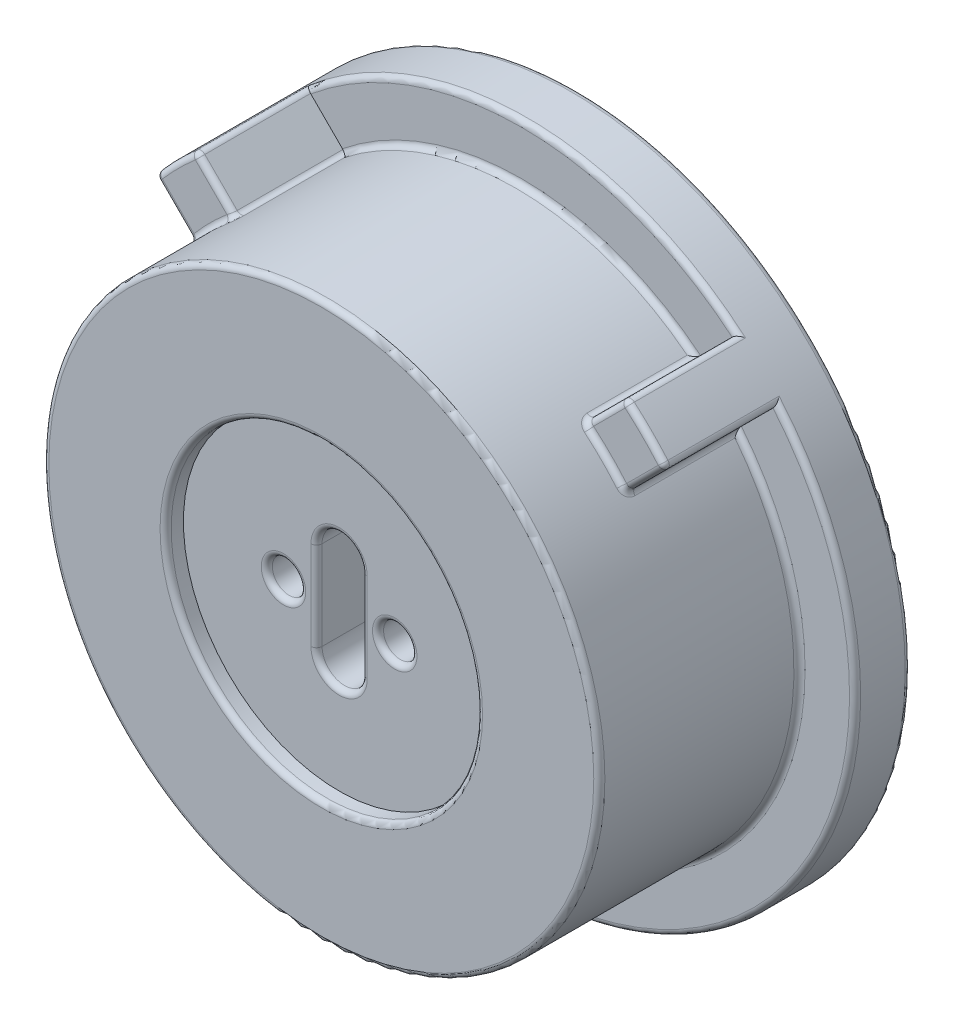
ISO-10303-21;
HEADER;
FILE_DESCRIPTION(('STEP AP214'),'2;1');
FILE_NAME('part.step','',(''),(''),'','','');
FILE_SCHEMA(('AUTOMOTIVE_DESIGN { 1 0 10303 214 1 1 1 1 }'));
ENDSEC;
DATA;
#1=APPLICATION_CONTEXT('core data for automotive mechanical design processes');
#2=APPLICATION_PROTOCOL_DEFINITION('international standard','automotive_design',2000,#1);
#3=PRODUCT_CONTEXT('',#1,'mechanical');
#4=PRODUCT('Part','Part','',(#3));
#5=PRODUCT_RELATED_PRODUCT_CATEGORY('part','',(#4));
#6=PRODUCT_DEFINITION_FORMATION('','',#4);
#7=PRODUCT_DEFINITION_CONTEXT('part definition',#1,'design');
#8=PRODUCT_DEFINITION('design','',#6,#7);
#9=PRODUCT_DEFINITION_SHAPE('','',#8);
#10=(LENGTH_UNIT() NAMED_UNIT(*) SI_UNIT(.MILLI.,.METRE.));
#11=(NAMED_UNIT(*) PLANE_ANGLE_UNIT() SI_UNIT($,.RADIAN.));
#12=(NAMED_UNIT(*) SI_UNIT($,.STERADIAN.) SOLID_ANGLE_UNIT());
#13=UNCERTAINTY_MEASURE_WITH_UNIT(LENGTH_MEASURE(1.E-05),#10,'distance_accuracy_value','');
#14=(GEOMETRIC_REPRESENTATION_CONTEXT(3) GLOBAL_UNCERTAINTY_ASSIGNED_CONTEXT((#13)) GLOBAL_UNIT_ASSIGNED_CONTEXT((#10,
#11,#12)) REPRESENTATION_CONTEXT('',''));
#15=CARTESIAN_POINT('',(0.,0.,0.));
#16=DIRECTION('',(0.,0.,1.));
#17=DIRECTION('',(1.,0.,0.));
#18=AXIS2_PLACEMENT_3D('',#15,#16,#17);
#19=CARTESIAN_POINT('',(1.2379132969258,0.,15.));
#20=DIRECTION('',(0.,0.,1.));
#21=DIRECTION('',(1.,0.,0.));
#22=AXIS2_PLACEMENT_3D('',#19,#20,#21);
#23=PLANE('',#22);
#24=CARTESIAN_POINT('',(0.,0.,15.));
#25=DIRECTION('',(0.,0.,1.));
#26=DIRECTION('',(1.,0.,0.));
#27=AXIS2_PLACEMENT_3D('',#24,#25,#26);
#28=CIRCLE('',#27,29.5);
#29=CARTESIAN_POINT('',(22.2916539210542,19.3218054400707,15.));
#30=VERTEX_POINT('',#29);
#31=CARTESIAN_POINT('',(19.3218054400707,22.2916539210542,15.));
#32=VERTEX_POINT('',#31);
#33=EDGE_CURVE('E945',#30,#32,#28,.T.);
#34=ORIENTED_EDGE('',*,*,#33,.T.);
#35=DIRECTION('',(-0.707106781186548,-0.707106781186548,0.));
#36=VECTOR('',#35,1.);
#37=CARTESIAN_POINT('',(16.4125616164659,19.3824100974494,15.));
#38=LINE('',#37,#36);
#39=CARTESIAN_POINT('',(16.4850507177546,19.4548991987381,15.));
#40=VERTEX_POINT('',#39);
#41=EDGE_CURVE('E942',#32,#40,#38,.T.);
#42=ORIENTED_EDGE('',*,*,#41,.T.);
#43=CARTESIAN_POINT('',(0.,0.,15.));
#44=DIRECTION('',(0.,0.,1.));
#45=DIRECTION('',(1.,0.,0.));
#46=AXIS2_PLACEMENT_3D('',#43,#44,#45);
#47=CIRCLE('',#46,25.5);
#48=CARTESIAN_POINT('',(19.4548991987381,16.4850507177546,15.));
#49=VERTEX_POINT('',#48);
#50=EDGE_CURVE('E949',#40,#49,#47,.F.);
#51=ORIENTED_EDGE('',*,*,#50,.T.);
#52=DIRECTION('',(0.707106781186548,0.707106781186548,0.));
#53=VECTOR('',#52,1.);
#54=CARTESIAN_POINT('',(22.2916539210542,19.3218054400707,15.));
#55=LINE('',#54,#53);
#56=EDGE_CURVE('E947',#49,#30,#55,.T.);
#57=ORIENTED_EDGE('',*,*,#56,.T.);
#58=EDGE_LOOP('',(#34,#42,#51,#57));
#59=FACE_BOUND('',#58,.T.);
#60=ADVANCED_FACE('F36',(#59),#23,.T.);
#61=CARTESIAN_POINT('',(0.,0.,0.));
#62=DIRECTION('',(0.,0.,1.));
#63=DIRECTION('',(1.,0.,0.));
#64=AXIS2_PLACEMENT_3D('',#61,#62,#63);
#65=PLANE('',#64);
#66=CARTESIAN_POINT('',(0.,0.,0.));
#67=DIRECTION('',(0.,0.,1.));
#68=DIRECTION('',(1.,0.,0.));
#69=AXIS2_PLACEMENT_3D('',#66,#67,#68);
#70=CIRCLE('',#69,21.5271067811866);
#71=CARTESIAN_POINT('',(21.5271067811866,0.,0.));
#72=VERTEX_POINT('',#71);
#73=EDGE_CURVE('E1575',#72,#72,#70,.T.);
#74=ORIENTED_EDGE('',*,*,#73,.T.);
#75=EDGE_LOOP('',(#74));
#76=FACE_BOUND('',#75,.T.);
#77=CARTESIAN_POINT('',(0.,0.,0.));
#78=DIRECTION('',(0.,0.,1.));
#79=DIRECTION('',(1.,0.,0.));
#80=AXIS2_PLACEMENT_3D('',#77,#78,#79);
#81=CIRCLE('',#80,29.5);
#82=CARTESIAN_POINT('',(29.5,0.,0.));
#83=VERTEX_POINT('',#82);
#84=EDGE_CURVE('E1577',#83,#83,#81,.F.);
#85=ORIENTED_EDGE('',*,*,#84,.T.);
#86=EDGE_LOOP('',(#85));
#87=FACE_BOUND('',#86,.T.);
#88=ADVANCED_FACE('F633',(#76,#87),#65,.F.);
#89=CARTESIAN_POINT('',(0.,0.,65.));
#90=DIRECTION('',(0.,0.,-1.));
#91=DIRECTION('',(-1.,0.,0.));
#92=AXIS2_PLACEMENT_3D('',#89,#90,#91);
#93=CYLINDRICAL_SURFACE('',#92,25.);
#94=CARTESIAN_POINT('',(0.,0.,22.5));
#95=DIRECTION('',(0.,0.,1.));
#96=DIRECTION('',(1.,0.,0.));
#97=AXIS2_PLACEMENT_3D('',#94,#95,#96);
#98=CIRCLE('',#97,25.);
#99=CARTESIAN_POINT('',(25.,0.,22.5));
#100=VERTEX_POINT('',#99);
#101=EDGE_CURVE('E692',#100,#100,#98,.F.);
#102=ORIENTED_EDGE('',*,*,#101,.T.);
#103=EDGE_LOOP('',(#102));
#104=FACE_BOUND('',#103,.T.);
#105=CARTESIAN_POINT('',(0.,0.,15.5));
#106=DIRECTION('',(0.,0.,1.));
#107=DIRECTION('',(1.,0.,0.));
#108=AXIS2_PLACEMENT_3D('',#105,#106,#107);
#109=CIRCLE('',#108,25.);
#110=CARTESIAN_POINT('',(19.0734305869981,16.1618144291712,15.5));
#111=VERTEX_POINT('',#110);
#112=CARTESIAN_POINT('',(16.1618144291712,19.0734305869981,15.5));
#113=VERTEX_POINT('',#112);
#114=EDGE_CURVE('E955',#111,#113,#109,.T.);
#115=ORIENTED_EDGE('',*,*,#114,.T.);
#116=CARTESIAN_POINT('',(16.4100389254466,18.860292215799,15.4430124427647));
#117=CARTESIAN_POINT('',(16.2818668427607,18.9718126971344,14.9603759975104));
#118=CARTESIAN_POINT('',(16.6205921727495,19.355145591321,14.9715062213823));
#119=CARTESIAN_POINT('',(16.3704774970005,18.8947236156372,15.4618950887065));
#120=CARTESIAN_POINT('',(16.2630728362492,18.9876914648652,14.9710322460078));
#121=CARTESIAN_POINT('',(16.5991076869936,19.371397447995,14.980947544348));
#122=CARTESIAN_POINT('',(16.3296059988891,18.9300573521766,15.4761443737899));
#123=CARTESIAN_POINT('',(16.2435227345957,19.0042302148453,14.9797867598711));
#124=CARTESIAN_POINT('',(16.5768510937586,19.3880055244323,14.9880721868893));
#125=CARTESIAN_POINT('',(16.2464675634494,19.001452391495,15.4951909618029));
#126=CARTESIAN_POINT('',(16.2033653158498,19.0382266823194,14.9930982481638));
#127=CARTESIAN_POINT('',(16.531455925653,19.4214224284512,14.9975954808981));
#128=CARTESIAN_POINT('',(16.2042018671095,19.0375130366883,15.4999964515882));
#129=CARTESIAN_POINT('',(16.1827795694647,19.0556660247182,14.9976696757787));
#130=CARTESIAN_POINT('',(16.508318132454,19.4382310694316,14.9999982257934));
#131=CARTESIAN_POINT('',(16.1194351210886,19.1093412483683,15.5000035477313));
#132=CARTESIAN_POINT('',(16.1409505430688,19.0911093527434,15.0023190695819));
#133=CARTESIAN_POINT('',(16.4617877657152,19.4715641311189,15.0000017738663));
#134=CARTESIAN_POINT('',(16.0769341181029,19.1451088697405,15.4952069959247));
#135=CARTESIAN_POINT('',(16.1197255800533,19.1090977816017,15.0024169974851));
#136=CARTESIAN_POINT('',(16.4383952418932,19.4880886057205,14.9976034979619));
#137=CARTESIAN_POINT('',(15.9929155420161,19.2153491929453,15.4761801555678));
#138=CARTESIAN_POINT('',(16.0771311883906,19.1451794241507,14.9978500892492));
#139=CARTESIAN_POINT('',(16.3920323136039,19.52039771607,14.9880900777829));
#140=CARTESIAN_POINT('',(15.9513978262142,19.249822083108,15.4619512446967));
#141=CARTESIAN_POINT('',(16.0557737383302,19.1632625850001,14.9932119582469));
#142=CARTESIAN_POINT('',(16.3690618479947,19.5361824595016,14.9809756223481));
#143=CARTESIAN_POINT('',(15.8705697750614,19.3165152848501,15.4244774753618));
#144=CARTESIAN_POINT('',(16.013533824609,19.198986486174,14.979008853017));
#145=CARTESIAN_POINT('',(16.3242351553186,19.5665916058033,14.9622387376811));
#146=CARTESIAN_POINT('',(15.8312580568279,19.3487370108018,15.401238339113));
#147=CARTESIAN_POINT('',(15.9926542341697,19.2166250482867,14.9694763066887));
#148=CARTESIAN_POINT('',(16.3023782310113,19.581216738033,14.9506191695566));
#149=CARTESIAN_POINT('',(15.7559214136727,19.4101341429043,15.3463594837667));
#150=CARTESIAN_POINT('',(15.9520287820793,19.250889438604,14.9454613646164));
#151=CARTESIAN_POINT('',(16.260401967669,19.6089747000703,14.9231797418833));
#152=CARTESIAN_POINT('',(15.7199010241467,19.4393053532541,15.3147084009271));
#153=CARTESIAN_POINT('',(15.932277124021,19.2675203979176,14.9309996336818));
#154=CARTESIAN_POINT('',(16.2402850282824,19.622105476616,14.9073542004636));
#155=CARTESIAN_POINT('',(15.6523128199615,19.4937679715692,15.2439240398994));
#156=CARTESIAN_POINT('',(15.8947099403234,19.2990937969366,14.8973458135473));
#157=CARTESIAN_POINT('',(16.2024680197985,19.6465343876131,14.8719620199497));
#158=CARTESIAN_POINT('',(15.6207426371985,19.5190614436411,15.2047947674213));
#159=CARTESIAN_POINT('',(15.8768764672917,19.3140516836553,14.87817594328));
#160=CARTESIAN_POINT('',(16.184766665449,19.6578334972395,14.8523973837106));
#161=CARTESIAN_POINT('',(15.5630082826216,19.56512562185,15.1201405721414));
#162=CARTESIAN_POINT('',(15.843900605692,19.3416599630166,14.8355588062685));
#163=CARTESIAN_POINT('',(16.1523462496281,19.6783503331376,14.8100702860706));
#164=CARTESIAN_POINT('',(15.5368438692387,19.5858965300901,15.0746159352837));
#165=CARTESIAN_POINT('',(15.8287341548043,19.3543307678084,14.8121184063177));
#166=CARTESIAN_POINT('',(16.1376270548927,19.6875681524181,14.7873079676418));
#167=CARTESIAN_POINT('',(15.4908287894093,19.6223108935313,14.9786237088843));
#168=CARTESIAN_POINT('',(15.8018456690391,19.3767597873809,14.7617575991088));
#169=CARTESIAN_POINT('',(16.1117111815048,19.7036912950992,14.7393118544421));
#170=CARTESIAN_POINT('',(15.4709566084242,19.6379718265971,14.9281737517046));
#171=CARTESIAN_POINT('',(15.790086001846,19.3865496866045,14.7348406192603));
#172=CARTESIAN_POINT('',(16.100502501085,19.7106045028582,14.7140868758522));
#173=CARTESIAN_POINT('',(15.4380671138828,19.6638379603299,14.823706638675));
#174=CARTESIAN_POINT('',(15.7705311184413,19.4028112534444,14.6784338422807));
#175=CARTESIAN_POINT('',(16.0819379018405,19.7220052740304,14.6618533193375));
#176=CARTESIAN_POINT('',(15.4250401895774,19.6740508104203,14.7696946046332));
#177=CARTESIAN_POINT('',(15.7627075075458,19.4093066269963,14.6489230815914));
#178=CARTESIAN_POINT('',(16.074576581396,19.7264962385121,14.6348473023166));
#179=CARTESIAN_POINT('',(15.4062840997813,19.688741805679,14.6599229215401));
#180=CARTESIAN_POINT('',(15.7514287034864,19.4186658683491,14.5885814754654));
#181=CARTESIAN_POINT('',(16.0639743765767,19.7329520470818,14.5799614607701));
#182=CARTESIAN_POINT('',(15.4005115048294,19.693254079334,14.6041757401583));
#183=CARTESIAN_POINT('',(15.7479329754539,19.4215634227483,14.5577236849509));
#184=CARTESIAN_POINT('',(16.0607089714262,19.7349319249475,14.5520878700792));
#185=CARTESIAN_POINT('',(15.3963061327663,19.6965418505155,14.4922060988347));
#186=CARTESIAN_POINT('',(15.7453907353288,19.4236708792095,14.4956955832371));
#187=CARTESIAN_POINT('',(16.058330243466,19.7363747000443,14.4961030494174));
#188=CARTESIAN_POINT('',(15.3978748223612,19.6953162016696,14.435983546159));
#189=CARTESIAN_POINT('',(15.7463416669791,19.4228829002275,14.4644833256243));
#190=CARTESIAN_POINT('',(16.0592177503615,19.7358370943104,14.4679917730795));
#191=CARTESIAN_POINT('',(15.4082927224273,19.6871677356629,14.3249373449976));
#192=CARTESIAN_POINT('',(15.7526317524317,19.4176672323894,14.4031001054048));
#193=CARTESIAN_POINT('',(16.06510958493,19.7322600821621,14.4124686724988));
#194=CARTESIAN_POINT('',(15.4171097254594,19.6802701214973,14.2701086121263));
#195=CARTESIAN_POINT('',(15.7579598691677,19.4132486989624,14.3728850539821));
#196=CARTESIAN_POINT('',(16.0700957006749,19.7292317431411,14.3850543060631));
#197=CARTESIAN_POINT('',(15.441659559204,19.6610104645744,14.1630862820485));
#198=CARTESIAN_POINT('',(15.7726544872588,19.4010449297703,14.3144076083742));
#199=CARTESIAN_POINT('',(16.0839651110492,19.7207583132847,14.3315431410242));
#200=CARTESIAN_POINT('',(15.4573971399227,19.6486446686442,14.1108945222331));
#201=CARTESIAN_POINT('',(15.7820417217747,19.3932424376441,14.2861154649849));
#202=CARTESIAN_POINT('',(16.0928510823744,19.7153115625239,14.3054472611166));
#203=CARTESIAN_POINT('',(15.4764269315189,19.6336499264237,14.0608066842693));
#204=CARTESIAN_POINT('',(15.7932826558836,19.3838851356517,14.259422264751));
#205=CARTESIAN_POINT('',(16.1035852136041,19.7086931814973,14.2804033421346));
#206=(BOUNDED_SURFACE() B_SPLINE_SURFACE(3,2,((#116,#117,#118),(#119,#120,#121),(#122,#123,
#124),(#125,#126,#127),(#128,#129,#130),(#131,#132,#133),(#134,#135,#136),(#137,#138,#139),
(#140,#141,#142),(#143,#144,#145),(#146,#147,#148),(#149,#150,#151),(#152,#153,#154),(#155,#156,
#157),(#158,#159,#160),(#161,#162,#163),(#164,#165,#166),(#167,#168,#169),(#170,#171,#172),
(#173,#174,#175),(#176,#177,#178),(#179,#180,#181),(#182,#183,#184),(#185,#186,#187),(#188,#189,
#190),(#191,#192,#193),(#194,#195,#196),(#197,#198,#199),(#200,#201,#202),(#203,#204,#205)),
.UNSPECIFIED.,.F.,.F.,.F.) B_SPLINE_SURFACE_WITH_KNOTS((4,2,2,2,2,2,2,2,2,2,2,2,2,2,4),(3,3),
(0.,0.169956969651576,0.339766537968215,0.509543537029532,0.679295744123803,0.848940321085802,
1.01881524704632,1.18859943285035,1.35837602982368,1.52756569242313,1.69651717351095,
1.86445229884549,2.03242097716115,2.19964730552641,2.36698859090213),(0.,1.),
.UNSPECIFIED.) GEOMETRIC_REPRESENTATION_ITEM() RATIONAL_B_SPLINE_SURFACE(((1.,0.698905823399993,
1.),(1.,0.699974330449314,1.),(1.,0.701202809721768,1.),(1.,0.703947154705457,1.),(1.,
0.705462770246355,1.),(1.,0.708750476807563,1.),(1.,0.710522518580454,1.),(1.,0.714254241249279,
1.),(1.,0.716213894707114,1.),(1.,0.720228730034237,1.),(1.,0.722283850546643,1.),(1.,
0.726385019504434,1.),(1.,0.728431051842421,1.),(1.,0.732393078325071,1.),(1.,0.734309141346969,
1.),(1.,0.737896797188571,1.),(1.,0.739568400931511,1.),(1.,0.742557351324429,1.),(1.,
0.743875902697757,1.),(1.,0.746080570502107,1.),(1.,0.746967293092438,1.),(1.,0.748249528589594,
1.),(1.,0.74864796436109,1.),(1.,0.74893800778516,1.),(1.,0.748829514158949,1.),(1.,
0.748112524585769,1.),(1.,0.747506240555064,1.),(1.,0.7458407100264,1.),(1.,0.744781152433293,
1.),(1.,0.743517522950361,1.))) REPRESENTATION_ITEM('') SURFACE());
#207=CARTESIAN_POINT('',(15.4764269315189,19.6336499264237,14.0608066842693));
#208=CARTESIAN_POINT('',(15.4573971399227,19.6486446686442,14.1108945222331));
#209=CARTESIAN_POINT('',(15.441659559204,19.6610104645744,14.1630862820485));
#210=CARTESIAN_POINT('',(15.4171097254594,19.6802701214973,14.2701086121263));
#211=CARTESIAN_POINT('',(15.4082927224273,19.6871677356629,14.3249373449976));
#212=CARTESIAN_POINT('',(15.3978748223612,19.6953162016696,14.435983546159));
#213=CARTESIAN_POINT('',(15.3963061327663,19.6965418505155,14.4922060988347));
#214=CARTESIAN_POINT('',(15.4005115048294,19.693254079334,14.6041757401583));
#215=CARTESIAN_POINT('',(15.4062840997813,19.688741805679,14.6599229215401));
#216=CARTESIAN_POINT('',(15.4250401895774,19.6740508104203,14.7696946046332));
#217=CARTESIAN_POINT('',(15.4380671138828,19.6638379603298,14.823706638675));
#218=CARTESIAN_POINT('',(15.4709566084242,19.6379718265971,14.9281737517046));
#219=CARTESIAN_POINT('',(15.4908287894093,19.6223108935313,14.9786237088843));
#220=CARTESIAN_POINT('',(15.5368438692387,19.5858965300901,15.0746159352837));
#221=CARTESIAN_POINT('',(15.5630082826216,19.56512562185,15.1201405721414));
#222=CARTESIAN_POINT('',(15.6207426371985,19.5190614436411,15.2047947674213));
#223=CARTESIAN_POINT('',(15.6523128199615,19.4937679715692,15.2439240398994));
#224=CARTESIAN_POINT('',(15.7199010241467,19.4393053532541,15.3147084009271));
#225=CARTESIAN_POINT('',(15.7559214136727,19.4101341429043,15.3463594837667));
#226=CARTESIAN_POINT('',(15.8312580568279,19.3487370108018,15.401238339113));
#227=CARTESIAN_POINT('',(15.8705697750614,19.3165152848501,15.4244774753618));
#228=CARTESIAN_POINT('',(15.9513978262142,19.249822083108,15.4619512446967));
#229=CARTESIAN_POINT('',(15.9929155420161,19.2153491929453,15.4761801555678));
#230=CARTESIAN_POINT('',(16.0769341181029,19.1451088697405,15.4952069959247));
#231=CARTESIAN_POINT('',(16.1194351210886,19.1093412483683,15.5000035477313));
#232=CARTESIAN_POINT('',(16.2042018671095,19.0375130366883,15.4999964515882));
#233=CARTESIAN_POINT('',(16.2464675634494,19.001452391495,15.4951909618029));
#234=CARTESIAN_POINT('',(16.3296059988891,18.9300573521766,15.4761443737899));
#235=CARTESIAN_POINT('',(16.3704774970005,18.8947236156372,15.4618950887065));
#236=CARTESIAN_POINT('',(16.4100389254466,18.860292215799,15.4430124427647));
#237=B_SPLINE_CURVE_WITH_KNOTS('',3,(#207,#208,#209,#210,#211,#212,#213,#214,#215,#216,#217,
#218,#219,#220,#221,#222,#223,#224,#225,#226,#227,#228,#229,#230,#231,#232,#233,#234,#235,#236),
.UNSPECIFIED.,.F.,.F.,(4,2,2,2,2,2,2,2,2,2,2,2,2,2,4),(0.,0.167341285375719,0.334567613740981,
0.502536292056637,0.67047141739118,0.839422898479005,1.00861256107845,1.17838915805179,
1.34817334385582,1.51804826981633,1.68769284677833,1.8574450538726,2.02722205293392,
2.19703162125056,2.36698859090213),.UNSPECIFIED.);
#238=CARTESIAN_POINT('',(15.39750474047,19.6956047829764,14.5));
#239=VERTEX_POINT('',#238);
#240=EDGE_CURVE('E787',#113,#239,#237,.F.);
#241=ORIENTED_EDGE('',*,*,#240,.T.);
#242=DIRECTION('',(0.,0.,-1.));
#243=VECTOR('',#242,1.);
#244=CARTESIAN_POINT('',(15.39750474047,19.6956047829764,65.));
#245=LINE('',#244,#243);
#246=CARTESIAN_POINT('',(15.39750474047,19.6956047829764,5.5));
#247=VERTEX_POINT('',#246);
#248=EDGE_CURVE('E302',#239,#247,#245,.T.);
#249=ORIENTED_EDGE('',*,*,#248,.T.);
#250=CARTESIAN_POINT('',(0.,0.,5.5));
#251=DIRECTION('',(0.,0.,-1.));
#252=DIRECTION('',(-1.,0.,0.));
#253=AXIS2_PLACEMENT_3D('',#250,#251,#252);
#254=CIRCLE('',#253,25.);
#255=CARTESIAN_POINT('',(-15.39750474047,19.6956047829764,5.5));
#256=VERTEX_POINT('',#255);
#257=EDGE_CURVE('E299',#247,#256,#254,.F.);
#258=ORIENTED_EDGE('',*,*,#257,.T.);
#259=DIRECTION('',(0.,0.,-1.));
#260=VECTOR('',#259,1.);
#261=CARTESIAN_POINT('',(-15.39750474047,19.6956047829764,65.));
#262=LINE('',#261,#260);
#263=CARTESIAN_POINT('',(-15.39750474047,19.6956047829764,14.5));
#264=VERTEX_POINT('',#263);
#265=EDGE_CURVE('E301',#256,#264,#262,.F.);
#266=ORIENTED_EDGE('',*,*,#265,.T.);
#267=CARTESIAN_POINT('',(-15.4406543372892,19.6617952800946,14.1714694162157));
#268=CARTESIAN_POINT('',(-15.7720379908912,19.4015555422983,14.319088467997));
#269=CARTESIAN_POINT('',(-16.0833962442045,19.721102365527,14.3357347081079));
#270=CARTESIAN_POINT('',(-15.4263803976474,19.672998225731,14.2241472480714));
#271=CARTESIAN_POINT('',(-15.7635053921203,19.4086436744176,14.3476634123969));
#272=CARTESIAN_POINT('',(-16.0753334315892,19.7260327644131,14.3620736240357));
#273=CARTESIAN_POINT('',(-15.4155916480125,19.6814518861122,14.2783987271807));
#274=CARTESIAN_POINT('',(-15.7570222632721,19.41402444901,14.3774618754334));
#275=CARTESIAN_POINT('',(-16.069235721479,19.7297486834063,14.3891993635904));
#276=CARTESIAN_POINT('',(-15.4011580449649,19.6927520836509,14.3884337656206));
#277=CARTESIAN_POINT('',(-15.7483360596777,19.4212304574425,14.4381550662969));
#278=CARTESIAN_POINT('',(-16.0610755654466,19.7347127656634,14.4442168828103));
#279=CARTESIAN_POINT('',(-15.3975076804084,19.6956029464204,14.4442161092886));
#280=CARTESIAN_POINT('',(-15.7461184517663,19.4230677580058,14.4690865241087));
#281=CARTESIAN_POINT('',(-16.0590100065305,19.7359628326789,14.4721080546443));
#282=CARTESIAN_POINT('',(-15.3975017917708,19.6956066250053,14.5559501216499));
#283=CARTESIAN_POINT('',(-15.7461117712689,19.4230730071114,14.5310055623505));
#284=CARTESIAN_POINT('',(-16.0590064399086,19.7359641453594,14.5279750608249));
#285=CARTESIAN_POINT('',(-15.4011680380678,19.6927424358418,14.611901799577));
#286=CARTESIAN_POINT('',(-15.7483359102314,19.4212300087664,14.5620350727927));
#287=CARTESIAN_POINT('',(-16.0610807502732,19.734707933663,14.5559508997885));
#288=CARTESIAN_POINT('',(-15.4157043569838,19.6813655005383,14.7221981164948));
#289=CARTESIAN_POINT('',(-15.7570964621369,19.4139634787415,14.6228626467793));
#290=CARTESIAN_POINT('',(-16.0692999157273,19.7297113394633,14.6110990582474));
#291=CARTESIAN_POINT('',(-15.426573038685,19.6728538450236,14.7765430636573));
#292=CARTESIAN_POINT('',(-15.7636435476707,19.4085310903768,14.652699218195));
#293=CARTESIAN_POINT('',(-16.0754439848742,19.7259714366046,14.6382715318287));
#294=CARTESIAN_POINT('',(-15.4551522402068,19.6504095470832,14.8820583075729));
#295=CARTESIAN_POINT('',(-15.7807031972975,19.3943550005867,14.7100349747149));
#296=CARTESIAN_POINT('',(-16.0915837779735,19.7160892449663,14.6910291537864));
#297=CARTESIAN_POINT('',(-15.4728574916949,19.636481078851,14.9332310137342));
#298=CARTESIAN_POINT('',(-15.7912331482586,19.3855968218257,14.7375640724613));
#299=CARTESIAN_POINT('',(-16.1015765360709,19.7099488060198,14.716615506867));
#300=CARTESIAN_POINT('',(-15.5145742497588,19.6035377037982,15.0310833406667));
#301=CARTESIAN_POINT('',(-15.8157537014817,19.3651638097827,14.7894148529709));
#302=CARTESIAN_POINT('',(-16.1250892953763,19.6953848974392,14.7655416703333));
#303=CARTESIAN_POINT('',(-15.5385943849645,19.5845158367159,15.077756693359));
#304=CARTESIAN_POINT('',(-15.8297739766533,19.3534640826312,14.8137457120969));
#305=CARTESIAN_POINT('',(-16.1386141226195,19.6869583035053,14.7888783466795));
#306=CARTESIAN_POINT('',(-15.5922662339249,19.5418118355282,15.1653773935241));
#307=CARTESIAN_POINT('',(-15.8606672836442,19.3276304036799,14.8585006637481));
#308=CARTESIAN_POINT('',(-16.1687835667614,19.66797606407,14.832688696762));
#309=CARTESIAN_POINT('',(-15.6219355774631,19.5181151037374,15.206306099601));
#310=CARTESIAN_POINT('',(-15.8775735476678,19.3134682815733,14.8789100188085));
#311=CARTESIAN_POINT('',(-16.1854379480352,19.6574137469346,14.8531530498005));
#312=CARTESIAN_POINT('',(-15.685949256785,19.4667069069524,15.2811338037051));
#313=CARTESIAN_POINT('',(-15.9134841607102,19.2833244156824,14.9152294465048));
#314=CARTESIAN_POINT('',(-16.2212993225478,19.6344099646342,14.8905669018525));
#315=CARTESIAN_POINT('',(-15.7202938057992,19.438995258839,15.3150324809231));
#316=CARTESIAN_POINT('',(-15.9325077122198,19.2673262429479,14.9311238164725));
#317=CARTESIAN_POINT('',(-16.2405064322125,19.6219684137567,14.9075162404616));
#318=CARTESIAN_POINT('',(-15.7928874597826,19.3800645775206,15.3750786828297));
#319=CARTESIAN_POINT('',(-15.9720612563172,19.2340029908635,14.9582473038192));
#320=CARTESIAN_POINT('',(-16.2810132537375,19.5953978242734,14.9375393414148));
#321=CARTESIAN_POINT('',(-15.8311622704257,19.3488222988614,15.4011701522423));
#322=CARTESIAN_POINT('',(-15.9926106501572,19.2166608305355,14.969417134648));
#323=CARTESIAN_POINT('',(-16.3023267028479,19.5812575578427,14.9505850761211));
#324=CARTESIAN_POINT('',(-15.9102265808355,19.2838611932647,15.444521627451));
#325=CARTESIAN_POINT('',(-16.0343658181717,19.1813753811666,14.9868661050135));
#326=CARTESIAN_POINT('',(-16.3462458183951,19.5517237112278,14.9722608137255));
#327=CARTESIAN_POINT('',(-15.9510126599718,19.2501457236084,15.4617933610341));
#328=CARTESIAN_POINT('',(-16.0555711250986,19.1634322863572,14.9931227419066));
#329=CARTESIAN_POINT('',(-16.3688497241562,19.536331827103,14.9808966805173));
#330=CARTESIAN_POINT('',(-16.0341114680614,19.1809853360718,15.4871143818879));
#331=CARTESIAN_POINT('',(-16.0981230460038,19.1274011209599,15.000902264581));
#332=CARTESIAN_POINT('',(-16.4147844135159,19.5046143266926,14.9935571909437));
#333=CARTESIAN_POINT('',(-16.0764291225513,19.145534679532,15.4951305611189));
#334=CARTESIAN_POINT('',(-16.1194602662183,19.1093207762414,15.0023805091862));
#335=CARTESIAN_POINT('',(-16.4381175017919,19.4882855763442,14.9975652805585));
#336=CARTESIAN_POINT('',(-16.1612413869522,19.0739969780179,15.5015942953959));
#337=CARTESIAN_POINT('',(-16.1616738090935,19.0735495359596,15.0007862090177));
#338=CARTESIAN_POINT('',(-16.4847567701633,19.4551863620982,15.0007971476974));
#339=CARTESIAN_POINT('',(-16.2037360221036,19.0379098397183,15.5000404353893));
#340=CARTESIAN_POINT('',(-16.1825336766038,19.0558725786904,14.997691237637));
#341=CARTESIAN_POINT('',(-16.5080629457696,19.4384158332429,15.0000202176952));
#342=CARTESIAN_POINT('',(-16.2876042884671,18.9662057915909,15.4873853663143));
#343=CARTESIAN_POINT('',(-16.223305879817,19.0213419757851,14.9872498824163));
#344=CARTESIAN_POINT('',(-16.5539376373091,19.404948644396,14.9936926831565));
#345=CARTESIAN_POINT('',(-16.3289798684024,18.9305881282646,15.4763020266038));
#346=CARTESIAN_POINT('',(-16.2431997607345,19.0045040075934,14.9798979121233));
#347=CARTESIAN_POINT('',(-16.5765074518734,19.3882519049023,14.988151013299));
#348=CARTESIAN_POINT('',(-16.4095844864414,18.8607654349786,15.4449523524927));
#349=CARTESIAN_POINT('',(-16.2817237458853,18.9719274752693,14.9612396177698));
#350=CARTESIAN_POINT('',(-16.6203651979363,19.355391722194,14.9724761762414));
#351=CARTESIAN_POINT('',(-16.448811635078,18.8265616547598,15.4246780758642));
#352=CARTESIAN_POINT('',(-16.3003320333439,18.9562074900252,14.9499245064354));
#353=CARTESIAN_POINT('',(-16.6416520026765,19.3392287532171,14.9623390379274));
#354=CARTESIAN_POINT('',(-16.4863732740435,18.7936025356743,15.3999886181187));
#355=CARTESIAN_POINT('',(-16.3180876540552,18.941228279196,14.9368185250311));
#356=CARTESIAN_POINT('',(-16.6619820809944,19.3235932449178,14.9499943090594));
#357=(BOUNDED_SURFACE() B_SPLINE_SURFACE(3,2,((#267,#268,#269),(#270,#271,#272),(#273,#274,
#275),(#276,#277,#278),(#279,#280,#281),(#282,#283,#284),(#285,#286,#287),(#288,#289,#290),
(#291,#292,#293),(#294,#295,#296),(#297,#298,#299),(#300,#301,#302),(#303,#304,#305),(#306,#307,
#308),(#309,#310,#311),(#312,#313,#314),(#315,#316,#317),(#318,#319,#320),(#321,#322,#323),
(#324,#325,#326),(#327,#328,#329),(#330,#331,#332),(#333,#334,#335),(#336,#337,#338),(#339,#340,
#341),(#342,#343,#344),(#345,#346,#347),(#348,#349,#350),(#351,#352,#353),(#354,#355,#356)),
.UNSPECIFIED.,.F.,.F.,.F.) B_SPLINE_SURFACE_WITH_KNOTS((4,2,2,2,2,2,2,2,2,2,2,2,2,2,4),(3,3),
(0.,0.167285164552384,0.334441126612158,0.502095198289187,0.669716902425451,0.837209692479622,
1.00493254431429,1.17318766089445,1.34145045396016,1.51089387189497,1.68011138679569,
1.84993235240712,2.01977842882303,2.18930670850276,2.35898176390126),(0.,1.),
.UNSPECIFIED.) GEOMETRIC_REPRESENTATION_ITEM() RATIONAL_B_SPLINE_SURFACE(((1.,0.745910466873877,
1.),(1.,0.746876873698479,1.),(1.,0.747613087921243,1.),(1.,0.748601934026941,1.),(1.,
0.748854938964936,1.),(1.,0.748855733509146,1.),(1.,0.748602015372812,1.),(1.,0.747604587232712,
1.),(1.,0.746860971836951,1.),(1.,0.744931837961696,1.),(1.,0.743746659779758,1.),(1.,
0.741007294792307,1.),(1.,0.739452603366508,1.),(1.,0.736065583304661,1.),(1.,0.734232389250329,
1.),(1.,0.730402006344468,1.),(1.,0.728404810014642,1.),(1.,0.724346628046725,1.),(1.,
0.722285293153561,1.),(1.,0.718226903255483,1.),(1.,0.716229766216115,1.),(1.,0.712387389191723,
1.),(1.,0.710542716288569,1.),(1.,0.707088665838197,1.),(1.,0.705479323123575,1.),(1.,
0.702548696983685,1.),(1.,0.701226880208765,1.),(1.,0.698877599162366,1.),(1.,0.697850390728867,
1.),(1.,0.696976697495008,1.))) REPRESENTATION_ITEM('') SURFACE());
#358=CARTESIAN_POINT('',(-16.4863732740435,18.7936025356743,15.3999886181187));
#359=CARTESIAN_POINT('',(-16.448811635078,18.8265616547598,15.4246780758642));
#360=CARTESIAN_POINT('',(-16.4095844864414,18.8607654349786,15.4449523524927));
#361=CARTESIAN_POINT('',(-16.3289798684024,18.9305881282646,15.4763020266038));
#362=CARTESIAN_POINT('',(-16.2876042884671,18.9662057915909,15.4873853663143));
#363=CARTESIAN_POINT('',(-16.2037360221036,19.0379098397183,15.5000404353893));
#364=CARTESIAN_POINT('',(-16.1612413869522,19.0739969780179,15.5015942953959));
#365=CARTESIAN_POINT('',(-16.0764291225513,19.145534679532,15.4951305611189));
#366=CARTESIAN_POINT('',(-16.0341114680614,19.1809853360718,15.4871143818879));
#367=CARTESIAN_POINT('',(-15.9510126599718,19.2501457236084,15.4617933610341));
#368=CARTESIAN_POINT('',(-15.9102265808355,19.2838611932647,15.444521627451));
#369=CARTESIAN_POINT('',(-15.8311622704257,19.3488222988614,15.4011701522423));
#370=CARTESIAN_POINT('',(-15.7928874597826,19.3800645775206,15.3750786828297));
#371=CARTESIAN_POINT('',(-15.7202938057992,19.438995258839,15.3150324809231));
#372=CARTESIAN_POINT('',(-15.685949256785,19.4667069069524,15.2811338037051));
#373=CARTESIAN_POINT('',(-15.6219355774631,19.5181151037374,15.206306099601));
#374=CARTESIAN_POINT('',(-15.5922662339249,19.5418118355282,15.1653773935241));
#375=CARTESIAN_POINT('',(-15.5385943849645,19.5845158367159,15.077756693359));
#376=CARTESIAN_POINT('',(-15.5145742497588,19.6035377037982,15.0310833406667));
#377=CARTESIAN_POINT('',(-15.4728574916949,19.636481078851,14.9332310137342));
#378=CARTESIAN_POINT('',(-15.4551522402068,19.6504095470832,14.8820583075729));
#379=CARTESIAN_POINT('',(-15.426573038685,19.6728538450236,14.7765430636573));
#380=CARTESIAN_POINT('',(-15.4157043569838,19.6813655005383,14.7221981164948));
#381=CARTESIAN_POINT('',(-15.4011680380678,19.6927424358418,14.611901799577));
#382=CARTESIAN_POINT('',(-15.3975017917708,19.6956066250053,14.5559501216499));
#383=CARTESIAN_POINT('',(-15.3975076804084,19.6956029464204,14.4442161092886));
#384=CARTESIAN_POINT('',(-15.4011580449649,19.6927520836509,14.3884337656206));
#385=CARTESIAN_POINT('',(-15.4155916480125,19.6814518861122,14.2783987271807));
#386=CARTESIAN_POINT('',(-15.4263803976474,19.672998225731,14.2241472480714));
#387=CARTESIAN_POINT('',(-15.4406543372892,19.6617952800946,14.1714694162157));
#388=B_SPLINE_CURVE_WITH_KNOTS('',3,(#358,#359,#360,#361,#362,#363,#364,#365,#366,#367,#368,
#369,#370,#371,#372,#373,#374,#375,#376,#377,#378,#379,#380,#381,#382,#383,#384,#385,#386,#387),
.UNSPECIFIED.,.F.,.F.,(4,2,2,2,2,2,2,2,2,2,2,2,2,2,4),(0.,0.169675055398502,0.339203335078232,
0.509049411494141,0.678870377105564,0.84808789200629,1.01753130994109,1.18579410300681,
1.35404921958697,1.52177207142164,1.68926486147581,1.85688656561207,2.0245406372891,
2.19169659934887,2.35898176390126),.UNSPECIFIED.);
#389=CARTESIAN_POINT('',(-16.1618144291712,19.0734305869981,15.5));
#390=VERTEX_POINT('',#389);
#391=EDGE_CURVE('E745',#264,#390,#388,.F.);
#392=ORIENTED_EDGE('',*,*,#391,.T.);
#393=CARTESIAN_POINT('',(0.,0.,15.5));
#394=DIRECTION('',(0.,0.,1.));
#395=DIRECTION('',(1.,0.,0.));
#396=AXIS2_PLACEMENT_3D('',#393,#394,#395);
#397=CIRCLE('',#396,25.);
#398=CARTESIAN_POINT('',(-19.0734305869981,16.1618144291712,15.5));
#399=VERTEX_POINT('',#398);
#400=EDGE_CURVE('E954',#390,#399,#397,.T.);
#401=ORIENTED_EDGE('',*,*,#400,.T.);
#402=CARTESIAN_POINT('',(-18.860292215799,16.4100389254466,15.4430124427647));
#403=CARTESIAN_POINT('',(-18.9718126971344,16.2818668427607,14.9603759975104));
#404=CARTESIAN_POINT('',(-19.355145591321,16.6205921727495,14.9715062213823));
#405=CARTESIAN_POINT('',(-18.8947236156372,16.3704774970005,15.4618950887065));
#406=CARTESIAN_POINT('',(-18.9876914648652,16.2630728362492,14.9710322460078));
#407=CARTESIAN_POINT('',(-19.371397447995,16.5991076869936,14.980947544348));
#408=CARTESIAN_POINT('',(-18.9300573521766,16.3296059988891,15.4761443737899));
#409=CARTESIAN_POINT('',(-19.0042302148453,16.2435227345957,14.9797867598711));
#410=CARTESIAN_POINT('',(-19.3880055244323,16.5768510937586,14.9880721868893));
#411=CARTESIAN_POINT('',(-19.001452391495,16.2464675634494,15.4951909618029));
#412=CARTESIAN_POINT('',(-19.0382266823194,16.2033653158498,14.9930982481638));
#413=CARTESIAN_POINT('',(-19.4214224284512,16.531455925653,14.9975954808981));
#414=CARTESIAN_POINT('',(-19.0375130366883,16.2042018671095,15.4999964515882));
#415=CARTESIAN_POINT('',(-19.0556660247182,16.1827795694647,14.9976696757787));
#416=CARTESIAN_POINT('',(-19.4382310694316,16.508318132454,14.9999982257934));
#417=CARTESIAN_POINT('',(-19.1093412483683,16.1194351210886,15.5000035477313));
#418=CARTESIAN_POINT('',(-19.0911093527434,16.1409505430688,15.0023190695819));
#419=CARTESIAN_POINT('',(-19.4715641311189,16.4617877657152,15.0000017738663));
#420=CARTESIAN_POINT('',(-19.1451088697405,16.0769341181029,15.4952069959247));
#421=CARTESIAN_POINT('',(-19.1090977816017,16.1197255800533,15.0024169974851));
#422=CARTESIAN_POINT('',(-19.4880886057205,16.4383952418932,14.9976034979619));
#423=CARTESIAN_POINT('',(-19.2153491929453,15.9929155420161,15.4761801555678));
#424=CARTESIAN_POINT('',(-19.1451794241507,16.0771311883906,14.9978500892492));
#425=CARTESIAN_POINT('',(-19.52039771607,16.3920323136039,14.9880900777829));
#426=CARTESIAN_POINT('',(-19.249822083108,15.9513978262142,15.4619512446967));
#427=CARTESIAN_POINT('',(-19.1632625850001,16.0557737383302,14.9932119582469));
#428=CARTESIAN_POINT('',(-19.5361824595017,16.3690618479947,14.9809756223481));
#429=CARTESIAN_POINT('',(-19.3165152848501,15.8705697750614,15.4244774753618));
#430=CARTESIAN_POINT('',(-19.1989864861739,16.013533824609,14.979008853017));
#431=CARTESIAN_POINT('',(-19.5665916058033,16.3242351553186,14.9622387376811));
#432=CARTESIAN_POINT('',(-19.3487370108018,15.8312580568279,15.401238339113));
#433=CARTESIAN_POINT('',(-19.2166250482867,15.9926542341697,14.9694763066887));
#434=CARTESIAN_POINT('',(-19.581216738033,16.3023782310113,14.9506191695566));
#435=CARTESIAN_POINT('',(-19.4101341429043,15.7559214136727,15.3463594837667));
#436=CARTESIAN_POINT('',(-19.250889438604,15.9520287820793,14.9454613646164));
#437=CARTESIAN_POINT('',(-19.6089747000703,16.260401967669,14.9231797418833));
#438=CARTESIAN_POINT('',(-19.4393053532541,15.7199010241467,15.3147084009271));
#439=CARTESIAN_POINT('',(-19.2675203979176,15.932277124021,14.9309996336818));
#440=CARTESIAN_POINT('',(-19.622105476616,16.2402850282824,14.9073542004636));
#441=CARTESIAN_POINT('',(-19.4937679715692,15.6523128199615,15.2439240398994));
#442=CARTESIAN_POINT('',(-19.2990937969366,15.8947099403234,14.8973458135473));
#443=CARTESIAN_POINT('',(-19.6465343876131,16.2024680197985,14.8719620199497));
#444=CARTESIAN_POINT('',(-19.5190614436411,15.6207426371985,15.2047947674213));
#445=CARTESIAN_POINT('',(-19.3140516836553,15.8768764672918,14.87817594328));
#446=CARTESIAN_POINT('',(-19.6578334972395,16.184766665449,14.8523973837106));
#447=CARTESIAN_POINT('',(-19.56512562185,15.5630082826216,15.1201405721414));
#448=CARTESIAN_POINT('',(-19.3416599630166,15.8439006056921,14.8355588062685));
#449=CARTESIAN_POINT('',(-19.6783503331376,16.1523462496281,14.8100702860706));
#450=CARTESIAN_POINT('',(-19.5858965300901,15.5368438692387,15.0746159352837));
#451=CARTESIAN_POINT('',(-19.3543307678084,15.8287341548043,14.8121184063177));
#452=CARTESIAN_POINT('',(-19.6875681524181,16.1376270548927,14.7873079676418));
#453=CARTESIAN_POINT('',(-19.6223108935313,15.4908287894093,14.9786237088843));
#454=CARTESIAN_POINT('',(-19.3767597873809,15.8018456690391,14.7617575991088));
#455=CARTESIAN_POINT('',(-19.7036912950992,16.1117111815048,14.7393118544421));
#456=CARTESIAN_POINT('',(-19.6379718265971,15.4709566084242,14.9281737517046));
#457=CARTESIAN_POINT('',(-19.3865496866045,15.790086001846,14.7348406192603));
#458=CARTESIAN_POINT('',(-19.7106045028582,16.100502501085,14.7140868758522));
#459=CARTESIAN_POINT('',(-19.6638379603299,15.4380671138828,14.823706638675));
#460=CARTESIAN_POINT('',(-19.4028112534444,15.7705311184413,14.6784338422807));
#461=CARTESIAN_POINT('',(-19.7220052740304,16.0819379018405,14.6618533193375));
#462=CARTESIAN_POINT('',(-19.6740508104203,15.4250401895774,14.7696946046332));
#463=CARTESIAN_POINT('',(-19.4093066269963,15.7627075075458,14.6489230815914));
#464=CARTESIAN_POINT('',(-19.7264962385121,16.074576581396,14.6348473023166));
#465=CARTESIAN_POINT('',(-19.688741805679,15.4062840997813,14.6599229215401));
#466=CARTESIAN_POINT('',(-19.4186658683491,15.7514287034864,14.5885814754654));
#467=CARTESIAN_POINT('',(-19.7329520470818,16.0639743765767,14.5799614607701));
#468=CARTESIAN_POINT('',(-19.693254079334,15.4005115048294,14.6041757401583));
#469=CARTESIAN_POINT('',(-19.4215634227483,15.7479329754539,14.5577236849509));
#470=CARTESIAN_POINT('',(-19.7349319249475,16.0607089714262,14.5520878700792));
#471=CARTESIAN_POINT('',(-19.6965418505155,15.3963061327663,14.4922060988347));
#472=CARTESIAN_POINT('',(-19.4236708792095,15.7453907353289,14.4956955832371));
#473=CARTESIAN_POINT('',(-19.7363747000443,16.058330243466,14.4961030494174));
#474=CARTESIAN_POINT('',(-19.6953162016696,15.3978748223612,14.435983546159));
#475=CARTESIAN_POINT('',(-19.4228829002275,15.7463416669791,14.4644833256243));
#476=CARTESIAN_POINT('',(-19.7358370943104,16.0592177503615,14.4679917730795));
#477=CARTESIAN_POINT('',(-19.6871677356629,15.4082927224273,14.3249373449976));
#478=CARTESIAN_POINT('',(-19.4176672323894,15.7526317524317,14.4031001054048));
#479=CARTESIAN_POINT('',(-19.7322600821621,16.06510958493,14.4124686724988));
#480=CARTESIAN_POINT('',(-19.6802701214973,15.4171097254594,14.2701086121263));
#481=CARTESIAN_POINT('',(-19.4132486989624,15.7579598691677,14.3728850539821));
#482=CARTESIAN_POINT('',(-19.7292317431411,16.0700957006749,14.3850543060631));
#483=CARTESIAN_POINT('',(-19.6610104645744,15.441659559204,14.1630862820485));
#484=CARTESIAN_POINT('',(-19.4010449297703,15.7726544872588,14.3144076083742));
#485=CARTESIAN_POINT('',(-19.7207583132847,16.0839651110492,14.3315431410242));
#486=CARTESIAN_POINT('',(-19.6486446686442,15.4573971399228,14.1108945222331));
#487=CARTESIAN_POINT('',(-19.3932424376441,15.7820417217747,14.2861154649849));
#488=CARTESIAN_POINT('',(-19.7153115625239,16.0928510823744,14.3054472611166));
#489=CARTESIAN_POINT('',(-19.6336499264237,15.4764269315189,14.0608066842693));
#490=CARTESIAN_POINT('',(-19.3838851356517,15.7932826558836,14.259422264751));
#491=CARTESIAN_POINT('',(-19.7086931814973,16.1035852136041,14.2804033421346));
#492=(BOUNDED_SURFACE() B_SPLINE_SURFACE(3,2,((#402,#403,#404),(#405,#406,#407),(#408,#409,
#410),(#411,#412,#413),(#414,#415,#416),(#417,#418,#419),(#420,#421,#422),(#423,#424,#425),
(#426,#427,#428),(#429,#430,#431),(#432,#433,#434),(#435,#436,#437),(#438,#439,#440),(#441,#442,
#443),(#444,#445,#446),(#447,#448,#449),(#450,#451,#452),(#453,#454,#455),(#456,#457,#458),
(#459,#460,#461),(#462,#463,#464),(#465,#466,#467),(#468,#469,#470),(#471,#472,#473),(#474,#475,
#476),(#477,#478,#479),(#480,#481,#482),(#483,#484,#485),(#486,#487,#488),(#489,#490,#491)),
.UNSPECIFIED.,.F.,.F.,.F.) B_SPLINE_SURFACE_WITH_KNOTS((4,2,2,2,2,2,2,2,2,2,2,2,2,2,4),(3,3),
(0.,0.169956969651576,0.339766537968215,0.509543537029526,0.6792957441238,0.848940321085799,
1.01881524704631,1.18859943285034,1.35837602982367,1.52756569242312,1.69651717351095,
1.86445229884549,2.03242097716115,2.19964730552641,2.36698859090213),(0.,1.),
.UNSPECIFIED.) GEOMETRIC_REPRESENTATION_ITEM() RATIONAL_B_SPLINE_SURFACE(((1.,0.698905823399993,
1.),(1.,0.699974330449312,1.),(1.,0.701202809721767,1.),(1.,0.703947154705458,1.),(1.,
0.705462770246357,1.),(1.,0.708750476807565,1.),(1.,0.710522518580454,1.),(1.,0.714254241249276,
1.),(1.,0.71621389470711,1.),(1.,0.720228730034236,1.),(1.,0.722283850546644,1.),(1.,
0.726385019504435,1.),(1.,0.72843105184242,1.),(1.,0.732393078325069,1.),(1.,0.73430914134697,
1.),(1.,0.737896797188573,1.),(1.,0.739568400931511,1.),(1.,0.742557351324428,1.),(1.,
0.743875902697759,1.),(1.,0.746080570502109,1.),(1.,0.746967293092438,1.),(1.,0.748249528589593,
1.),(1.,0.74864796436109,1.),(1.,0.748938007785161,1.),(1.,0.748829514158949,1.),(1.,
0.748112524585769,1.),(1.,0.747506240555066,1.),(1.,0.745840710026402,1.),(1.,0.744781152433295,
1.),(1.,0.743517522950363,1.))) REPRESENTATION_ITEM('') SURFACE());
#493=CARTESIAN_POINT('',(-19.6336499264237,15.4764269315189,14.0608066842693));
#494=CARTESIAN_POINT('',(-19.6486446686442,15.4573971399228,14.1108945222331));
#495=CARTESIAN_POINT('',(-19.6610104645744,15.441659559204,14.1630862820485));
#496=CARTESIAN_POINT('',(-19.6802701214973,15.4171097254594,14.2701086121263));
#497=CARTESIAN_POINT('',(-19.6871677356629,15.4082927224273,14.3249373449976));
#498=CARTESIAN_POINT('',(-19.6953162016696,15.3978748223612,14.435983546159));
#499=CARTESIAN_POINT('',(-19.6965418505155,15.3963061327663,14.4922060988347));
#500=CARTESIAN_POINT('',(-19.693254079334,15.4005115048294,14.6041757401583));
#501=CARTESIAN_POINT('',(-19.688741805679,15.4062840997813,14.6599229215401));
#502=CARTESIAN_POINT('',(-19.6740508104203,15.4250401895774,14.7696946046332));
#503=CARTESIAN_POINT('',(-19.6638379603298,15.4380671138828,14.823706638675));
#504=CARTESIAN_POINT('',(-19.6379718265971,15.4709566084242,14.9281737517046));
#505=CARTESIAN_POINT('',(-19.6223108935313,15.4908287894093,14.9786237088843));
#506=CARTESIAN_POINT('',(-19.5858965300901,15.5368438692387,15.0746159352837));
#507=CARTESIAN_POINT('',(-19.56512562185,15.5630082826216,15.1201405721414));
#508=CARTESIAN_POINT('',(-19.5190614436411,15.6207426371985,15.2047947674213));
#509=CARTESIAN_POINT('',(-19.4937679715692,15.6523128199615,15.2439240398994));
#510=CARTESIAN_POINT('',(-19.4393053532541,15.7199010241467,15.3147084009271));
#511=CARTESIAN_POINT('',(-19.4101341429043,15.7559214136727,15.3463594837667));
#512=CARTESIAN_POINT('',(-19.3487370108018,15.8312580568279,15.401238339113));
#513=CARTESIAN_POINT('',(-19.3165152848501,15.8705697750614,15.4244774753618));
#514=CARTESIAN_POINT('',(-19.249822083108,15.9513978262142,15.4619512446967));
#515=CARTESIAN_POINT('',(-19.2153491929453,15.9929155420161,15.4761801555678));
#516=CARTESIAN_POINT('',(-19.1451088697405,16.0769341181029,15.4952069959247));
#517=CARTESIAN_POINT('',(-19.1093412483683,16.1194351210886,15.5000035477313));
#518=CARTESIAN_POINT('',(-19.0375130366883,16.2042018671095,15.4999964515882));
#519=CARTESIAN_POINT('',(-19.001452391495,16.2464675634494,15.4951909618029));
#520=CARTESIAN_POINT('',(-18.9300573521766,16.3296059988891,15.4761443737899));
#521=CARTESIAN_POINT('',(-18.8947236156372,16.3704774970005,15.4618950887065));
#522=CARTESIAN_POINT('',(-18.860292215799,16.4100389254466,15.4430124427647));
#523=B_SPLINE_CURVE_WITH_KNOTS('',3,(#493,#494,#495,#496,#497,#498,#499,#500,#501,#502,#503,
#504,#505,#506,#507,#508,#509,#510,#511,#512,#513,#514,#515,#516,#517,#518,#519,#520,#521,#522),
.UNSPECIFIED.,.F.,.F.,(4,2,2,2,2,2,2,2,2,2,2,2,2,2,4),(0.,0.16734128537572,0.33456761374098,
0.502536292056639,0.670471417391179,0.839422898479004,1.00861256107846,1.17838915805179,
1.34817334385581,1.51804826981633,1.68769284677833,1.8574450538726,2.02722205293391,
2.19703162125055,2.36698859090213),.UNSPECIFIED.);
#524=CARTESIAN_POINT('',(-19.6956047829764,15.39750474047,14.5));
#525=VERTEX_POINT('',#524);
#526=EDGE_CURVE('E755',#399,#525,#523,.F.);
#527=ORIENTED_EDGE('',*,*,#526,.T.);
#528=DIRECTION('',(0.,0.,-1.));
#529=VECTOR('',#528,1.);
#530=CARTESIAN_POINT('',(-19.6956047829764,15.39750474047,65.));
#531=LINE('',#530,#529);
#532=CARTESIAN_POINT('',(-19.6956047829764,15.39750474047,5.5));
#533=VERTEX_POINT('',#532);
#534=EDGE_CURVE('E306',#525,#533,#531,.T.);
#535=ORIENTED_EDGE('',*,*,#534,.T.);
#536=CARTESIAN_POINT('',(0.,0.,5.5));
#537=DIRECTION('',(0.,0.,-1.));
#538=DIRECTION('',(-1.,0.,0.));
#539=AXIS2_PLACEMENT_3D('',#536,#537,#538);
#540=CIRCLE('',#539,25.);
#541=CARTESIAN_POINT('',(19.6956047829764,15.39750474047,5.5));
#542=VERTEX_POINT('',#541);
#543=EDGE_CURVE('E303',#533,#542,#540,.F.);
#544=ORIENTED_EDGE('',*,*,#543,.T.);
#545=DIRECTION('',(0.,0.,-1.));
#546=VECTOR('',#545,1.);
#547=CARTESIAN_POINT('',(19.6956047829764,15.39750474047,65.));
#548=LINE('',#547,#546);
#549=CARTESIAN_POINT('',(19.6956047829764,15.39750474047,14.5));
#550=VERTEX_POINT('',#549);
#551=EDGE_CURVE('E295',#542,#550,#548,.F.);
#552=ORIENTED_EDGE('',*,*,#551,.T.);
#553=CARTESIAN_POINT('',(19.6617952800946,15.4406543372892,14.1714694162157));
#554=CARTESIAN_POINT('',(19.4015555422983,15.7720379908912,14.319088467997));
#555=CARTESIAN_POINT('',(19.721102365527,16.0833962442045,14.3357347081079));
#556=CARTESIAN_POINT('',(19.672998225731,15.4263803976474,14.2241472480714));
#557=CARTESIAN_POINT('',(19.4086436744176,15.7635053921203,14.3476634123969));
#558=CARTESIAN_POINT('',(19.7260327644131,16.0753334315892,14.3620736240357));
#559=CARTESIAN_POINT('',(19.6814518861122,15.4155916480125,14.2783987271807));
#560=CARTESIAN_POINT('',(19.41402444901,15.7570222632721,14.3774618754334));
#561=CARTESIAN_POINT('',(19.7297486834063,16.069235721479,14.3891993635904));
#562=CARTESIAN_POINT('',(19.6927520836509,15.4011580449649,14.3884337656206));
#563=CARTESIAN_POINT('',(19.4212304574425,15.7483360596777,14.4381550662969));
#564=CARTESIAN_POINT('',(19.7347127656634,16.0610755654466,14.4442168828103));
#565=CARTESIAN_POINT('',(19.6956029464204,15.3975076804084,14.4442161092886));
#566=CARTESIAN_POINT('',(19.4230677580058,15.7461184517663,14.4690865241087));
#567=CARTESIAN_POINT('',(19.7359628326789,16.0590100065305,14.4721080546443));
#568=CARTESIAN_POINT('',(19.6956066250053,15.3975017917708,14.5559501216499));
#569=CARTESIAN_POINT('',(19.4230730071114,15.7461117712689,14.5310055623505));
#570=CARTESIAN_POINT('',(19.7359641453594,16.0590064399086,14.5279750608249));
#571=CARTESIAN_POINT('',(19.6927424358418,15.4011680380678,14.611901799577));
#572=CARTESIAN_POINT('',(19.4212300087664,15.7483359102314,14.5620350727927));
#573=CARTESIAN_POINT('',(19.734707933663,16.0610807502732,14.5559508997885));
#574=CARTESIAN_POINT('',(19.6813655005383,15.4157043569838,14.7221981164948));
#575=CARTESIAN_POINT('',(19.4139634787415,15.7570964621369,14.6228626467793));
#576=CARTESIAN_POINT('',(19.7297113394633,16.0692999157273,14.6110990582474));
#577=CARTESIAN_POINT('',(19.6728538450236,15.426573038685,14.7765430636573));
#578=CARTESIAN_POINT('',(19.4085310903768,15.7636435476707,14.652699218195));
#579=CARTESIAN_POINT('',(19.7259714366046,16.0754439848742,14.6382715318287));
#580=CARTESIAN_POINT('',(19.6504095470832,15.4551522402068,14.8820583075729));
#581=CARTESIAN_POINT('',(19.3943550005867,15.7807031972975,14.7100349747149));
#582=CARTESIAN_POINT('',(19.7160892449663,16.0915837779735,14.6910291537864));
#583=CARTESIAN_POINT('',(19.636481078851,15.4728574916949,14.9332310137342));
#584=CARTESIAN_POINT('',(19.3855968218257,15.7912331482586,14.7375640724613));
#585=CARTESIAN_POINT('',(19.7099488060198,16.1015765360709,14.716615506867));
#586=CARTESIAN_POINT('',(19.6035377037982,15.5145742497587,15.0310833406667));
#587=CARTESIAN_POINT('',(19.3651638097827,15.8157537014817,14.7894148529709));
#588=CARTESIAN_POINT('',(19.6953848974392,16.1250892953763,14.7655416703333));
#589=CARTESIAN_POINT('',(19.5845158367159,15.5385943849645,15.077756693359));
#590=CARTESIAN_POINT('',(19.3534640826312,15.8297739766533,14.8137457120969));
#591=CARTESIAN_POINT('',(19.6869583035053,16.1386141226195,14.7888783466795));
#592=CARTESIAN_POINT('',(19.5418118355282,15.5922662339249,15.1653773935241));
#593=CARTESIAN_POINT('',(19.3276304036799,15.8606672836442,14.8585006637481));
#594=CARTESIAN_POINT('',(19.66797606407,16.1687835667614,14.832688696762));
#595=CARTESIAN_POINT('',(19.5181151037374,15.6219355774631,15.206306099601));
#596=CARTESIAN_POINT('',(19.3134682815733,15.8775735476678,14.8789100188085));
#597=CARTESIAN_POINT('',(19.6574137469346,16.1854379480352,14.8531530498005));
#598=CARTESIAN_POINT('',(19.4667069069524,15.685949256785,15.2811338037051));
#599=CARTESIAN_POINT('',(19.2833244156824,15.9134841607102,14.9152294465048));
#600=CARTESIAN_POINT('',(19.6344099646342,16.2212993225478,14.8905669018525));
#601=CARTESIAN_POINT('',(19.438995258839,15.7202938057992,15.3150324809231));
#602=CARTESIAN_POINT('',(19.2673262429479,15.9325077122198,14.9311238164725));
#603=CARTESIAN_POINT('',(19.6219684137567,16.2405064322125,14.9075162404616));
#604=CARTESIAN_POINT('',(19.3800645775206,15.7928874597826,15.3750786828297));
#605=CARTESIAN_POINT('',(19.2340029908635,15.9720612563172,14.9582473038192));
#606=CARTESIAN_POINT('',(19.5953978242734,16.2810132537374,14.9375393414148));
#607=CARTESIAN_POINT('',(19.3488222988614,15.8311622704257,15.4011701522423));
#608=CARTESIAN_POINT('',(19.2166608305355,15.9926106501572,14.969417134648));
#609=CARTESIAN_POINT('',(19.5812575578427,16.3023267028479,14.9505850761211));
#610=CARTESIAN_POINT('',(19.2838611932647,15.9102265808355,15.444521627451));
#611=CARTESIAN_POINT('',(19.1813753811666,16.0343658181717,14.9868661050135));
#612=CARTESIAN_POINT('',(19.5517237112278,16.3462458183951,14.9722608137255));
#613=CARTESIAN_POINT('',(19.2501457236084,15.9510126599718,15.4617933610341));
#614=CARTESIAN_POINT('',(19.1634322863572,16.0555711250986,14.9931227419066));
#615=CARTESIAN_POINT('',(19.536331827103,16.3688497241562,14.9808966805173));
#616=CARTESIAN_POINT('',(19.1809853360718,16.0341114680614,15.4871143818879));
#617=CARTESIAN_POINT('',(19.1274011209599,16.0981230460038,15.000902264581));
#618=CARTESIAN_POINT('',(19.5046143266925,16.4147844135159,14.9935571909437));
#619=CARTESIAN_POINT('',(19.145534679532,16.0764291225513,15.4951305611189));
#620=CARTESIAN_POINT('',(19.1093207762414,16.1194602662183,15.0023805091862));
#621=CARTESIAN_POINT('',(19.4882855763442,16.4381175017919,14.9975652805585));
#622=CARTESIAN_POINT('',(19.0739969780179,16.1612413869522,15.5015942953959));
#623=CARTESIAN_POINT('',(19.0735495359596,16.1616738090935,15.0007862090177));
#624=CARTESIAN_POINT('',(19.4551863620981,16.4847567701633,15.0007971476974));
#625=CARTESIAN_POINT('',(19.0379098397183,16.2037360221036,15.5000404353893));
#626=CARTESIAN_POINT('',(19.0558725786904,16.1825336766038,14.997691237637));
#627=CARTESIAN_POINT('',(19.4384158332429,16.5080629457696,15.0000202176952));
#628=CARTESIAN_POINT('',(18.9662057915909,16.2876042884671,15.4873853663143));
#629=CARTESIAN_POINT('',(19.0213419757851,16.223305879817,14.9872498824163));
#630=CARTESIAN_POINT('',(19.404948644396,16.5539376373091,14.9936926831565));
#631=CARTESIAN_POINT('',(18.9305881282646,16.3289798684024,15.4763020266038));
#632=CARTESIAN_POINT('',(19.0045040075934,16.2431997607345,14.9798979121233));
#633=CARTESIAN_POINT('',(19.3882519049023,16.5765074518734,14.988151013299));
#634=CARTESIAN_POINT('',(18.8607654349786,16.4095844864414,15.4449523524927));
#635=CARTESIAN_POINT('',(18.9719274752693,16.2817237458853,14.9612396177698));
#636=CARTESIAN_POINT('',(19.355391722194,16.6203651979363,14.9724761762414));
#637=CARTESIAN_POINT('',(18.8265616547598,16.448811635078,15.4246780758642));
#638=CARTESIAN_POINT('',(18.9562074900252,16.3003320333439,14.9499245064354));
#639=CARTESIAN_POINT('',(19.3392287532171,16.6416520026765,14.9623390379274));
#640=CARTESIAN_POINT('',(18.7936025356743,16.4863732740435,15.3999886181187));
#641=CARTESIAN_POINT('',(18.941228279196,16.3180876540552,14.9368185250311));
#642=CARTESIAN_POINT('',(19.3235932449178,16.6619820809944,14.9499943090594));
#643=(BOUNDED_SURFACE() B_SPLINE_SURFACE(3,2,((#553,#554,#555),(#556,#557,#558),(#559,#560,
#561),(#562,#563,#564),(#565,#566,#567),(#568,#569,#570),(#571,#572,#573),(#574,#575,#576),
(#577,#578,#579),(#580,#581,#582),(#583,#584,#585),(#586,#587,#588),(#589,#590,#591),(#592,#593,
#594),(#595,#596,#597),(#598,#599,#600),(#601,#602,#603),(#604,#605,#606),(#607,#608,#609),
(#610,#611,#612),(#613,#614,#615),(#616,#617,#618),(#619,#620,#621),(#622,#623,#624),(#625,#626,
#627),(#628,#629,#630),(#631,#632,#633),(#634,#635,#636),(#637,#638,#639),(#640,#641,#642)),
.UNSPECIFIED.,.F.,.F.,.F.) B_SPLINE_SURFACE_WITH_KNOTS((4,2,2,2,2,2,2,2,2,2,2,2,2,2,4),(3,3),
(0.,0.167285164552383,0.334441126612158,0.502095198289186,0.669716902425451,0.837209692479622,
1.00493254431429,1.17318766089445,1.34145045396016,1.51089387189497,1.68011138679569,
1.84993235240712,2.01977842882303,2.18930670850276,2.35898176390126),(0.,1.),
.UNSPECIFIED.) GEOMETRIC_REPRESENTATION_ITEM() RATIONAL_B_SPLINE_SURFACE(((1.,0.745910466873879,
1.),(1.,0.746876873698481,1.),(1.,0.747613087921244,1.),(1.,0.74860193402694,1.),(1.,
0.748854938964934,1.),(1.,0.748855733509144,1.),(1.,0.748602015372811,1.),(1.,0.747604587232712,
1.),(1.,0.746860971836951,1.),(1.,0.744931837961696,1.),(1.,0.743746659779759,1.),(1.,
0.741007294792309,1.),(1.,0.739452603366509,1.),(1.,0.73606558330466,1.),(1.,0.734232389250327,
1.),(1.,0.730402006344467,1.),(1.,0.728404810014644,1.),(1.,0.724346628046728,1.),(1.,
0.722285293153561,1.),(1.,0.718226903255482,1.),(1.,0.716229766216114,1.),(1.,0.712387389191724,
1.),(1.,0.710542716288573,1.),(1.,0.707088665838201,1.),(1.,0.705479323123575,1.),(1.,
0.702548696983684,1.),(1.,0.701226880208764,1.),(1.,0.698877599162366,1.),(1.,0.697850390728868,
1.),(1.,0.696976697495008,1.))) REPRESENTATION_ITEM('') SURFACE());
#644=CARTESIAN_POINT('',(18.7936025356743,16.4863732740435,15.3999886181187));
#645=CARTESIAN_POINT('',(18.8265616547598,16.448811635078,15.4246780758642));
#646=CARTESIAN_POINT('',(18.8607654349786,16.4095844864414,15.4449523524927));
#647=CARTESIAN_POINT('',(18.9305881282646,16.3289798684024,15.4763020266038));
#648=CARTESIAN_POINT('',(18.9662057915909,16.2876042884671,15.4873853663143));
#649=CARTESIAN_POINT('',(19.0379098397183,16.2037360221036,15.5000404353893));
#650=CARTESIAN_POINT('',(19.0739969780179,16.1612413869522,15.5015942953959));
#651=CARTESIAN_POINT('',(19.145534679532,16.0764291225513,15.4951305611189));
#652=CARTESIAN_POINT('',(19.1809853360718,16.0341114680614,15.4871143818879));
#653=CARTESIAN_POINT('',(19.2501457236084,15.9510126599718,15.4617933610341));
#654=CARTESIAN_POINT('',(19.2838611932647,15.9102265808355,15.444521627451));
#655=CARTESIAN_POINT('',(19.3488222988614,15.8311622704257,15.4011701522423));
#656=CARTESIAN_POINT('',(19.3800645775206,15.7928874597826,15.3750786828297));
#657=CARTESIAN_POINT('',(19.438995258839,15.7202938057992,15.3150324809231));
#658=CARTESIAN_POINT('',(19.4667069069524,15.685949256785,15.2811338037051));
#659=CARTESIAN_POINT('',(19.5181151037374,15.6219355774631,15.206306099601));
#660=CARTESIAN_POINT('',(19.5418118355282,15.5922662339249,15.1653773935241));
#661=CARTESIAN_POINT('',(19.5845158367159,15.5385943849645,15.077756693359));
#662=CARTESIAN_POINT('',(19.6035377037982,15.5145742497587,15.0310833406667));
#663=CARTESIAN_POINT('',(19.636481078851,15.4728574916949,14.9332310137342));
#664=CARTESIAN_POINT('',(19.6504095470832,15.4551522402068,14.8820583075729));
#665=CARTESIAN_POINT('',(19.6728538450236,15.426573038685,14.7765430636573));
#666=CARTESIAN_POINT('',(19.6813655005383,15.4157043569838,14.7221981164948));
#667=CARTESIAN_POINT('',(19.6927424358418,15.4011680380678,14.611901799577));
#668=CARTESIAN_POINT('',(19.6956066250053,15.3975017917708,14.5559501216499));
#669=CARTESIAN_POINT('',(19.6956029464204,15.3975076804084,14.4442161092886));
#670=CARTESIAN_POINT('',(19.6927520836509,15.4011580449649,14.3884337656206));
#671=CARTESIAN_POINT('',(19.6814518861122,15.4155916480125,14.2783987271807));
#672=CARTESIAN_POINT('',(19.672998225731,15.4263803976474,14.2241472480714));
#673=CARTESIAN_POINT('',(19.6617952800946,15.4406543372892,14.1714694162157));
#674=B_SPLINE_CURVE_WITH_KNOTS('',3,(#644,#645,#646,#647,#648,#649,#650,#651,#652,#653,#654,
#655,#656,#657,#658,#659,#660,#661,#662,#663,#664,#665,#666,#667,#668,#669,#670,#671,#672,#673),
.UNSPECIFIED.,.F.,.F.,(4,2,2,2,2,2,2,2,2,2,2,2,2,2,4),(0.,0.169675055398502,0.339203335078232,
0.509049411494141,0.678870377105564,0.84808789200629,1.01753130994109,1.18579410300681,
1.35404921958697,1.52177207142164,1.68926486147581,1.85688656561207,2.0245406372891,
2.19169659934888,2.35898176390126),.UNSPECIFIED.);
#675=EDGE_CURVE('E758',#550,#111,#674,.F.);
#676=ORIENTED_EDGE('',*,*,#675,.T.);
#677=EDGE_LOOP('',(#115,#241,#249,#258,#266,#392,#401,#527,#535,#544,#552,#676));
#678=FACE_BOUND('',#677,.T.);
#679=ADVANCED_FACE('F640',(#104,#678),#93,.T.);
#680=CARTESIAN_POINT('',(0.,0.,-5.));
#681=DIRECTION('',(0.,0.,1.));
#682=DIRECTION('',(1.,0.,0.));
#683=AXIS2_PLACEMENT_3D('',#680,#681,#682);
#684=CYLINDRICAL_SURFACE('',#683,20.12);
#685=CARTESIAN_POINT('',(0.,0.,14.5));
#686=DIRECTION('',(0.,0.,1.));
#687=DIRECTION('',(1.,0.,0.));
#688=AXIS2_PLACEMENT_3D('',#685,#686,#687);
#689=CIRCLE('',#688,20.12);
#690=CARTESIAN_POINT('',(20.12,0.,14.5));
#691=VERTEX_POINT('',#690);
#692=EDGE_CURVE('E45',#691,#691,#689,.T.);
#693=CARTESIAN_POINT('',(0.,0.,1.40710678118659));
#694=DIRECTION('',(0.,0.,1.));
#695=DIRECTION('',(1.,0.,0.));
#696=AXIS2_PLACEMENT_3D('',#693,#694,#695);
#697=CIRCLE('',#696,20.12);
#698=CARTESIAN_POINT('',(20.12,0.,1.40710678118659));
#699=VERTEX_POINT('',#698);
#700=EDGE_CURVE('E1588',#699,#699,#697,.F.);
#701=CARTESIAN_POINT('',(20.12,0.,14.5));
#702=CARTESIAN_POINT('',(20.12,0.,14.3636156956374));
#703=CARTESIAN_POINT('',(20.12,0.,14.2272313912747));
#704=CARTESIAN_POINT('',(20.12,0.,13.9544627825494));
#705=CARTESIAN_POINT('',(20.12,0.,13.8180784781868));
#706=CARTESIAN_POINT('',(20.12,0.,13.5453098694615));
#707=CARTESIAN_POINT('',(20.12,0.,13.4089255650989));
#708=CARTESIAN_POINT('',(20.12,0.,13.1361569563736));
#709=CARTESIAN_POINT('',(20.12,0.,12.999772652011));
#710=CARTESIAN_POINT('',(20.12,0.,12.7270040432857));
#711=CARTESIAN_POINT('',(20.12,0.,12.590619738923));
#712=CARTESIAN_POINT('',(20.12,0.,12.3178511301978));
#713=CARTESIAN_POINT('',(20.12,0.,12.1814668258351));
#714=CARTESIAN_POINT('',(20.12,0.,11.9086982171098));
#715=CARTESIAN_POINT('',(20.12,0.,11.7723139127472));
#716=CARTESIAN_POINT('',(20.12,0.,11.4995453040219));
#717=CARTESIAN_POINT('',(20.12,0.,11.3631609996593));
#718=CARTESIAN_POINT('',(20.12,0.,11.090392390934));
#719=CARTESIAN_POINT('',(20.12,0.,10.9540080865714));
#720=CARTESIAN_POINT('',(20.12,0.,10.6812394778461));
#721=CARTESIAN_POINT('',(20.12,0.,10.5448551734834));
#722=CARTESIAN_POINT('',(20.12,0.,10.2720865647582));
#723=CARTESIAN_POINT('',(20.12,0.,10.1357022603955));
#724=CARTESIAN_POINT('',(20.12,0.,9.86293365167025));
#725=CARTESIAN_POINT('',(20.12,0.,9.72654934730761));
#726=CARTESIAN_POINT('',(20.12,0.,9.45378073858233));
#727=CARTESIAN_POINT('',(20.12,0.,9.31739643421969));
#728=CARTESIAN_POINT('',(20.12,0.,9.04462782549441));
#729=CARTESIAN_POINT('',(20.12,0.,8.90824352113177));
#730=CARTESIAN_POINT('',(20.12,0.,8.63547491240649));
#731=CARTESIAN_POINT('',(20.12,0.,8.49909060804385));
#732=CARTESIAN_POINT('',(20.12,0.,8.22632199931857));
#733=CARTESIAN_POINT('',(20.12,0.,8.08993769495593));
#734=CARTESIAN_POINT('',(20.12,0.,7.81716908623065));
#735=CARTESIAN_POINT('',(20.12,0.,7.68078478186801));
#736=CARTESIAN_POINT('',(20.12,0.,7.40801617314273));
#737=CARTESIAN_POINT('',(20.12,0.,7.27163186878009));
#738=CARTESIAN_POINT('',(20.12,0.,6.99886326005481));
#739=CARTESIAN_POINT('',(20.12,0.,6.86247895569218));
#740=CARTESIAN_POINT('',(20.12,0.,6.5897103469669));
#741=CARTESIAN_POINT('',(20.12,0.,6.45332604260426));
#742=CARTESIAN_POINT('',(20.12,0.,6.18055743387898));
#743=CARTESIAN_POINT('',(20.12,0.,6.04417312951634));
#744=CARTESIAN_POINT('',(20.12,0.,5.77140452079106));
#745=CARTESIAN_POINT('',(20.12,0.,5.63502021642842));
#746=CARTESIAN_POINT('',(20.12,0.,5.36225160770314));
#747=CARTESIAN_POINT('',(20.12,0.,5.2258673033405));
#748=CARTESIAN_POINT('',(20.12,0.,4.95309869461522));
#749=CARTESIAN_POINT('',(20.12,0.,4.81671439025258));
#750=CARTESIAN_POINT('',(20.12,0.,4.5439457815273));
#751=CARTESIAN_POINT('',(20.12,0.,4.40756147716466));
#752=CARTESIAN_POINT('',(20.12,0.,4.13479286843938));
#753=CARTESIAN_POINT('',(20.12,0.,3.99840856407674));
#754=CARTESIAN_POINT('',(20.12,0.,3.72563995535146));
#755=CARTESIAN_POINT('',(20.12,0.,3.58925565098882));
#756=CARTESIAN_POINT('',(20.12,0.,3.31648704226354));
#757=CARTESIAN_POINT('',(20.12,0.,3.1801027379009));
#758=CARTESIAN_POINT('',(20.12,0.,2.90733412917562));
#759=CARTESIAN_POINT('',(20.12,0.,2.77094982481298));
#760=CARTESIAN_POINT('',(20.12,0.,2.4981812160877));
#761=CARTESIAN_POINT('',(20.12,0.,2.36179691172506));
#762=CARTESIAN_POINT('',(20.12,0.,2.08902830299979));
#763=CARTESIAN_POINT('',(20.12,0.,1.95264399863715));
#764=CARTESIAN_POINT('',(20.12,0.,1.67987538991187));
#765=CARTESIAN_POINT('',(20.12,0.,1.54349108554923));
#766=CARTESIAN_POINT('',(20.12,0.,1.40710678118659));
#767=B_SPLINE_CURVE_WITH_KNOTS('',3,(#701,#702,#703,#704,#705,#706,#707,#708,#709,#710,#711,
#712,#713,#714,#715,#716,#717,#718,#719,#720,#721,#722,#723,#724,#725,#726,#727,#728,#729,#730,
#731,#732,#733,#734,#735,#736,#737,#738,#739,#740,#741,#742,#743,#744,#745,#746,#747,#748,#749,
#750,#751,#752,#753,#754,#755,#756,#757,#758,#759,#760,#761,#762,#763,#764,#765,#766),
.UNSPECIFIED.,.F.,.F.,(4,2,2,2,2,2,2,2,2,2,2,2,2,2,2,2,2,2,2,2,2,2,2,2,2,2,2,2,2,2,2,2,4),(0.,
0.409152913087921,0.818305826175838,1.22745873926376,1.63661165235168,2.0457645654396,
2.45491747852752,2.86407039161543,3.27322330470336,3.68237621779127,4.09152913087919,
4.50068204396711,4.90983495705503,5.31898787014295,5.72814078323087,6.13729369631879,
6.54644660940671,6.95559952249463,7.36475243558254,7.77390534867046,8.18305826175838,
8.5922111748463,9.00136408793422,9.41051700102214,9.81966991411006,10.228822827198,
10.6379757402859,11.0471286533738,11.4562815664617,11.8654344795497,12.2745873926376,
12.6837403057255,13.0928932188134),.UNSPECIFIED.);
#768=EDGE_CURVE('BSEAM772',#691,#699,#767,.T.);
#769=ORIENTED_EDGE('',*,*,#692,.T.);
#770=ORIENTED_EDGE('',*,*,#700,.T.);
#771=ORIENTED_EDGE('',*,*,#768,.T.);
#772=ORIENTED_EDGE('',*,*,#768,.F.);
#773=EDGE_LOOP('',(#769,#771,#770,#772));
#774=FACE_BOUND('',#773,.T.);
#775=ADVANCED_FACE('F772',(#774),#684,.F.);
#776=CARTESIAN_POINT('',(0.,0.,5.));
#777=DIRECTION('',(0.,0.,-1.));
#778=DIRECTION('',(-1.,0.,0.));
#779=AXIS2_PLACEMENT_3D('',#776,#777,#778);
#780=CYLINDRICAL_SURFACE('',#779,30.);
#781=CARTESIAN_POINT('',(0.,0.,0.5));
#782=DIRECTION('',(0.,0.,1.));
#783=DIRECTION('',(1.,0.,0.));
#784=AXIS2_PLACEMENT_3D('',#781,#782,#783);
#785=CIRCLE('',#784,30.);
#786=CARTESIAN_POINT('',(30.,0.,0.5));
#787=VERTEX_POINT('',#786);
#788=EDGE_CURVE('E1580',#787,#787,#785,.T.);
#789=ORIENTED_EDGE('',*,*,#788,.T.);
#790=EDGE_LOOP('',(#789));
#791=FACE_BOUND('',#790,.T.);
#792=DIRECTION('',(0.,0.,-1.));
#793=VECTOR('',#792,1.);
#794=CARTESIAN_POINT('',(-22.669478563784,19.6492936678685,5.));
#795=LINE('',#794,#793);
#796=CARTESIAN_POINT('',(-22.669478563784,19.6492936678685,4.5));
#797=VERTEX_POINT('',#796);
#798=CARTESIAN_POINT('',(-22.669478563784,19.6492936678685,14.5));
#799=VERTEX_POINT('',#798);
#800=EDGE_CURVE('E833',#797,#799,#795,.F.);
#801=ORIENTED_EDGE('',*,*,#800,.T.);
#802=CARTESIAN_POINT('',(0.,0.,14.5));
#803=DIRECTION('',(0.,0.,1.));
#804=DIRECTION('',(1.,0.,0.));
#805=AXIS2_PLACEMENT_3D('',#802,#803,#804);
#806=CIRCLE('',#805,30.);
#807=CARTESIAN_POINT('',(-19.6492936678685,22.669478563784,14.5));
#808=VERTEX_POINT('',#807);
#809=EDGE_CURVE('E672',#799,#808,#806,.F.);
#810=ORIENTED_EDGE('',*,*,#809,.T.);
#811=DIRECTION('',(0.,0.,-1.));
#812=VECTOR('',#811,1.);
#813=CARTESIAN_POINT('',(-19.6492936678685,22.669478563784,5.));
#814=LINE('',#813,#812);
#815=CARTESIAN_POINT('',(-19.6492936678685,22.669478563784,4.5));
#816=VERTEX_POINT('',#815);
#817=EDGE_CURVE('E822',#808,#816,#814,.T.);
#818=ORIENTED_EDGE('',*,*,#817,.T.);
#819=CARTESIAN_POINT('',(0.,0.,4.5));
#820=DIRECTION('',(0.,0.,-1.));
#821=DIRECTION('',(-1.,0.,0.));
#822=AXIS2_PLACEMENT_3D('',#819,#820,#821);
#823=CIRCLE('',#822,30.);
#824=CARTESIAN_POINT('',(19.6492936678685,22.669478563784,4.5));
#825=VERTEX_POINT('',#824);
#826=EDGE_CURVE('E866',#816,#825,#823,.T.);
#827=ORIENTED_EDGE('',*,*,#826,.T.);
#828=DIRECTION('',(0.,0.,-1.));
#829=VECTOR('',#828,1.);
#830=CARTESIAN_POINT('',(19.6492936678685,22.669478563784,5.));
#831=LINE('',#830,#829);
#832=CARTESIAN_POINT('',(19.6492936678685,22.669478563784,14.5));
#833=VERTEX_POINT('',#832);
#834=EDGE_CURVE('E853',#825,#833,#831,.F.);
#835=ORIENTED_EDGE('',*,*,#834,.T.);
#836=CARTESIAN_POINT('',(0.,0.,14.5));
#837=DIRECTION('',(0.,0.,1.));
#838=DIRECTION('',(1.,0.,0.));
#839=AXIS2_PLACEMENT_3D('',#836,#837,#838);
#840=CIRCLE('',#839,30.);
#841=CARTESIAN_POINT('',(22.669478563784,19.6492936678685,14.5));
#842=VERTEX_POINT('',#841);
#843=EDGE_CURVE('E680',#833,#842,#840,.F.);
#844=ORIENTED_EDGE('',*,*,#843,.T.);
#845=DIRECTION('',(0.,0.,-1.));
#846=VECTOR('',#845,1.);
#847=CARTESIAN_POINT('',(22.669478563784,19.6492936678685,5.));
#848=LINE('',#847,#846);
#849=CARTESIAN_POINT('',(22.669478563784,19.6492936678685,4.5));
#850=VERTEX_POINT('',#849);
#851=EDGE_CURVE('E851',#842,#850,#848,.T.);
#852=ORIENTED_EDGE('',*,*,#851,.T.);
#853=CARTESIAN_POINT('',(0.,0.,4.5));
#854=DIRECTION('',(0.,0.,-1.));
#855=DIRECTION('',(-1.,0.,0.));
#856=AXIS2_PLACEMENT_3D('',#853,#854,#855);
#857=CIRCLE('',#856,30.);
#858=EDGE_CURVE('E848',#850,#797,#857,.T.);
#859=ORIENTED_EDGE('',*,*,#858,.T.);
#860=EDGE_LOOP('',(#801,#810,#818,#827,#835,#844,#852,#859));
#861=FACE_BOUND('',#860,.T.);
#862=ADVANCED_FACE('F327',(#791,#861),#780,.T.);
#863=CARTESIAN_POINT('',(19.4202864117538,15.7433311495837,37.));
#864=DIRECTION('',(-0.707106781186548,0.707106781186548,0.));
#865=DIRECTION('',(-0.707106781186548,-0.707106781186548,0.));
#866=AXIS2_PLACEMENT_3D('',#863,#864,#865);
#867=PLANE('',#866);
#868=DIRECTION('',(0.,0.,1.));
#869=VECTOR('',#868,1.);
#870=CARTESIAN_POINT('',(22.6452073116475,18.9682520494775,18.));
#871=LINE('',#870,#869);
#872=CARTESIAN_POINT('',(22.6452073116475,18.9682520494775,4.99841315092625));
#873=VERTEX_POINT('',#872);
#874=CARTESIAN_POINT('',(22.6452073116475,18.9682520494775,14.5));
#875=VERTEX_POINT('',#874);
#876=EDGE_CURVE('E857',#873,#875,#871,.T.);
#877=ORIENTED_EDGE('',*,*,#876,.T.);
#878=DIRECTION('',(0.707106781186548,0.707106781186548,0.));
#879=VECTOR('',#878,1.);
#880=CARTESIAN_POINT('',(19.7359634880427,16.0590082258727,14.5));
#881=LINE('',#880,#879);
#882=CARTESIAN_POINT('',(19.7359634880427,16.0590082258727,14.5));
#883=VERTEX_POINT('',#882);
#884=EDGE_CURVE('E932',#875,#883,#881,.F.);
#885=ORIENTED_EDGE('',*,*,#884,.T.);
#886=DIRECTION('',(0.,0.,1.));
#887=VECTOR('',#886,1.);
#888=CARTESIAN_POINT('',(19.7359634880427,16.0590082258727,5.));
#889=LINE('',#888,#887);
#890=CARTESIAN_POINT('',(19.7359634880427,16.0590082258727,5.00313955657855));
#891=VERTEX_POINT('',#890);
#892=EDGE_CURVE('E273',#883,#891,#889,.F.);
#893=ORIENTED_EDGE('',*,*,#892,.T.);
#894=CARTESIAN_POINT('',(19.7359634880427,16.0590082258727,5.00313955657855));
#895=CARTESIAN_POINT('',(19.7425704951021,16.0656152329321,5.00209343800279));
#896=CARTESIAN_POINT('',(19.7491878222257,16.0722325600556,5.00130874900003));
#897=CARTESIAN_POINT('',(19.7624431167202,16.0854878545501,5.00026223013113));
#898=CARTESIAN_POINT('',(19.7690810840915,16.0921258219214,5.00000040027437));
#899=CARTESIAN_POINT('',(19.7757293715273,16.0987741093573,5.));
#900=B_SPLINE_CURVE_WITH_KNOTS('',3,(#894,#895,#896,#897,#898,#899),.UNSPECIFIED.,.F.,.F.,(4,2,
4),(0.,0.0281734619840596,0.056346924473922),.UNSPECIFIED.);
#901=CARTESIAN_POINT('',(19.7757293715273,16.0987741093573,5.));
#902=VERTEX_POINT('',#901);
#903=EDGE_CURVE('E265',#891,#902,#900,.T.);
#904=ORIENTED_EDGE('',*,*,#903,.T.);
#905=DIRECTION('',(0.707106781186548,0.707106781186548,0.));
#906=VECTOR('',#905,1.);
#907=CARTESIAN_POINT('',(1.83847763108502,-1.83847763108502,5.));
#908=LINE('',#907,#906);
#909=CARTESIAN_POINT('',(22.616952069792,18.939996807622,5.));
#910=VERTEX_POINT('',#909);
#911=EDGE_CURVE('E270',#902,#910,#908,.T.);
#912=ORIENTED_EDGE('',*,*,#911,.T.);
#913=CARTESIAN_POINT('',(22.616952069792,18.939996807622,5.));
#914=CARTESIAN_POINT('',(22.6216687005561,18.944713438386,4.99999989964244));
#915=CARTESIAN_POINT('',(22.6263816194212,18.9494263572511,4.99986761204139));
#916=CARTESIAN_POINT('',(22.6358000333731,18.958844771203,4.99933866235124));
#917=CARTESIAN_POINT('',(22.6405055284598,18.9635502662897,4.99894200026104));
#918=CARTESIAN_POINT('',(22.6452073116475,18.9682520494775,4.99841315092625));
#919=B_SPLINE_CURVE_WITH_KNOTS('',3,(#913,#914,#915,#916,#917,#918),.UNSPECIFIED.,.F.,.F.,(4,2,
4),(0.,0.0199991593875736,0.0399983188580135),.UNSPECIFIED.);
#920=EDGE_CURVE('E332',#910,#873,#919,.T.);
#921=ORIENTED_EDGE('',*,*,#920,.T.);
#922=EDGE_LOOP('',(#877,#885,#893,#904,#912,#921));
#923=FACE_BOUND('',#922,.T.);
#924=ADVANCED_FACE('F268',(#923),#867,.F.);
#925=CARTESIAN_POINT('',(15.7433311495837,19.4202864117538,37.));
#926=DIRECTION('',(0.707106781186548,-0.707106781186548,0.));
#927=DIRECTION('',(0.707106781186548,0.707106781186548,0.));
#928=AXIS2_PLACEMENT_3D('',#925,#926,#927);
#929=PLANE('',#928);
#930=DIRECTION('',(0.,0.,1.));
#931=VECTOR('',#930,1.);
#932=CARTESIAN_POINT('',(16.0590082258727,19.7359634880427,18.));
#933=LINE('',#932,#931);
#934=CARTESIAN_POINT('',(16.0590082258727,19.7359634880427,5.00313955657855));
#935=VERTEX_POINT('',#934);
#936=CARTESIAN_POINT('',(16.0590082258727,19.7359634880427,14.5));
#937=VERTEX_POINT('',#936);
#938=EDGE_CURVE('E873',#935,#937,#933,.T.);
#939=ORIENTED_EDGE('',*,*,#938,.T.);
#940=DIRECTION('',(-0.707106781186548,-0.707106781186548,0.));
#941=VECTOR('',#940,1.);
#942=CARTESIAN_POINT('',(18.9682520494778,22.6452073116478,14.5));
#943=LINE('',#942,#941);
#944=CARTESIAN_POINT('',(18.9682520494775,22.6452073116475,14.5));
#945=VERTEX_POINT('',#944);
#946=EDGE_CURVE('E940',#937,#945,#943,.F.);
#947=ORIENTED_EDGE('',*,*,#946,.T.);
#948=DIRECTION('',(0.,0.,1.));
#949=VECTOR('',#948,1.);
#950=CARTESIAN_POINT('',(18.9682520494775,22.6452073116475,4.5));
#951=LINE('',#950,#949);
#952=CARTESIAN_POINT('',(18.9682520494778,22.6452073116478,4.99841315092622));
#953=VERTEX_POINT('',#952);
#954=EDGE_CURVE('E858',#945,#953,#951,.F.);
#955=ORIENTED_EDGE('',*,*,#954,.T.);
#956=CARTESIAN_POINT('',(19.2949082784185,22.9718635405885,4.5));
#957=CARTESIAN_POINT('',(19.2949254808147,22.9718807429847,4.52805210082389));
#958=CARTESIAN_POINT('',(19.2932337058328,22.9701889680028,4.55609644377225));
#959=CARTESIAN_POINT('',(19.2865596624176,22.9635149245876,4.61136625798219));
#960=CARTESIAN_POINT('',(19.2815803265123,22.9585355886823,4.63859243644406));
#961=CARTESIAN_POINT('',(19.2684552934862,22.9454105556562,4.69148705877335));
#962=CARTESIAN_POINT('',(19.2603081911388,22.9372634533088,4.71715480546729));
#963=CARTESIAN_POINT('',(19.2410897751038,22.9180450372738,4.76619247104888));
#964=CARTESIAN_POINT('',(19.2300188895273,22.9069741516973,4.78956272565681));
#965=CARTESIAN_POINT('',(19.2052482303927,22.8822034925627,4.83339001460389));
#966=CARTESIAN_POINT('',(19.1915441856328,22.8684994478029,4.8538422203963));
#967=CARTESIAN_POINT('',(19.1619073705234,22.8388626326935,4.89122070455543));
#968=CARTESIAN_POINT('',(19.145974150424,22.822929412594,4.90814626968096));
#969=CARTESIAN_POINT('',(19.1122716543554,22.7892269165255,4.93805314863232));
#970=CARTESIAN_POINT('',(19.094495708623,22.771450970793,4.95101941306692));
#971=CARTESIAN_POINT('',(19.0576637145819,22.734618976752,4.97255782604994));
#972=CARTESIAN_POINT('',(19.0386083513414,22.7155636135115,4.98113230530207));
#973=CARTESIAN_POINT('',(19.0062028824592,22.6831581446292,4.99158362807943));
#974=CARTESIAN_POINT('',(18.9930515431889,22.670006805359,4.99473788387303));
#975=CARTESIAN_POINT('',(18.966600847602,22.643556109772,4.99894584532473));
#976=CARTESIAN_POINT('',(18.9533017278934,22.6302569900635,5.00000252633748));
#977=CARTESIAN_POINT('',(18.939996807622,22.616952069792,5.));
#978=B_SPLINE_CURVE_WITH_KNOTS('',3,(#956,#957,#958,#959,#960,#961,#962,#963,#964,#965,#966,
#967,#968,#969,#970,#971,#972,#973,#974,#975,#976,#977),.UNSPECIFIED.,.F.,.F.,(4,2,2,2,2,2,2,2,
2,2,4),(0.,0.084043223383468,0.168011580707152,0.252017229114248,0.336010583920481,
0.420141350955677,0.504289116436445,0.588752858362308,0.673171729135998,0.729654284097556,
0.786056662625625),.UNSPECIFIED.);
#979=CARTESIAN_POINT('',(18.939996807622,22.616952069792,5.));
#980=VERTEX_POINT('',#979);
#981=EDGE_CURVE('E835',#953,#980,#978,.T.);
#982=ORIENTED_EDGE('',*,*,#981,.T.);
#983=DIRECTION('',(-0.707106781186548,-0.707106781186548,0.));
#984=VECTOR('',#983,1.);
#985=CARTESIAN_POINT('',(-1.83847763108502,1.83847763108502,5.));
#986=LINE('',#985,#984);
#987=CARTESIAN_POINT('',(16.0987741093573,19.7757293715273,5.));
#988=VERTEX_POINT('',#987);
#989=EDGE_CURVE('E286',#980,#988,#986,.T.);
#990=ORIENTED_EDGE('',*,*,#989,.T.);
#991=CARTESIAN_POINT('',(16.0987741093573,19.7757293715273,5.));
#992=CARTESIAN_POINT('',(16.0921258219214,19.7690810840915,5.00000040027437));
#993=CARTESIAN_POINT('',(16.0854878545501,19.7624431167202,5.00026223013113));
#994=CARTESIAN_POINT('',(16.0722325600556,19.7491878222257,5.00130874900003));
#995=CARTESIAN_POINT('',(16.0656152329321,19.7425704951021,5.00209343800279));
#996=CARTESIAN_POINT('',(16.0590082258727,19.7359634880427,5.00313955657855));
#997=B_SPLINE_CURVE_WITH_KNOTS('',3,(#991,#992,#993,#994,#995,#996),.UNSPECIFIED.,.F.,.F.,(4,2,
4),(0.,0.0281734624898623,0.056346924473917),.UNSPECIFIED.);
#998=EDGE_CURVE('E870',#988,#935,#997,.T.);
#999=ORIENTED_EDGE('',*,*,#998,.T.);
#1000=EDGE_LOOP('',(#939,#947,#955,#982,#990,#999));
#1001=FACE_BOUND('',#1000,.T.);
#1002=ADVANCED_FACE('F326',(#1001),#929,.F.);
#1003=CARTESIAN_POINT('',(-15.7433311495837,19.4202864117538,37.));
#1004=DIRECTION('',(-0.707106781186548,-0.707106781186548,0.));
#1005=DIRECTION('',(0.707106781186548,-0.707106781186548,0.));
#1006=AXIS2_PLACEMENT_3D('',#1003,#1004,#1005);
#1007=PLANE('',#1006);
#1008=DIRECTION('',(0.,0.,1.));
#1009=VECTOR('',#1008,1.);
#1010=CARTESIAN_POINT('',(-18.9682520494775,22.6452073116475,18.));
#1011=LINE('',#1010,#1009);
#1012=CARTESIAN_POINT('',(-18.9682520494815,22.6452073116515,4.9984131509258));
#1013=VERTEX_POINT('',#1012);
#1014=CARTESIAN_POINT('',(-18.9682520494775,22.6452073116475,14.5));
#1015=VERTEX_POINT('',#1014);
#1016=EDGE_CURVE('E821',#1013,#1015,#1011,.T.);
#1017=ORIENTED_EDGE('',*,*,#1016,.T.);
#1018=DIRECTION('',(-0.707106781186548,0.707106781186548,0.));
#1019=VECTOR('',#1018,1.);
#1020=CARTESIAN_POINT('',(-16.0590082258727,19.7359634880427,14.5));
#1021=LINE('',#1020,#1019);
#1022=CARTESIAN_POINT('',(-16.0590082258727,19.7359634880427,14.5));
#1023=VERTEX_POINT('',#1022);
#1024=EDGE_CURVE('E688',#1015,#1023,#1021,.F.);
#1025=ORIENTED_EDGE('',*,*,#1024,.T.);
#1026=DIRECTION('',(0.,0.,1.));
#1027=VECTOR('',#1026,1.);
#1028=CARTESIAN_POINT('',(-16.0590082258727,19.7359634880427,5.));
#1029=LINE('',#1028,#1027);
#1030=CARTESIAN_POINT('',(-16.0590082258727,19.7359634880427,5.00313955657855));
#1031=VERTEX_POINT('',#1030);
#1032=EDGE_CURVE('E986',#1023,#1031,#1029,.F.);
#1033=ORIENTED_EDGE('',*,*,#1032,.T.);
#1034=CARTESIAN_POINT('',(-16.0590082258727,19.7359634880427,5.00313955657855));
#1035=CARTESIAN_POINT('',(-16.0656152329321,19.7425704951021,5.00209343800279));
#1036=CARTESIAN_POINT('',(-16.0722325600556,19.7491878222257,5.00130874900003));
#1037=CARTESIAN_POINT('',(-16.0854878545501,19.7624431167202,5.00026223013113));
#1038=CARTESIAN_POINT('',(-16.0921258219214,19.7690810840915,5.00000040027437));
#1039=CARTESIAN_POINT('',(-16.0987741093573,19.7757293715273,5.));
#1040=B_SPLINE_CURVE_WITH_KNOTS('',3,(#1034,#1035,#1036,#1037,#1038,#1039),.UNSPECIFIED.,.F.,
.F.,(4,2,4),(0.,0.0281734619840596,0.056346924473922),.UNSPECIFIED.);
#1041=CARTESIAN_POINT('',(-16.0987741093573,19.7757293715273,5.));
#1042=VERTEX_POINT('',#1041);
#1043=EDGE_CURVE('E277',#1031,#1042,#1040,.T.);
#1044=ORIENTED_EDGE('',*,*,#1043,.T.);
#1045=DIRECTION('',(-0.707106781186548,0.707106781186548,0.));
#1046=VECTOR('',#1045,1.);
#1047=CARTESIAN_POINT('',(1.83847763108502,1.83847763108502,5.));
#1048=LINE('',#1047,#1046);
#1049=CARTESIAN_POINT('',(-18.939996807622,22.616952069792,5.));
#1050=VERTEX_POINT('',#1049);
#1051=EDGE_CURVE('E989',#1042,#1050,#1048,.T.);
#1052=ORIENTED_EDGE('',*,*,#1051,.T.);
#1053=CARTESIAN_POINT('',(-18.939996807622,22.616952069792,5.));
#1054=CARTESIAN_POINT('',(-18.9600198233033,22.6369750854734,5.00002353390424));
#1055=CARTESIAN_POINT('',(-18.9800382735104,22.6569935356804,4.99761454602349));
#1056=CARTESIAN_POINT('',(-19.019496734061,22.696451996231,4.98810402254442));
#1057=CARTESIAN_POINT('',(-19.0389371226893,22.7158923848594,4.98100562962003));
#1058=CARTESIAN_POINT('',(-19.0767082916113,22.7536635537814,4.96228348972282));
#1059=CARTESIAN_POINT('',(-19.0950384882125,22.7719937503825,4.95065738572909));
#1060=CARTESIAN_POINT('',(-19.1300517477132,22.8070070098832,4.92321428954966));
#1061=CARTESIAN_POINT('',(-19.1467351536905,22.8236904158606,4.90739817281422));
#1062=CARTESIAN_POINT('',(-19.1779511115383,22.8549063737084,4.87204832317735));
#1063=CARTESIAN_POINT('',(-19.192487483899,22.8694427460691,4.85252133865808));
#1064=CARTESIAN_POINT('',(-19.2190285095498,22.8959837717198,4.81027728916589));
#1065=CARTESIAN_POINT('',(-19.2310326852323,22.9079879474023,4.78755962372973));
#1066=CARTESIAN_POINT('',(-19.252119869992,22.9290751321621,4.73966923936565));
#1067=CARTESIAN_POINT('',(-19.2612127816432,22.9381680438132,4.71450523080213));
#1068=CARTESIAN_POINT('',(-19.2762657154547,22.9532209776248,4.66237586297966));
#1069=CARTESIAN_POINT('',(-19.2822277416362,22.9591830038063,4.6354116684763));
#1070=CARTESIAN_POINT('',(-19.2893203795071,22.9662756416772,4.59022685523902));
#1071=CARTESIAN_POINT('',(-19.29141458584,22.96836984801,4.57229708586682));
#1072=CARTESIAN_POINT('',(-19.2942083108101,22.9711635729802,4.53624745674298));
#1073=CARTESIAN_POINT('',(-19.2949098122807,22.9718650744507,4.51812790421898));
#1074=CARTESIAN_POINT('',(-19.2949082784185,22.9718635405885,4.5));
#1075=B_SPLINE_CURVE_WITH_KNOTS('',3,(#1053,#1054,#1055,#1056,#1057,#1058,#1059,#1060,#1061,
#1062,#1063,#1064,#1065,#1066,#1067,#1068,#1069,#1070,#1071,#1072,#1073,#1074),.UNSPECIFIED.,
.F.,.F.,(4,2,2,2,2,2,2,2,2,2,4),(0.,0.0848390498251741,0.169621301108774,0.254447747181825,
0.339256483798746,0.423912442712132,0.508584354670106,0.592965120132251,0.677291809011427,
0.73170965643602,0.786049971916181),.UNSPECIFIED.);
#1076=EDGE_CURVE('E829',#1050,#1013,#1075,.T.);
#1077=ORIENTED_EDGE('',*,*,#1076,.T.);
#1078=EDGE_LOOP('',(#1017,#1025,#1033,#1044,#1052,#1077));
#1079=FACE_BOUND('',#1078,.T.);
#1080=ADVANCED_FACE('F825',(#1079),#1007,.F.);
#1081=CARTESIAN_POINT('',(-19.4202864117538,15.7433311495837,37.));
#1082=DIRECTION('',(0.707106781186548,0.707106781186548,0.));
#1083=DIRECTION('',(-0.707106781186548,0.707106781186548,0.));
#1084=AXIS2_PLACEMENT_3D('',#1081,#1082,#1083);
#1085=PLANE('',#1084);
#1086=DIRECTION('',(0.,0.,1.));
#1087=VECTOR('',#1086,1.);
#1088=CARTESIAN_POINT('',(-22.6452073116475,18.9682520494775,5.));
#1089=LINE('',#1088,#1087);
#1090=CARTESIAN_POINT('',(-22.6452073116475,18.9682520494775,14.5));
#1091=VERTEX_POINT('',#1090);
#1092=CARTESIAN_POINT('',(-22.6452073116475,18.9682520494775,5.49612009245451));
#1093=VERTEX_POINT('',#1092);
#1094=EDGE_CURVE('E830',#1091,#1093,#1089,.F.);
#1095=ORIENTED_EDGE('',*,*,#1094,.T.);
#1096=CARTESIAN_POINT('',(-22.8315836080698,19.1546283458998,5.43669650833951));
#1097=CARTESIAN_POINT('',(-22.7127790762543,19.0358238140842,4.98478125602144));
#1098=CARTESIAN_POINT('',(-23.0491561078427,18.690806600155,4.96834825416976));
#1099=CARTESIAN_POINT('',(-22.8016126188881,19.1246573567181,5.45248143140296));
#1100=CARTESIAN_POINT('',(-22.696576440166,19.019621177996,4.99108298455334));
#1101=CARTESIAN_POINT('',(-23.0355404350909,18.6741318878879,4.97624071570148));
#1102=CARTESIAN_POINT('',(-22.7708621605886,19.0939068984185,5.46537874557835));
#1103=CARTESIAN_POINT('',(-22.6801681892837,19.0032129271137,4.99568301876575));
#1104=CARTESIAN_POINT('',(-23.0215763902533,18.657015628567,4.98268937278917));
#1105=CARTESIAN_POINT('',(-22.7085291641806,19.0315739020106,5.48521471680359));
#1106=CARTESIAN_POINT('',(-22.6473017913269,18.9703465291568,5.00159212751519));
#1107=CARTESIAN_POINT('',(-22.9932824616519,18.6223034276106,4.99260735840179));
#1108=CARTESIAN_POINT('',(-22.6769499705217,18.9999947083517,5.49217438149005));
#1109=CARTESIAN_POINT('',(-22.6308399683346,18.9538847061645,5.00289896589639));
#1110=CARTESIAN_POINT('',(-22.978954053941,18.6047094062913,4.99608719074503));
#1111=CARTESIAN_POINT('',(-22.6348034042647,18.9578481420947,5.49741333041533));
#1112=CARTESIAN_POINT('',(-22.6091904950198,18.9322352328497,5.00251553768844));
#1113=CARTESIAN_POINT('',(-22.959839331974,18.581216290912,4.99870666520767));
#1114=CARTESIAN_POINT('',(-22.6243819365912,18.9474266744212,5.4983827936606));
#1115=CARTESIAN_POINT('',(-22.6038520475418,18.9268967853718,5.00224823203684));
#1116=CARTESIAN_POINT('',(-22.9551135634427,18.5754062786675,4.9991913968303));
#1117=CARTESIAN_POINT('',(-22.6035189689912,18.9265637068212,5.49967638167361));
#1118=CARTESIAN_POINT('',(-22.5932112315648,18.9162559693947,5.00137642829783));
#1119=CARTESIAN_POINT('',(-22.945654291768,18.5637732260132,4.99983819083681));
#1120=CARTESIAN_POINT('',(-22.5930774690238,18.9161222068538,5.50000050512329));
#1121=CARTESIAN_POINT('',(-22.5879088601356,18.9109535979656,5.00077140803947));
#1122=CARTESIAN_POINT('',(-22.9409207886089,18.5579501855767,5.00000025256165));
#1123=CARTESIAN_POINT('',(-22.5507685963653,18.8738133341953,5.49999845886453));
#1124=CARTESIAN_POINT('',(-22.5664876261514,18.8895323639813,4.99763905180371));
#1125=CARTESIAN_POINT('',(-22.9217434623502,18.5343514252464,4.99999922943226));
#1126=CARTESIAN_POINT('',(-22.5188801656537,18.8419249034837,5.49697506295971));
#1127=CARTESIAN_POINT('',(-22.5505930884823,18.8736378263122,4.99371933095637));
#1128=CARTESIAN_POINT('',(-22.907295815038,18.5165560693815,4.99848753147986));
#1129=CARTESIAN_POINT('',(-22.4555591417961,18.7786038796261,5.48493758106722));
#1130=CARTESIAN_POINT('',(-22.5194803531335,18.8425250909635,4.98297244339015));
#1131=CARTESIAN_POINT('',(-22.8786195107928,18.4812025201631,4.99246879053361));
#1132=CARTESIAN_POINT('',(-22.4241285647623,18.7471733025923,5.47590230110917));
#1133=CARTESIAN_POINT('',(-22.5042687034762,18.8273134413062,4.97612116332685));
#1134=CARTESIAN_POINT('',(-22.8643918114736,18.4636453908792,4.98795115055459));
#1135=CARTESIAN_POINT('',(-22.3932947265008,18.7163394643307,5.46389868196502));
#1136=CARTESIAN_POINT('',(-22.4896242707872,18.8126690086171,4.96794576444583));
#1137=CARTESIAN_POINT('',(-22.8504405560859,18.4464128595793,4.98194934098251));
#1138=(BOUNDED_SURFACE() B_SPLINE_SURFACE(3,2,((#1096,#1097,#1098),(#1099,#1100,#1101),(#1102,
#1103,#1104),(#1105,#1106,#1107),(#1108,#1109,#1110),(#1111,#1112,#1113),(#1114,#1115,#1116),
(#1117,#1118,#1119),(#1120,#1121,#1122),(#1123,#1124,#1125),(#1126,#1127,#1128),(#1129,#1130,
#1131),(#1132,#1133,#1134),(#1135,#1136,#1137)),.UNSPECIFIED.,.F.,.F.,
.F.) B_SPLINE_SURFACE_WITH_KNOTS((4,2,2,2,2,2,4),(3,3),(0.,0.135641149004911,0.270800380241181,
0.315099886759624,0.359399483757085,0.494557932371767,0.63019540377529),(0.,1.),
.UNSPECIFIED.) GEOMETRIC_REPRESENTATION_ITEM() RATIONAL_B_SPLINE_SURFACE(((1.,0.719848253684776,
1.),(1.,0.718345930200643,1.),(1.,0.716792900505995,1.),(1.,0.713620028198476,1.),(1.,
0.71200044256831,1.),(1.,0.709821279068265,1.),(1.,0.709281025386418,1.),(1.,0.708196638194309,
1.),(1.,0.707652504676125,1.),(1.,0.705441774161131,1.),(1.,0.703761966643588,1.),(1.,
0.700399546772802,1.),(1.,0.698716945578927,1.),(1.,0.697052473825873,1.))) REPRESENTATION_ITEM('') SURFACE());
#1139=CARTESIAN_POINT('',(-22.8315836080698,19.1546283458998,5.43669650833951));
#1140=CARTESIAN_POINT('',(-22.8016126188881,19.1246573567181,5.45248143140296));
#1141=CARTESIAN_POINT('',(-22.7708621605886,19.0939068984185,5.46537874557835));
#1142=CARTESIAN_POINT('',(-22.7085291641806,19.0315739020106,5.48521471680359));
#1143=CARTESIAN_POINT('',(-22.6769499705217,18.9999947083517,5.49217438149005));
#1144=CARTESIAN_POINT('',(-22.6348034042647,18.9578481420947,5.49741333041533));
#1145=CARTESIAN_POINT('',(-22.6243819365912,18.9474266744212,5.4983827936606));
#1146=CARTESIAN_POINT('',(-22.6035189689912,18.9265637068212,5.49967638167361));
#1147=CARTESIAN_POINT('',(-22.5930774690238,18.9161222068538,5.50000050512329));
#1148=CARTESIAN_POINT('',(-22.5507685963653,18.8738133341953,5.49999845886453));
#1149=CARTESIAN_POINT('',(-22.5188801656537,18.8419249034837,5.49697506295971));
#1150=CARTESIAN_POINT('',(-22.4555591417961,18.7786038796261,5.48493758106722));
#1151=CARTESIAN_POINT('',(-22.4241285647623,18.7471733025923,5.47590230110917));
#1152=CARTESIAN_POINT('',(-22.3932947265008,18.7163394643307,5.46389868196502));
#1153=B_SPLINE_CURVE_WITH_KNOTS('',3,(#1139,#1140,#1141,#1142,#1143,#1144,#1145,#1146,#1147,
#1148,#1149,#1150,#1151,#1152),.UNSPECIFIED.,.F.,.F.,(4,2,2,2,2,2,4),(0.,0.135641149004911,
0.270800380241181,0.315099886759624,0.359399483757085,0.494557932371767,0.63019540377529),.UNSPECIFIED.);
#1154=CARTESIAN_POINT('',(-22.5826334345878,18.9056781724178,5.5));
#1155=VERTEX_POINT('',#1154);
#1156=EDGE_CURVE('E723',#1093,#1155,#1153,.T.);
#1157=ORIENTED_EDGE('',*,*,#1156,.T.);
#1158=DIRECTION('',(0.707106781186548,-0.707106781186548,0.));
#1159=VECTOR('',#1158,1.);
#1160=CARTESIAN_POINT('',(-19.7757293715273,16.0987741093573,5.5));
#1161=LINE('',#1160,#1159);
#1162=CARTESIAN_POINT('',(-19.7359634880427,16.0590082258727,5.5));
#1163=VERTEX_POINT('',#1162);
#1164=EDGE_CURVE('E730',#1155,#1163,#1161,.T.);
#1165=ORIENTED_EDGE('',*,*,#1164,.T.);
#1166=DIRECTION('',(0.,0.,1.));
#1167=VECTOR('',#1166,1.);
#1168=CARTESIAN_POINT('',(-19.7359634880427,16.0590082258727,18.));
#1169=LINE('',#1168,#1167);
#1170=CARTESIAN_POINT('',(-19.7359634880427,16.0590082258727,14.5));
#1171=VERTEX_POINT('',#1170);
#1172=EDGE_CURVE('E292',#1163,#1171,#1169,.T.);
#1173=ORIENTED_EDGE('',*,*,#1172,.T.);
#1174=DIRECTION('',(0.707106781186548,-0.707106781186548,0.));
#1175=VECTOR('',#1174,1.);
#1176=CARTESIAN_POINT('',(-22.6452073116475,18.9682520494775,14.5));
#1177=LINE('',#1176,#1175);
#1178=EDGE_CURVE('E909',#1171,#1091,#1177,.F.);
#1179=ORIENTED_EDGE('',*,*,#1178,.T.);
#1180=EDGE_LOOP('',(#1095,#1157,#1165,#1173,#1179));
#1181=FACE_BOUND('',#1180,.T.);
#1182=ADVANCED_FACE('F403',(#1181),#1085,.F.);
#1183=CARTESIAN_POINT('',(15.7054548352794,20.089516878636,65.));
#1184=DIRECTION('',(0.,0.,-1.));
#1185=DIRECTION('',(-1.,0.,0.));
#1186=AXIS2_PLACEMENT_3D('',#1183,#1184,#1185);
#1187=CYLINDRICAL_SURFACE('',#1186,0.5);
#1188=ORIENTED_EDGE('',*,*,#248,.F.);
#1189=CARTESIAN_POINT('',(15.7054548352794,20.089516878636,14.5));
#1190=DIRECTION('',(0.,0.,1.));
#1191=DIRECTION('',(1.,0.,0.));
#1192=AXIS2_PLACEMENT_3D('',#1189,#1190,#1191);
#1193=CIRCLE('',#1192,0.5);
#1194=EDGE_CURVE('E951',#239,#937,#1193,.T.);
#1195=ORIENTED_EDGE('',*,*,#1194,.T.);
#1196=ORIENTED_EDGE('',*,*,#938,.F.);
#1197=CARTESIAN_POINT('',(16.0590082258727,19.7359634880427,5.00313955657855));
#1198=CARTESIAN_POINT('',(16.0420583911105,19.7189694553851,5.00579590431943));
#1199=CARTESIAN_POINT('',(16.0240550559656,19.7034496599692,5.01020236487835));
#1200=CARTESIAN_POINT('',(15.986875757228,19.6755998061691,5.02194283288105));
#1201=CARTESIAN_POINT('',(15.9677133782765,19.6632392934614,5.02924701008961));
#1202=CARTESIAN_POINT('',(15.9288733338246,19.6416561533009,5.04624356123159));
#1203=CARTESIAN_POINT('',(15.9091985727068,19.632418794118,5.0559243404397));
#1204=CARTESIAN_POINT('',(15.8697059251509,19.6167871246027,5.07720056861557));
#1205=CARTESIAN_POINT('',(15.8498877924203,19.6104008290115,5.08880129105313));
#1206=CARTESIAN_POINT('',(15.8002086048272,19.5976008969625,5.11991985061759));
#1207=CARTESIAN_POINT('',(15.7705092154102,19.5929156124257,5.14040785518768));
#1208=CARTESIAN_POINT('',(15.7124136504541,19.5887144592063,5.18364084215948));
#1209=CARTESIAN_POINT('',(15.6840207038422,19.5892107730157,5.2063910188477));
#1210=CARTESIAN_POINT('',(15.6186858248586,19.5956407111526,5.26209652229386));
#1211=CARTESIAN_POINT('',(15.5824912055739,19.6035276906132,5.29570075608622));
#1212=CARTESIAN_POINT('',(15.5139240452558,19.6262467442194,5.36426503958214));
#1213=CARTESIAN_POINT('',(15.4815477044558,19.6410718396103,5.39922369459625));
#1214=CARTESIAN_POINT('',(15.4334325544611,19.6694784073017,5.45516247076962));
#1215=CARTESIAN_POINT('',(15.4163174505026,19.6810747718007,5.47599334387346));
#1216=CARTESIAN_POINT('',(15.3991594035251,19.6943154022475,5.49788141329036));
#1217=CARTESIAN_POINT('',(15.3983310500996,19.6949587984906,5.4989407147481));
#1218=CARTESIAN_POINT('',(15.39750474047,19.6956047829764,5.5));
#1219=B_SPLINE_CURVE_WITH_KNOTS('',3,(#1197,#1198,#1199,#1200,#1201,#1202,#1203,#1204,#1205,
#1206,#1207,#1208,#1209,#1210,#1211,#1212,#1213,#1214,#1215,#1216,#1217,#1218),.UNSPECIFIED.,
.F.,.F.,(4,2,2,2,2,2,2,2,2,2,4),(0.,0.0721664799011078,0.143608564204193,0.214708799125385,
0.286007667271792,0.394550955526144,0.503349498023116,0.652607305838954,0.80171530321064,
0.889649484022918,0.894121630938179),.UNSPECIFIED.);
#1220=EDGE_CURVE('E838',#935,#247,#1219,.T.);
#1221=ORIENTED_EDGE('',*,*,#1220,.T.);
#1222=EDGE_LOOP('',(#1188,#1195,#1196,#1221));
#1223=FACE_BOUND('',#1222,.T.);
#1224=ADVANCED_FACE('F977',(#1223),#1187,.F.);
#1225=CARTESIAN_POINT('',(-15.7054548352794,20.089516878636,65.));
#1226=DIRECTION('',(0.,0.,-1.));
#1227=DIRECTION('',(-1.,0.,0.));
#1228=AXIS2_PLACEMENT_3D('',#1225,#1226,#1227);
#1229=CYLINDRICAL_SURFACE('',#1228,0.5);
#1230=ORIENTED_EDGE('',*,*,#1032,.F.);
#1231=CARTESIAN_POINT('',(-15.7054548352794,20.089516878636,14.5));
#1232=DIRECTION('',(0.,0.,1.));
#1233=DIRECTION('',(1.,0.,0.));
#1234=AXIS2_PLACEMENT_3D('',#1231,#1232,#1233);
#1235=CIRCLE('',#1234,0.5);
#1236=EDGE_CURVE('E690',#1023,#264,#1235,.T.);
#1237=ORIENTED_EDGE('',*,*,#1236,.T.);
#1238=ORIENTED_EDGE('',*,*,#265,.F.);
#1239=CARTESIAN_POINT('',(-16.0590082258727,19.7359634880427,5.00313955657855));
#1240=CARTESIAN_POINT('',(-16.0420583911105,19.7189694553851,5.00579590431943));
#1241=CARTESIAN_POINT('',(-16.0240550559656,19.7034496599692,5.01020236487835));
#1242=CARTESIAN_POINT('',(-15.986875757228,19.6755998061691,5.02194283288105));
#1243=CARTESIAN_POINT('',(-15.9677133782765,19.6632392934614,5.02924701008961));
#1244=CARTESIAN_POINT('',(-15.9288733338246,19.6416561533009,5.04624356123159));
#1245=CARTESIAN_POINT('',(-15.9091985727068,19.632418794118,5.0559243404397));
#1246=CARTESIAN_POINT('',(-15.8697059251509,19.6167871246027,5.07720056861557));
#1247=CARTESIAN_POINT('',(-15.8498877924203,19.6104008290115,5.08880129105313));
#1248=CARTESIAN_POINT('',(-15.8002086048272,19.5976008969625,5.11991985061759));
#1249=CARTESIAN_POINT('',(-15.7705092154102,19.5929156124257,5.14040785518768));
#1250=CARTESIAN_POINT('',(-15.7124136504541,19.5887144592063,5.18364084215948));
#1251=CARTESIAN_POINT('',(-15.6840207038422,19.5892107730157,5.2063910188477));
#1252=CARTESIAN_POINT('',(-15.6186858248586,19.5956407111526,5.26209652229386));
#1253=CARTESIAN_POINT('',(-15.5824912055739,19.6035276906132,5.29570075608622));
#1254=CARTESIAN_POINT('',(-15.5139240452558,19.6262467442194,5.36426503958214));
#1255=CARTESIAN_POINT('',(-15.4815477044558,19.6410718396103,5.39922369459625));
#1256=CARTESIAN_POINT('',(-15.4334325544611,19.6694784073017,5.45516247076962));
#1257=CARTESIAN_POINT('',(-15.4163174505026,19.6810747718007,5.47599334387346));
#1258=CARTESIAN_POINT('',(-15.3991594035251,19.6943154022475,5.49788141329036));
#1259=CARTESIAN_POINT('',(-15.3983310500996,19.6949587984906,5.4989407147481));
#1260=CARTESIAN_POINT('',(-15.39750474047,19.6956047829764,5.5));
#1261=B_SPLINE_CURVE_WITH_KNOTS('',3,(#1239,#1240,#1241,#1242,#1243,#1244,#1245,#1246,#1247,
#1248,#1249,#1250,#1251,#1252,#1253,#1254,#1255,#1256,#1257,#1258,#1259,#1260),.UNSPECIFIED.,
.F.,.F.,(4,2,2,2,2,2,2,2,2,2,4),(0.,0.0721664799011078,0.143608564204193,0.214708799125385,
0.286007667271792,0.394550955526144,0.503349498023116,0.652607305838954,0.80171530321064,
0.889649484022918,0.894121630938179),.UNSPECIFIED.);
#1262=EDGE_CURVE('E995',#256,#1031,#1261,.F.);
#1263=ORIENTED_EDGE('',*,*,#1262,.T.);
#1264=EDGE_LOOP('',(#1230,#1237,#1238,#1263));
#1265=FACE_BOUND('',#1264,.T.);
#1266=ADVANCED_FACE('F1004',(#1265),#1229,.F.);
#1267=CARTESIAN_POINT('',(20.089516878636,15.7054548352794,65.));
#1268=DIRECTION('',(0.,0.,-1.));
#1269=DIRECTION('',(-1.,0.,0.));
#1270=AXIS2_PLACEMENT_3D('',#1267,#1268,#1269);
#1271=CYLINDRICAL_SURFACE('',#1270,0.5);
#1272=ORIENTED_EDGE('',*,*,#892,.F.);
#1273=CARTESIAN_POINT('',(20.089516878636,15.7054548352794,14.5));
#1274=DIRECTION('',(0.,0.,1.));
#1275=DIRECTION('',(1.,0.,0.));
#1276=AXIS2_PLACEMENT_3D('',#1273,#1274,#1275);
#1277=CIRCLE('',#1276,0.5);
#1278=EDGE_CURVE('E931',#883,#550,#1277,.T.);
#1279=ORIENTED_EDGE('',*,*,#1278,.T.);
#1280=ORIENTED_EDGE('',*,*,#551,.F.);
#1281=CARTESIAN_POINT('',(19.7359634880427,16.0590082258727,5.00313955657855));
#1282=CARTESIAN_POINT('',(19.7189694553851,16.0420583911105,5.00579590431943));
#1283=CARTESIAN_POINT('',(19.7034496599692,16.0240550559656,5.01020236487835));
#1284=CARTESIAN_POINT('',(19.6755998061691,15.986875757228,5.02194283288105));
#1285=CARTESIAN_POINT('',(19.6632392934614,15.9677133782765,5.02924701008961));
#1286=CARTESIAN_POINT('',(19.6416561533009,15.9288733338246,5.04624356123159));
#1287=CARTESIAN_POINT('',(19.632418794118,15.9091985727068,5.0559243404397));
#1288=CARTESIAN_POINT('',(19.6167871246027,15.8697059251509,5.07720056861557));
#1289=CARTESIAN_POINT('',(19.6104008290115,15.8498877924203,5.08880129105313));
#1290=CARTESIAN_POINT('',(19.5976008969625,15.8002086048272,5.11991985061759));
#1291=CARTESIAN_POINT('',(19.5929156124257,15.7705092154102,5.14040785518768));
#1292=CARTESIAN_POINT('',(19.5887144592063,15.7124136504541,5.18364084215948));
#1293=CARTESIAN_POINT('',(19.5892107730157,15.6840207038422,5.2063910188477));
#1294=CARTESIAN_POINT('',(19.5956407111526,15.6186858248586,5.26209652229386));
#1295=CARTESIAN_POINT('',(19.6035276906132,15.5824912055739,5.29570075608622));
#1296=CARTESIAN_POINT('',(19.6262467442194,15.5139240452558,5.36426503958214));
#1297=CARTESIAN_POINT('',(19.6410718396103,15.4815477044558,5.39922369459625));
#1298=CARTESIAN_POINT('',(19.6694784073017,15.4334325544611,5.45516247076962));
#1299=CARTESIAN_POINT('',(19.6810747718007,15.4163174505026,5.47599334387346));
#1300=CARTESIAN_POINT('',(19.6943154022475,15.3991594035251,5.49788141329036));
#1301=CARTESIAN_POINT('',(19.6949587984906,15.3983310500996,5.4989407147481));
#1302=CARTESIAN_POINT('',(19.6956047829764,15.39750474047,5.5));
#1303=B_SPLINE_CURVE_WITH_KNOTS('',3,(#1281,#1282,#1283,#1284,#1285,#1286,#1287,#1288,#1289,
#1290,#1291,#1292,#1293,#1294,#1295,#1296,#1297,#1298,#1299,#1300,#1301,#1302),.UNSPECIFIED.,
.F.,.F.,(4,2,2,2,2,2,2,2,2,2,4),(0.,0.0721664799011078,0.143608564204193,0.214708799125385,
0.286007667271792,0.394550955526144,0.503349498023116,0.652607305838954,0.80171530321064,
0.889649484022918,0.894121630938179),.UNSPECIFIED.);
#1304=EDGE_CURVE('E929',#891,#542,#1303,.T.);
#1305=ORIENTED_EDGE('',*,*,#1304,.F.);
#1306=EDGE_LOOP('',(#1272,#1279,#1280,#1305));
#1307=FACE_BOUND('',#1306,.T.);
#1308=ADVANCED_FACE('F1007',(#1307),#1271,.F.);
#1309=CARTESIAN_POINT('',(-20.089516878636,15.7054548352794,65.));
#1310=DIRECTION('',(0.,0.,-1.));
#1311=DIRECTION('',(-1.,0.,0.));
#1312=AXIS2_PLACEMENT_3D('',#1309,#1310,#1311);
#1313=CYLINDRICAL_SURFACE('',#1312,0.5);
#1314=ORIENTED_EDGE('',*,*,#534,.F.);
#1315=CARTESIAN_POINT('',(-20.089516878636,15.7054548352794,14.5));
#1316=DIRECTION('',(0.,0.,1.));
#1317=DIRECTION('',(1.,0.,0.));
#1318=AXIS2_PLACEMENT_3D('',#1315,#1316,#1317);
#1319=CIRCLE('',#1318,0.5);
#1320=EDGE_CURVE('E921',#525,#1171,#1319,.T.);
#1321=ORIENTED_EDGE('',*,*,#1320,.T.);
#1322=ORIENTED_EDGE('',*,*,#1172,.F.);
#1323=CARTESIAN_POINT('',(-20.089516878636,15.7054548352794,5.5));
#1324=DIRECTION('',(0.,0.,-1.));
#1325=DIRECTION('',(-1.,0.,0.));
#1326=AXIS2_PLACEMENT_3D('',#1323,#1324,#1325);
#1327=CIRCLE('',#1326,0.5);
#1328=EDGE_CURVE('E732',#1163,#533,#1327,.T.);
#1329=ORIENTED_EDGE('',*,*,#1328,.T.);
#1330=EDGE_LOOP('',(#1314,#1321,#1322,#1329));
#1331=FACE_BOUND('',#1330,.T.);
#1332=ADVANCED_FACE('F922',(#1331),#1313,.F.);
#1333=CARTESIAN_POINT('',(19.3218054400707,22.2916539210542,5.));
#1334=DIRECTION('',(0.,0.,-1.));
#1335=DIRECTION('',(-1.,0.,0.));
#1336=AXIS2_PLACEMENT_3D('',#1333,#1334,#1335);
#1337=CYLINDRICAL_SURFACE('',#1336,0.5);
#1338=ORIENTED_EDGE('',*,*,#954,.F.);
#1339=CARTESIAN_POINT('',(19.3218054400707,22.2916539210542,14.5));
#1340=DIRECTION('',(0.,0.,-1.));
#1341=DIRECTION('',(-1.,0.,0.));
#1342=AXIS2_PLACEMENT_3D('',#1339,#1340,#1341);
#1343=CIRCLE('',#1342,0.5);
#1344=EDGE_CURVE('E938',#945,#833,#1343,.T.);
#1345=ORIENTED_EDGE('',*,*,#1344,.T.);
#1346=ORIENTED_EDGE('',*,*,#834,.F.);
#1347=CARTESIAN_POINT('',(18.9682520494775,22.6452073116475,4.99841315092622));
#1348=CARTESIAN_POINT('',(18.9849305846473,22.6619331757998,4.99656676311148));
#1349=CARTESIAN_POINT('',(19.0026779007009,22.677270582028,4.99301118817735));
#1350=CARTESIAN_POINT('',(19.0394035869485,22.704888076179,4.98299657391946));
#1351=CARTESIAN_POINT('',(19.0583683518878,22.7171963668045,4.97656602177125));
#1352=CARTESIAN_POINT('',(19.096890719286,22.7387583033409,4.96129535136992));
#1353=CARTESIAN_POINT('',(19.11644541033,22.7480249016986,4.95246575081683));
#1354=CARTESIAN_POINT('',(19.1557519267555,22.7637504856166,4.93286010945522));
#1355=CARTESIAN_POINT('',(19.17550414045,22.7702018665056,4.92207890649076));
#1356=CARTESIAN_POINT('',(19.2243461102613,22.7829917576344,4.89339927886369));
#1357=CARTESIAN_POINT('',(19.2533125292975,22.7877542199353,4.87458699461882));
#1358=CARTESIAN_POINT('',(19.3100522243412,22.7923287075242,4.83470325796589));
#1359=CARTESIAN_POINT('',(19.3378228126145,22.7921301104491,4.81362705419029));
#1360=CARTESIAN_POINT('',(19.401608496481,22.7866253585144,4.76199199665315));
#1361=CARTESIAN_POINT('',(19.4369351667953,22.7794822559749,4.73077883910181));
#1362=CARTESIAN_POINT('',(19.5039713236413,22.7586110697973,4.66685421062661));
#1363=CARTESIAN_POINT('',(19.5356818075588,22.744884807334,4.63414315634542));
#1364=CARTESIAN_POINT('',(19.5945535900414,22.7120345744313,4.56865864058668));
#1365=CARTESIAN_POINT('',(19.6217924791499,22.6930227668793,4.53589921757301));
#1366=CARTESIAN_POINT('',(19.6476782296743,22.6708742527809,4.50211698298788));
#1367=CARTESIAN_POINT('',(19.6484870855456,22.6701776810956,4.50105846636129));
#1368=CARTESIAN_POINT('',(19.6492936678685,22.669478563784,4.5));
#1369=B_SPLINE_CURVE_WITH_KNOTS('',3,(#1347,#1348,#1349,#1350,#1351,#1352,#1353,#1354,#1355,
#1356,#1357,#1358,#1359,#1360,#1361,#1362,#1363,#1364,#1365,#1366,#1367,#1368),.UNSPECIFIED.,
.F.,.F.,(4,2,2,2,2,2,2,2,2,2,4),(0.,0.0708193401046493,0.140951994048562,0.210782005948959,
0.280799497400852,0.384816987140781,0.489057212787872,0.631327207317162,0.773557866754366,
0.912974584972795,0.917484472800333),.UNSPECIFIED.);
#1370=EDGE_CURVE('E339',#953,#825,#1369,.T.);
#1371=ORIENTED_EDGE('',*,*,#1370,.F.);
#1372=EDGE_LOOP('',(#1338,#1345,#1346,#1371));
#1373=FACE_BOUND('',#1372,.T.);
#1374=ADVANCED_FACE('F904',(#1373),#1337,.T.);
#1375=CARTESIAN_POINT('',(22.2916539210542,19.3218054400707,5.));
#1376=DIRECTION('',(0.,0.,-1.));
#1377=DIRECTION('',(-1.,0.,0.));
#1378=AXIS2_PLACEMENT_3D('',#1375,#1376,#1377);
#1379=CYLINDRICAL_SURFACE('',#1378,0.5);
#1380=ORIENTED_EDGE('',*,*,#851,.F.);
#1381=CARTESIAN_POINT('',(22.2916539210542,19.3218054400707,14.5));
#1382=DIRECTION('',(0.,0.,-1.));
#1383=DIRECTION('',(-1.,0.,0.));
#1384=AXIS2_PLACEMENT_3D('',#1381,#1382,#1383);
#1385=CIRCLE('',#1384,0.5);
#1386=EDGE_CURVE('E936',#842,#875,#1385,.T.);
#1387=ORIENTED_EDGE('',*,*,#1386,.T.);
#1388=ORIENTED_EDGE('',*,*,#876,.F.);
#1389=CARTESIAN_POINT('',(22.6452073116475,18.9682520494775,4.99841315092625));
#1390=CARTESIAN_POINT('',(22.6619331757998,18.9849305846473,4.99656676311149));
#1391=CARTESIAN_POINT('',(22.677270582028,19.0026779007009,4.99301118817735));
#1392=CARTESIAN_POINT('',(22.704888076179,19.0394035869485,4.98299657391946));
#1393=CARTESIAN_POINT('',(22.7171963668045,19.0583683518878,4.97656602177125));
#1394=CARTESIAN_POINT('',(22.7387583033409,19.096890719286,4.96129535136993));
#1395=CARTESIAN_POINT('',(22.7480249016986,19.11644541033,4.95246575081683));
#1396=CARTESIAN_POINT('',(22.7637504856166,19.1557519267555,4.93286010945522));
#1397=CARTESIAN_POINT('',(22.7702018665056,19.17550414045,4.92207890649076));
#1398=CARTESIAN_POINT('',(22.7829917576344,19.2243461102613,4.89339927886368));
#1399=CARTESIAN_POINT('',(22.7877542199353,19.2533125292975,4.8745869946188));
#1400=CARTESIAN_POINT('',(22.7923287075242,19.3100522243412,4.8347032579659));
#1401=CARTESIAN_POINT('',(22.792130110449,19.3378228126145,4.81362705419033));
#1402=CARTESIAN_POINT('',(22.7866253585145,19.401608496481,4.7619919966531));
#1403=CARTESIAN_POINT('',(22.779482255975,19.4369351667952,4.73077883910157));
#1404=CARTESIAN_POINT('',(22.7586110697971,19.5039713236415,4.66685421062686));
#1405=CARTESIAN_POINT('',(22.7448848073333,19.5356818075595,4.63414315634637));
#1406=CARTESIAN_POINT('',(22.7120345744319,19.5945535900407,4.56865864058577));
#1407=CARTESIAN_POINT('',(22.6930227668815,19.6217924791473,4.53589921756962));
#1408=CARTESIAN_POINT('',(22.670874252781,19.6476782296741,4.50211698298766));
#1409=CARTESIAN_POINT('',(22.6701776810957,19.6484870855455,4.50105846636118));
#1410=CARTESIAN_POINT('',(22.669478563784,19.6492936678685,4.5));
#1411=B_SPLINE_CURVE_WITH_KNOTS('',3,(#1389,#1390,#1391,#1392,#1393,#1394,#1395,#1396,#1397,
#1398,#1399,#1400,#1401,#1402,#1403,#1404,#1405,#1406,#1407,#1408,#1409,#1410),.UNSPECIFIED.,
.F.,.F.,(4,2,2,2,2,2,2,2,2,2,4),(0.,0.070819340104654,0.140951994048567,0.210782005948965,
0.280799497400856,0.384816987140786,0.489057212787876,0.631327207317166,0.77355786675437,
0.912974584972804,0.917484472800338),.UNSPECIFIED.);
#1412=EDGE_CURVE('E376',#850,#873,#1411,.F.);
#1413=ORIENTED_EDGE('',*,*,#1412,.F.);
#1414=EDGE_LOOP('',(#1380,#1387,#1388,#1413));
#1415=FACE_BOUND('',#1414,.T.);
#1416=ADVANCED_FACE('F362',(#1415),#1379,.T.);
#1417=CARTESIAN_POINT('',(-22.2916539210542,19.3218054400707,5.));
#1418=DIRECTION('',(0.,0.,-1.));
#1419=DIRECTION('',(-1.,0.,0.));
#1420=AXIS2_PLACEMENT_3D('',#1417,#1418,#1419);
#1421=CYLINDRICAL_SURFACE('',#1420,0.5);
#1422=ORIENTED_EDGE('',*,*,#800,.F.);
#1423=CARTESIAN_POINT('',(-22.8622438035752,18.5115520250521,4.99306247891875));
#1424=CARTESIAN_POINT('',(-22.6137662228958,18.9310918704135,5.00499732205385));
#1425=CARTESIAN_POINT('',(-22.5446950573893,18.8905628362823,5.48612495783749));
#1426=CARTESIAN_POINT('',(-22.8824545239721,18.5196918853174,4.9966082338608));
#1427=CARTESIAN_POINT('',(-22.6141041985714,18.9356016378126,5.00207410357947));
#1428=CARTESIAN_POINT('',(-22.5628894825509,18.9011941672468,5.49321646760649));
#1429=CARTESIAN_POINT('',(-22.9012737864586,18.5302304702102,4.99879102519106));
#1430=CARTESIAN_POINT('',(-22.6132985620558,18.9375261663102,5.00043287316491));
#1431=CARTESIAN_POINT('',(-22.5805609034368,18.9131507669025,5.49758205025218));
#1432=CARTESIAN_POINT('',(-22.9355277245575,18.5555643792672,5.00043796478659));
#1433=CARTESIAN_POINT('',(-22.6125250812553,18.9388123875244,4.99966938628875));
#1434=CARTESIAN_POINT('',(-22.6142321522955,18.9392041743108,5.50087592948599));
#1435=CARTESIAN_POINT('',(-22.9509805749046,18.5703357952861,4.99991710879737));
#1436=CARTESIAN_POINT('',(-22.6125588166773,18.9381749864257,5.00054357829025));
#1437=CARTESIAN_POINT('',(-22.6302406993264,18.9532887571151,5.49983421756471));
#1438=CARTESIAN_POINT('',(-22.9797030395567,18.6056216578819,4.99598851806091));
#1439=CARTESIAN_POINT('',(-22.6167461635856,18.9369466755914,5.00489649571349));
#1440=CARTESIAN_POINT('',(-22.6619023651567,18.9849433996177,5.49197703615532));
#1441=CARTESIAN_POINT('',(-22.9925144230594,18.6266023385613,4.99225433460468));
#1442=CARTESIAN_POINT('',(-22.6213084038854,18.9363756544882,5.00861312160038));
#1443=CARTESIAN_POINT('',(-22.6773009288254,19.0027281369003,5.4845086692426));
#1444=CARTESIAN_POINT('',(-23.0133337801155,18.6722124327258,4.9818326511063));
#1445=CARTESIAN_POINT('',(-22.6358934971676,18.939766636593,5.01597618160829));
#1446=CARTESIAN_POINT('',(-22.705120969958,19.0397032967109,5.46366530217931));
#1447=CARTESIAN_POINT('',(-23.0213357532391,18.6968463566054,4.97514147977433));
#1448=CARTESIAN_POINT('',(-22.6457490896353,18.9436302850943,5.01958968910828));
#1449=CARTESIAN_POINT('',(-22.7175387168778,19.0588954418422,5.45028295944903));
#1450=CARTESIAN_POINT('',(-23.0327227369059,18.7483990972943,4.95938307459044));
#1451=CARTESIAN_POINT('',(-22.6684971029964,18.9577790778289,5.02375741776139));
#1452=CARTESIAN_POINT('',(-22.7392148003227,19.0977938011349,5.41876614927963));
#1453=CARTESIAN_POINT('',(-23.0361481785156,18.7752956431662,4.95033750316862));
#1454=CARTESIAN_POINT('',(-22.6812208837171,18.9678049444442,5.02440389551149));
#1455=CARTESIAN_POINT('',(-22.7485002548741,19.117493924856,5.40067500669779));
#1456=CARTESIAN_POINT('',(-23.0389688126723,18.8306334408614,4.93034281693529));
#1457=CARTESIAN_POINT('',(-22.7069944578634,18.9937961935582,5.02131003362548));
#1458=CARTESIAN_POINT('',(-22.7642074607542,19.1570426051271,5.36068563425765));
#1459=CARTESIAN_POINT('',(-23.0383619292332,18.8590754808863,4.91939272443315));
#1460=CARTESIAN_POINT('',(-22.7200096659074,19.0095724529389,5.01769336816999));
#1461=CARTESIAN_POINT('',(-22.7706277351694,19.1768912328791,5.33878544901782));
#1462=CARTESIAN_POINT('',(-23.0289036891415,18.9739855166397,4.87285984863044));
#1463=CARTESIAN_POINT('',(-22.7662616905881,19.0798289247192,4.99401174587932));
#1464=CARTESIAN_POINT('',(-22.7909492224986,19.2554843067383,5.24571969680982));
#1465=CARTESIAN_POINT('',(-23.0061244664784,19.0639990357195,4.83137879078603));
#1466=CARTESIAN_POINT('',(-22.7935154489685,19.1529638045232,4.95584194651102));
#1467=CARTESIAN_POINT('',(-22.7945446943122,19.3135430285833,5.16275758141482));
#1468=CARTESIAN_POINT('',(-22.9505626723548,19.2119418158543,4.7572762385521));
#1469=CARTESIAN_POINT('',(-22.8079853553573,19.2798538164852,4.86879758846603));
#1470=CARTESIAN_POINT('',(-22.7861019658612,19.4049609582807,5.01455247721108));
#1471=CARTESIAN_POINT('',(-22.9233181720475,19.2709160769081,4.72607051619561));
#1472=CARTESIAN_POINT('',(-22.8060944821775,19.3321849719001,4.82791368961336));
#1473=CARTESIAN_POINT('',(-22.7787007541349,19.4402765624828,4.95214103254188));
#1474=CARTESIAN_POINT('',(-22.8611522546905,19.386259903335,4.66213309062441));
#1475=CARTESIAN_POINT('',(-22.7879588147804,19.4328896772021,4.73999333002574));
#1476=CARTESIAN_POINT('',(-22.7572632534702,19.5073840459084,4.82426618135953));
#1477=CARTESIAN_POINT('',(-22.8262337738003,19.4426304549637,4.62940197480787));
#1478=CARTESIAN_POINT('',(-22.7719760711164,19.4819969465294,4.69256765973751));
#1479=CARTESIAN_POINT('',(-22.7432294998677,19.5391772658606,4.75880394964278));
#1480=CARTESIAN_POINT('',(-22.7522360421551,19.5485273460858,4.56516506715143));
#1481=CARTESIAN_POINT('',(-22.7289820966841,19.5704109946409,4.5980240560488));
#1482=CARTESIAN_POINT('',(-22.7103406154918,19.5970259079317,4.63033013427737));
#1483=CARTESIAN_POINT('',(-22.7135056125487,19.5982605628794,4.53369522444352));
#1484=CARTESIAN_POINT('',(-22.7025488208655,19.6106819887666,4.55054926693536));
#1485=CARTESIAN_POINT('',(-22.6918044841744,19.6233046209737,4.56739044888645));
#1486=CARTESIAN_POINT('',(-22.6714464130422,19.6470205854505,4.50150306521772));
#1487=CARTESIAN_POINT('',(-22.6709611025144,19.6475780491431,4.502254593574));
#1488=CARTESIAN_POINT('',(-22.6704782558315,19.6481376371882,4.50300613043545));
#1489=CARTESIAN_POINT('',(-22.6704631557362,19.6481577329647,4.50075152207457));
#1490=CARTESIAN_POINT('',(-22.6702211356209,19.6484370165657,4.50112727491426));
#1491=CARTESIAN_POINT('',(-22.6699790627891,19.648716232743,4.50150304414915));
#1492=CARTESIAN_POINT('',(-22.669478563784,19.6492936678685,4.5));
#1493=CARTESIAN_POINT('',(-22.669478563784,19.6492936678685,4.5));
#1494=CARTESIAN_POINT('',(-22.669478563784,19.6492936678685,4.5));
#1495=(BOUNDED_SURFACE() B_SPLINE_SURFACE(3,2,((#1423,#1424,#1425),(#1426,#1427,#1428),(#1429,
#1430,#1431),(#1432,#1433,#1434),(#1435,#1436,#1437),(#1438,#1439,#1440),(#1441,#1442,#1443),
(#1444,#1445,#1446),(#1447,#1448,#1449),(#1450,#1451,#1452),(#1453,#1454,#1455),(#1456,#1457,
#1458),(#1459,#1460,#1461),(#1462,#1463,#1464),(#1465,#1466,#1467),(#1468,#1469,#1470),(#1471,
#1472,#1473),(#1474,#1475,#1476),(#1477,#1478,#1479),(#1480,#1481,#1482),(#1483,#1484,#1485),
(#1486,#1487,#1488),(#1489,#1490,#1491),(#1492,#1493,#1494)),.UNSPECIFIED.,.F.,.F.,
.F.) B_SPLINE_SURFACE_WITH_KNOTS((4,2,2,2,2,2,2,2,2,2,2,4),(3,3),(0.,0.128004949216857,
0.255300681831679,0.397297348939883,0.53947081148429,0.680379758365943,0.821361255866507,
1.24107677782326,1.52640809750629,1.81163043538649,2.08065796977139,2.08708883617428),(0.,1.),
.UNSPECIFIED.) GEOMETRIC_REPRESENTATION_ITEM() RATIONAL_B_SPLINE_SURFACE(((1.,0.715823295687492,
1.),(1.,0.711100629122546,1.),(1.,0.708307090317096,1.),(1.,0.706525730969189,1.),(1.,
0.707516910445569,1.),(1.,0.713529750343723,1.),(1.,0.719003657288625,1.),(1.,0.733417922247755,
1.),(1.,0.742362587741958,1.),(1.,0.762209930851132,1.),(1.,0.77309448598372,1.),(1.,
0.795682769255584,1.),(1.,0.807386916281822,1.),(1.,0.853601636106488,1.),(1.,0.887452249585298,
1.),(1.,0.933690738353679,1.),(1.,0.949480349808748,1.),(1.,0.974879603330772,1.),(1.,
0.98449160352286,1.),(1.,0.99679869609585,1.),(1.,0.999855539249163,1.),(1.,0.999998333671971,
1.),(1.,1.00000000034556,1.),(1.,1.,1.))) REPRESENTATION_ITEM('') SURFACE());
#1496=CARTESIAN_POINT('',(-22.5446950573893,18.8905628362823,5.48612495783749));
#1497=CARTESIAN_POINT('',(-22.5628894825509,18.9011941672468,5.49321646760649));
#1498=CARTESIAN_POINT('',(-22.5805609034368,18.9131507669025,5.49758205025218));
#1499=CARTESIAN_POINT('',(-22.6142321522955,18.9392041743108,5.50087592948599));
#1500=CARTESIAN_POINT('',(-22.6302406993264,18.9532887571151,5.49983421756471));
#1501=CARTESIAN_POINT('',(-22.6619023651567,18.9849433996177,5.49197703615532));
#1502=CARTESIAN_POINT('',(-22.6773009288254,19.0027281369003,5.4845086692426));
#1503=CARTESIAN_POINT('',(-22.705120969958,19.0397032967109,5.46366530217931));
#1504=CARTESIAN_POINT('',(-22.7175387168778,19.0588954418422,5.45028295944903));
#1505=CARTESIAN_POINT('',(-22.7392148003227,19.0977938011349,5.41876614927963));
#1506=CARTESIAN_POINT('',(-22.7485002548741,19.117493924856,5.40067500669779));
#1507=CARTESIAN_POINT('',(-22.7642074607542,19.1570426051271,5.36068563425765));
#1508=CARTESIAN_POINT('',(-22.7706277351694,19.1768912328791,5.33878544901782));
#1509=CARTESIAN_POINT('',(-22.7909492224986,19.2554843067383,5.24571969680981));
#1510=CARTESIAN_POINT('',(-22.7945446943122,19.3135430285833,5.16275758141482));
#1511=CARTESIAN_POINT('',(-22.7861019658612,19.4049609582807,5.01455247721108));
#1512=CARTESIAN_POINT('',(-22.7787007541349,19.4402765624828,4.95214103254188));
#1513=CARTESIAN_POINT('',(-22.7572632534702,19.5073840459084,4.82426618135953));
#1514=CARTESIAN_POINT('',(-22.7432294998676,19.5391772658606,4.75880394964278));
#1515=CARTESIAN_POINT('',(-22.7103406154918,19.5970259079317,4.63033013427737));
#1516=CARTESIAN_POINT('',(-22.6918044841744,19.6233046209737,4.56739044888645));
#1517=CARTESIAN_POINT('',(-22.6704782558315,19.6481376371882,4.50300613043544));
#1518=CARTESIAN_POINT('',(-22.6699790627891,19.648716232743,4.50150304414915));
#1519=CARTESIAN_POINT('',(-22.669478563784,19.6492936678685,4.5));
#1520=B_SPLINE_CURVE_WITH_KNOTS('',3,(#1496,#1497,#1498,#1499,#1500,#1501,#1502,#1503,#1504,
#1505,#1506,#1507,#1508,#1509,#1510,#1511,#1512,#1513,#1514,#1515,#1516,#1517,#1518,#1519),
.UNSPECIFIED.,.F.,.F.,(4,2,2,2,2,2,2,2,2,2,2,4),(0.,0.128004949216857,0.255300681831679,
0.397297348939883,0.53947081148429,0.680379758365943,0.821361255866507,1.24107677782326,
1.52640809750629,1.81163043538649,2.08065796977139,2.08708883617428),.UNSPECIFIED.);
#1521=EDGE_CURVE('E702',#797,#1093,#1520,.F.);
#1522=ORIENTED_EDGE('',*,*,#1521,.T.);
#1523=ORIENTED_EDGE('',*,*,#1094,.F.);
#1524=CARTESIAN_POINT('',(-22.2916539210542,19.3218054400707,14.5));
#1525=DIRECTION('',(0.,0.,-1.));
#1526=DIRECTION('',(-1.,0.,0.));
#1527=AXIS2_PLACEMENT_3D('',#1524,#1525,#1526);
#1528=CIRCLE('',#1527,0.5);
#1529=EDGE_CURVE('E676',#1091,#799,#1528,.T.);
#1530=ORIENTED_EDGE('',*,*,#1529,.T.);
#1531=EDGE_LOOP('',(#1422,#1522,#1523,#1530));
#1532=FACE_BOUND('',#1531,.T.);
#1533=ADVANCED_FACE('F360',(#1532),#1421,.T.);
#1534=CARTESIAN_POINT('',(-19.3218054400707,22.2916539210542,5.));
#1535=DIRECTION('',(0.,0.,-1.));
#1536=DIRECTION('',(-1.,0.,0.));
#1537=AXIS2_PLACEMENT_3D('',#1534,#1535,#1536);
#1538=CYLINDRICAL_SURFACE('',#1537,0.5);
#1539=ORIENTED_EDGE('',*,*,#817,.F.);
#1540=CARTESIAN_POINT('',(-19.3218054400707,22.2916539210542,14.5));
#1541=DIRECTION('',(0.,0.,-1.));
#1542=DIRECTION('',(-1.,0.,0.));
#1543=AXIS2_PLACEMENT_3D('',#1540,#1541,#1542);
#1544=CIRCLE('',#1543,0.5);
#1545=EDGE_CURVE('E686',#808,#1015,#1544,.T.);
#1546=ORIENTED_EDGE('',*,*,#1545,.T.);
#1547=ORIENTED_EDGE('',*,*,#1016,.F.);
#1548=CARTESIAN_POINT('',(-18.9682520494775,22.6452073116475,4.99841315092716));
#1549=CARTESIAN_POINT('',(-18.9849305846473,22.6619331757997,4.99656676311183));
#1550=CARTESIAN_POINT('',(-19.0026779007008,22.677270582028,4.99301118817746));
#1551=CARTESIAN_POINT('',(-19.0394035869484,22.7048880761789,4.98299657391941));
#1552=CARTESIAN_POINT('',(-19.0583683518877,22.7171963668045,4.97656602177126));
#1553=CARTESIAN_POINT('',(-19.096890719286,22.7387583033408,4.96129535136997));
#1554=CARTESIAN_POINT('',(-19.11644541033,22.7480249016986,4.95246575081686));
#1555=CARTESIAN_POINT('',(-19.1557519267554,22.7637504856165,4.93286010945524));
#1556=CARTESIAN_POINT('',(-19.1755041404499,22.7702018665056,4.92207890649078));
#1557=CARTESIAN_POINT('',(-19.2243461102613,22.7829917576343,4.89339927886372));
#1558=CARTESIAN_POINT('',(-19.2533125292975,22.7877542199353,4.87458699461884));
#1559=CARTESIAN_POINT('',(-19.3100522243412,22.7923287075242,4.83470325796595));
#1560=CARTESIAN_POINT('',(-19.3378228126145,22.7921301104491,4.81362705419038));
#1561=CARTESIAN_POINT('',(-19.4016084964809,22.7866253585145,4.76199199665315));
#1562=CARTESIAN_POINT('',(-19.4369351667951,22.779482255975,4.73077883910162));
#1563=CARTESIAN_POINT('',(-19.5039713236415,22.7586110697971,4.66685421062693));
#1564=CARTESIAN_POINT('',(-19.5356818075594,22.7448848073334,4.63414315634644));
#1565=CARTESIAN_POINT('',(-19.5945535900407,22.7120345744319,4.56865864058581));
#1566=CARTESIAN_POINT('',(-19.6217924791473,22.6930227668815,4.53589921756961));
#1567=CARTESIAN_POINT('',(-19.6476782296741,22.670874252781,4.50211698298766));
#1568=CARTESIAN_POINT('',(-19.6484870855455,22.6701776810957,4.50105846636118));
#1569=CARTESIAN_POINT('',(-19.6492936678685,22.669478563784,4.5));
#1570=B_SPLINE_CURVE_WITH_KNOTS('',3,(#1548,#1549,#1550,#1551,#1552,#1553,#1554,#1555,#1556,
#1557,#1558,#1559,#1560,#1561,#1562,#1563,#1564,#1565,#1566,#1567,#1568,#1569),.UNSPECIFIED.,
.F.,.F.,(4,2,2,2,2,2,2,2,2,2,4),(0.,0.0708193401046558,0.140951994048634,0.210782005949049,
0.280799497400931,0.38481698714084,0.489057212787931,0.631327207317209,0.773557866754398,
0.912974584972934,0.917484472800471),.UNSPECIFIED.);
#1571=EDGE_CURVE('E340',#816,#1013,#1570,.F.);
#1572=ORIENTED_EDGE('',*,*,#1571,.F.);
#1573=EDGE_LOOP('',(#1539,#1546,#1547,#1572));
#1574=FACE_BOUND('',#1573,.T.);
#1575=ADVANCED_FACE('F819',(#1574),#1538,.T.);
#1576=CARTESIAN_POINT('',(0.,0.,5.));
#1577=DIRECTION('',(0.,0.,-1.));
#1578=DIRECTION('',(-1.,0.,0.));
#1579=AXIS2_PLACEMENT_3D('',#1576,#1577,#1578);
#1580=PLANE('',#1579);
#1581=CARTESIAN_POINT('',(0.,0.,5.));
#1582=DIRECTION('',(0.,0.,-1.));
#1583=DIRECTION('',(-1.,0.,0.));
#1584=AXIS2_PLACEMENT_3D('',#1581,#1582,#1583);
#1585=CIRCLE('',#1584,25.5);
#1586=CARTESIAN_POINT('',(-20.089516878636,15.7054548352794,5.));
#1587=VERTEX_POINT('',#1586);
#1588=EDGE_CURVE('E282',#902,#1587,#1585,.T.);
#1589=ORIENTED_EDGE('',*,*,#1588,.T.);
#1590=DIRECTION('',(0.707106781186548,-0.707106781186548,0.));
#1591=VECTOR('',#1590,1.);
#1592=CARTESIAN_POINT('',(-22.9705054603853,18.5864434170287,5.));
#1593=LINE('',#1592,#1591);
#1594=CARTESIAN_POINT('',(-22.9361868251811,18.5521247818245,5.));
#1595=VERTEX_POINT('',#1594);
#1596=EDGE_CURVE('E729',#1587,#1595,#1593,.F.);
#1597=ORIENTED_EDGE('',*,*,#1596,.T.);
#1598=CARTESIAN_POINT('',(0.,0.,5.));
#1599=DIRECTION('',(0.,0.,-1.));
#1600=DIRECTION('',(-1.,0.,0.));
#1601=AXIS2_PLACEMENT_3D('',#1598,#1599,#1600);
#1602=CIRCLE('',#1601,29.5);
#1603=EDGE_CURVE('E285',#1595,#910,#1602,.F.);
#1604=ORIENTED_EDGE('',*,*,#1603,.T.);
#1605=ORIENTED_EDGE('',*,*,#911,.F.);
#1606=EDGE_LOOP('',(#1589,#1597,#1604,#1605));
#1607=FACE_BOUND('',#1606,.T.);
#1608=ADVANCED_FACE('F281',(#1607),#1580,.F.);
#1609=ORIENTED_EDGE('',*,*,#1051,.F.);
#1610=CARTESIAN_POINT('',(0.,0.,5.));
#1611=DIRECTION('',(0.,0.,-1.));
#1612=DIRECTION('',(-1.,0.,0.));
#1613=AXIS2_PLACEMENT_3D('',#1610,#1611,#1612);
#1614=CIRCLE('',#1613,25.5);
#1615=EDGE_CURVE('E982',#1042,#988,#1614,.T.);
#1616=ORIENTED_EDGE('',*,*,#1615,.T.);
#1617=ORIENTED_EDGE('',*,*,#989,.F.);
#1618=CARTESIAN_POINT('',(0.,0.,5.));
#1619=DIRECTION('',(0.,0.,-1.));
#1620=DIRECTION('',(-1.,0.,0.));
#1621=AXIS2_PLACEMENT_3D('',#1618,#1619,#1620);
#1622=CIRCLE('',#1621,29.5);
#1623=EDGE_CURVE('E983',#980,#1050,#1622,.F.);
#1624=ORIENTED_EDGE('',*,*,#1623,.T.);
#1625=EDGE_LOOP('',(#1609,#1616,#1617,#1624));
#1626=FACE_BOUND('',#1625,.T.);
#1627=ADVANCED_FACE('F899',(#1626),#1580,.F.);
#1628=CARTESIAN_POINT('',(0.,0.,1.20000000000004));
#1629=DIRECTION('',(0.,0.,-1.));
#1630=DIRECTION('',(-1.,0.,0.));
#1631=AXIS2_PLACEMENT_3D('',#1628,#1629,#1630);
#1632=CONICAL_SURFACE('',#1631,20.12,0.785398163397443);
#1633=CARTESIAN_POINT('',(0.,0.,1.05355339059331));
#1634=DIRECTION('',(0.,0.,1.));
#1635=DIRECTION('',(1.,0.,0.));
#1636=AXIS2_PLACEMENT_3D('',#1633,#1634,#1635);
#1637=CIRCLE('',#1636,20.2664466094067);
#1638=CARTESIAN_POINT('',(20.2664466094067,0.,1.05355339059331));
#1639=VERTEX_POINT('',#1638);
#1640=EDGE_CURVE('E703',#1639,#1639,#1637,.T.);
#1641=ORIENTED_EDGE('',*,*,#1640,.T.);
#1642=EDGE_LOOP('',(#1641));
#1643=FACE_BOUND('',#1642,.T.);
#1644=CARTESIAN_POINT('',(0.,0.,0.146446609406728));
#1645=DIRECTION('',(0.,0.,-1.));
#1646=DIRECTION('',(-1.,0.,0.));
#1647=AXIS2_PLACEMENT_3D('',#1644,#1645,#1646);
#1648=CIRCLE('',#1647,21.1735533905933);
#1649=CARTESIAN_POINT('',(-21.1735533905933,0.,0.146446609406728));
#1650=VERTEX_POINT('',#1649);
#1651=EDGE_CURVE('E1585',#1650,#1650,#1648,.T.);
#1652=ORIENTED_EDGE('',*,*,#1651,.T.);
#1653=EDGE_LOOP('',(#1652));
#1654=FACE_BOUND('',#1653,.T.);
#1655=ADVANCED_FACE('F774',(#1643,#1654),#1632,.F.);
#1656=CARTESIAN_POINT('',(0.,0.,5.5));
#1657=DIRECTION('',(0.,0.,-1.));
#1658=DIRECTION('',(-1.,0.,0.));
#1659=AXIS2_PLACEMENT_3D('',#1656,#1657,#1658);
#1660=TOROIDAL_SURFACE('',#1659,25.5,0.5);
#1661=ORIENTED_EDGE('',*,*,#1262,.F.);
#1662=ORIENTED_EDGE('',*,*,#257,.F.);
#1663=ORIENTED_EDGE('',*,*,#1220,.F.);
#1664=ORIENTED_EDGE('',*,*,#998,.F.);
#1665=ORIENTED_EDGE('',*,*,#1615,.F.);
#1666=ORIENTED_EDGE('',*,*,#1043,.F.);
#1667=EDGE_LOOP('',(#1661,#1662,#1663,#1664,#1665,#1666));
#1668=FACE_BOUND('',#1667,.T.);
#1669=ADVANCED_FACE('F888',(#1668),#1660,.F.);
#1670=CARTESIAN_POINT('',(0.,0.,5.5));
#1671=DIRECTION('',(0.,0.,-1.));
#1672=DIRECTION('',(-1.,0.,0.));
#1673=AXIS2_PLACEMENT_3D('',#1670,#1671,#1672);
#1674=TOROIDAL_SURFACE('',#1673,25.5,0.5);
#1675=ORIENTED_EDGE('',*,*,#543,.F.);
#1676=CARTESIAN_POINT('',(-20.089516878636,15.7054548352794,5.5));
#1677=DIRECTION('',(0.615900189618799,0.787824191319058,0.));
#1678=DIRECTION('',(-0.787824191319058,0.615900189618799,0.));
#1679=AXIS2_PLACEMENT_3D('',#1676,#1677,#1678);
#1680=CIRCLE('',#1679,0.5);
#1681=EDGE_CURVE('E291',#533,#1587,#1680,.T.);
#1682=ORIENTED_EDGE('',*,*,#1681,.T.);
#1683=ORIENTED_EDGE('',*,*,#1588,.F.);
#1684=ORIENTED_EDGE('',*,*,#903,.F.);
#1685=ORIENTED_EDGE('',*,*,#1304,.T.);
#1686=EDGE_LOOP('',(#1675,#1682,#1683,#1684,#1685));
#1687=FACE_BOUND('',#1686,.T.);
#1688=ADVANCED_FACE('F289',(#1687),#1674,.F.);
#1689=CARTESIAN_POINT('',(0.,0.,4.5));
#1690=DIRECTION('',(0.,0.,-1.));
#1691=DIRECTION('',(-1.,0.,0.));
#1692=AXIS2_PLACEMENT_3D('',#1689,#1690,#1691);
#1693=TOROIDAL_SURFACE('',#1692,29.5,0.5);
#1694=ORIENTED_EDGE('',*,*,#1076,.F.);
#1695=ORIENTED_EDGE('',*,*,#1623,.F.);
#1696=ORIENTED_EDGE('',*,*,#981,.F.);
#1697=ORIENTED_EDGE('',*,*,#1370,.T.);
#1698=ORIENTED_EDGE('',*,*,#826,.F.);
#1699=ORIENTED_EDGE('',*,*,#1571,.T.);
#1700=EDGE_LOOP('',(#1694,#1695,#1696,#1697,#1698,#1699));
#1701=FACE_BOUND('',#1700,.T.);
#1702=ADVANCED_FACE('F358',(#1701),#1693,.T.);
#1703=CARTESIAN_POINT('',(0.,0.,4.5));
#1704=DIRECTION('',(0.,0.,-1.));
#1705=DIRECTION('',(-1.,0.,0.));
#1706=AXIS2_PLACEMENT_3D('',#1703,#1704,#1705);
#1707=TOROIDAL_SURFACE('',#1706,29.5,0.5);
#1708=CARTESIAN_POINT('',(-22.8504405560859,18.4464128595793,4.98194934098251));
#1709=CARTESIAN_POINT('',(-22.8643918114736,18.4636453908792,4.98795115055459));
#1710=CARTESIAN_POINT('',(-22.8786195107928,18.4812025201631,4.99246879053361));
#1711=CARTESIAN_POINT('',(-22.907295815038,18.5165560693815,4.99848753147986));
#1712=CARTESIAN_POINT('',(-22.9217434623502,18.5343514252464,4.99999922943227));
#1713=CARTESIAN_POINT('',(-22.9409207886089,18.5579501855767,5.00000025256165));
#1714=CARTESIAN_POINT('',(-22.945654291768,18.5637732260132,4.99983819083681));
#1715=CARTESIAN_POINT('',(-22.9551135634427,18.5754062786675,4.9991913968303));
#1716=CARTESIAN_POINT('',(-22.959839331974,18.581216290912,4.99870666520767));
#1717=CARTESIAN_POINT('',(-22.978954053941,18.6047094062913,4.99608719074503));
#1718=CARTESIAN_POINT('',(-22.9932824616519,18.6223034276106,4.99260735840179));
#1719=CARTESIAN_POINT('',(-23.0215763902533,18.657015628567,4.98268937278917));
#1720=CARTESIAN_POINT('',(-23.0355404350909,18.6741318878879,4.97624071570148));
#1721=CARTESIAN_POINT('',(-23.0491561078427,18.690806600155,4.96834825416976));
#1722=B_SPLINE_CURVE_WITH_KNOTS('',3,(#1708,#1709,#1710,#1711,#1712,#1713,#1714,#1715,#1716,
#1717,#1718,#1719,#1720,#1721),.UNSPECIFIED.,.F.,.F.,(4,2,2,2,2,2,4),(0.,0.135637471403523,
0.270795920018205,0.315095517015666,0.35939502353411,0.49455425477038,0.63019540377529),.UNSPECIFIED.);
#1723=CARTESIAN_POINT('',(-22.9645578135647,18.5870155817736,4.99806004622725));
#1724=VERTEX_POINT('',#1723);
#1725=EDGE_CURVE('E709',#1595,#1724,#1722,.T.);
#1726=ORIENTED_EDGE('',*,*,#1725,.T.);
#1727=CARTESIAN_POINT('',(-22.8622438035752,18.5115520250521,4.99306247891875));
#1728=CARTESIAN_POINT('',(-22.8824545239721,18.5196918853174,4.9966082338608));
#1729=CARTESIAN_POINT('',(-22.9012737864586,18.5302304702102,4.99879102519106));
#1730=CARTESIAN_POINT('',(-22.9355277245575,18.5555643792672,5.00043796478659));
#1731=CARTESIAN_POINT('',(-22.9509805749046,18.5703357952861,4.99991710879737));
#1732=CARTESIAN_POINT('',(-22.9797030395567,18.6056216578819,4.99598851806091));
#1733=CARTESIAN_POINT('',(-22.9925144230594,18.6266023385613,4.99225433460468));
#1734=CARTESIAN_POINT('',(-23.0133337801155,18.6722124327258,4.9818326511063));
#1735=CARTESIAN_POINT('',(-23.0213357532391,18.6968463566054,4.97514147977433));
#1736=CARTESIAN_POINT('',(-23.0327227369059,18.7483990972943,4.95938307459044));
#1737=CARTESIAN_POINT('',(-23.0361481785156,18.7752956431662,4.95033750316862));
#1738=CARTESIAN_POINT('',(-23.0389688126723,18.8306334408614,4.93034281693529));
#1739=CARTESIAN_POINT('',(-23.0383619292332,18.8590754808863,4.91939272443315));
#1740=CARTESIAN_POINT('',(-23.0289036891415,18.9739855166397,4.87285984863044));
#1741=CARTESIAN_POINT('',(-23.0061244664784,19.0639990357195,4.83137879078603));
#1742=CARTESIAN_POINT('',(-22.9505626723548,19.2119418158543,4.7572762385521));
#1743=CARTESIAN_POINT('',(-22.9233181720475,19.2709160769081,4.72607051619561));
#1744=CARTESIAN_POINT('',(-22.8611522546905,19.386259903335,4.66213309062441));
#1745=CARTESIAN_POINT('',(-22.8262337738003,19.4426304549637,4.62940197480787));
#1746=CARTESIAN_POINT('',(-22.752236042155,19.5485273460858,4.56516506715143));
#1747=CARTESIAN_POINT('',(-22.7135056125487,19.5982605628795,4.53369522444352));
#1748=CARTESIAN_POINT('',(-22.6714464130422,19.6470205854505,4.50150306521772));
#1749=CARTESIAN_POINT('',(-22.6704631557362,19.6481577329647,4.50075152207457));
#1750=CARTESIAN_POINT('',(-22.669478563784,19.6492936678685,4.5));
#1751=B_SPLINE_CURVE_WITH_KNOTS('',3,(#1727,#1728,#1729,#1730,#1731,#1732,#1733,#1734,#1735,
#1736,#1737,#1738,#1739,#1740,#1741,#1742,#1743,#1744,#1745,#1746,#1747,#1748,#1749,#1750),
.UNSPECIFIED.,.F.,.F.,(4,2,2,2,2,2,2,2,2,2,2,4),(0.,0.128004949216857,0.255300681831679,
0.397297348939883,0.53947081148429,0.680379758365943,0.821361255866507,1.24107677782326,
1.52640809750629,1.81163043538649,2.08065796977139,2.08708883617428),.UNSPECIFIED.);
#1752=EDGE_CURVE('E367',#1724,#797,#1751,.T.);
#1753=ORIENTED_EDGE('',*,*,#1752,.T.);
#1754=ORIENTED_EDGE('',*,*,#858,.F.);
#1755=ORIENTED_EDGE('',*,*,#1412,.T.);
#1756=ORIENTED_EDGE('',*,*,#920,.F.);
#1757=ORIENTED_EDGE('',*,*,#1603,.F.);
#1758=EDGE_LOOP('',(#1726,#1753,#1754,#1755,#1756,#1757));
#1759=FACE_BOUND('',#1758,.T.);
#1760=ADVANCED_FACE('F352',(#1759),#1707,.T.);
#1761=CARTESIAN_POINT('',(0.,0.,0.5));
#1762=DIRECTION('',(0.,0.,1.));
#1763=DIRECTION('',(1.,0.,0.));
#1764=AXIS2_PLACEMENT_3D('',#1761,#1762,#1763);
#1765=TOROIDAL_SURFACE('',#1764,29.5,0.5);
#1766=ORIENTED_EDGE('',*,*,#788,.F.);
#1767=EDGE_LOOP('',(#1766));
#1768=FACE_BOUND('',#1767,.T.);
#1769=ORIENTED_EDGE('',*,*,#84,.F.);
#1770=EDGE_LOOP('',(#1769));
#1771=FACE_BOUND('',#1770,.T.);
#1772=ADVANCED_FACE('F357',(#1768,#1771),#1765,.T.);
#1773=CARTESIAN_POINT('',(0.,0.,0.5));
#1774=DIRECTION('',(0.,0.,1.));
#1775=DIRECTION('',(1.,0.,0.));
#1776=AXIS2_PLACEMENT_3D('',#1773,#1774,#1775);
#1777=TOROIDAL_SURFACE('',#1776,21.5271067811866,0.5);
#1778=ORIENTED_EDGE('',*,*,#1651,.F.);
#1779=EDGE_LOOP('',(#1778));
#1780=FACE_BOUND('',#1779,.T.);
#1781=ORIENTED_EDGE('',*,*,#73,.F.);
#1782=EDGE_LOOP('',(#1781));
#1783=FACE_BOUND('',#1782,.T.);
#1784=ADVANCED_FACE('F655',(#1780,#1783),#1777,.T.);
#1785=CARTESIAN_POINT('',(0.,0.,1.40710678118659));
#1786=DIRECTION('',(0.,0.,1.));
#1787=DIRECTION('',(1.,0.,0.));
#1788=AXIS2_PLACEMENT_3D('',#1785,#1786,#1787);
#1789=TOROIDAL_SURFACE('',#1788,20.62,0.5);
#1790=ORIENTED_EDGE('',*,*,#1640,.F.);
#1791=EDGE_LOOP('',(#1790));
#1792=FACE_BOUND('',#1791,.T.);
#1793=ORIENTED_EDGE('',*,*,#700,.F.);
#1794=EDGE_LOOP('',(#1793));
#1795=FACE_BOUND('',#1794,.T.);
#1796=ADVANCED_FACE('F646',(#1792,#1795),#1789,.T.);
#1797=CARTESIAN_POINT('',(0.,0.,15.));
#1798=DIRECTION('',(0.,0.,1.));
#1799=DIRECTION('',(1.,0.,0.));
#1800=AXIS2_PLACEMENT_3D('',#1797,#1798,#1799);
#1801=CIRCLE('',#1800,29.5);
#1802=CARTESIAN_POINT('',(-19.3218054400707,22.2916539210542,15.));
#1803=VERTEX_POINT('',#1802);
#1804=CARTESIAN_POINT('',(-22.2916539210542,19.3218054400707,15.));
#1805=VERTEX_POINT('',#1804);
#1806=EDGE_CURVE('E660',#1803,#1805,#1801,.T.);
#1807=ORIENTED_EDGE('',*,*,#1806,.T.);
#1808=DIRECTION('',(0.707106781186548,-0.707106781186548,0.));
#1809=VECTOR('',#1808,1.);
#1810=CARTESIAN_POINT('',(-19.3824100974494,16.4125616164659,15.));
#1811=LINE('',#1810,#1809);
#1812=CARTESIAN_POINT('',(-19.4548991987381,16.4850507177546,15.));
#1813=VERTEX_POINT('',#1812);
#1814=EDGE_CURVE('E663',#1805,#1813,#1811,.T.);
#1815=ORIENTED_EDGE('',*,*,#1814,.T.);
#1816=CARTESIAN_POINT('',(0.,0.,15.));
#1817=DIRECTION('',(0.,0.,1.));
#1818=DIRECTION('',(1.,0.,0.));
#1819=AXIS2_PLACEMENT_3D('',#1816,#1817,#1818);
#1820=CIRCLE('',#1819,25.5);
#1821=CARTESIAN_POINT('',(-16.4850507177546,19.4548991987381,15.));
#1822=VERTEX_POINT('',#1821);
#1823=EDGE_CURVE('E926',#1813,#1822,#1820,.F.);
#1824=ORIENTED_EDGE('',*,*,#1823,.T.);
#1825=DIRECTION('',(-0.707106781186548,0.707106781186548,0.));
#1826=VECTOR('',#1825,1.);
#1827=CARTESIAN_POINT('',(-19.3218054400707,22.2916539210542,15.));
#1828=LINE('',#1827,#1826);
#1829=EDGE_CURVE('E665',#1822,#1803,#1828,.T.);
#1830=ORIENTED_EDGE('',*,*,#1829,.T.);
#1831=EDGE_LOOP('',(#1807,#1815,#1824,#1830));
#1832=FACE_BOUND('',#1831,.T.);
#1833=ADVANCED_FACE('F636',(#1832),#23,.T.);
#1834=CARTESIAN_POINT('',(0.,0.,23.));
#1835=DIRECTION('',(0.,0.,1.));
#1836=DIRECTION('',(1.,0.,0.));
#1837=AXIS2_PLACEMENT_3D('',#1834,#1835,#1836);
#1838=PLANE('',#1837);
#1839=CARTESIAN_POINT('',(0.,0.,23.));
#1840=DIRECTION('',(0.,0.,1.));
#1841=DIRECTION('',(1.,0.,0.));
#1842=AXIS2_PLACEMENT_3D('',#1839,#1840,#1841);
#1843=CIRCLE('',#1842,14.5);
#1844=CARTESIAN_POINT('',(14.5,0.,23.));
#1845=VERTEX_POINT('',#1844);
#1846=EDGE_CURVE('E1477',#1845,#1845,#1843,.F.);
#1847=ORIENTED_EDGE('',*,*,#1846,.T.);
#1848=EDGE_LOOP('',(#1847));
#1849=FACE_BOUND('',#1848,.T.);
#1850=CARTESIAN_POINT('',(0.,0.,23.));
#1851=DIRECTION('',(0.,0.,1.));
#1852=DIRECTION('',(1.,0.,0.));
#1853=AXIS2_PLACEMENT_3D('',#1850,#1851,#1852);
#1854=CIRCLE('',#1853,24.5);
#1855=CARTESIAN_POINT('',(24.5,0.,23.));
#1856=VERTEX_POINT('',#1855);
#1857=EDGE_CURVE('E756',#1856,#1856,#1854,.T.);
#1858=ORIENTED_EDGE('',*,*,#1857,.T.);
#1859=EDGE_LOOP('',(#1858));
#1860=FACE_BOUND('',#1859,.T.);
#1861=ADVANCED_FACE('F645',(#1849,#1860),#1838,.T.);
#1862=CARTESIAN_POINT('',(0.,0.,15.));
#1863=DIRECTION('',(0.,0.,1.));
#1864=DIRECTION('',(1.,0.,0.));
#1865=AXIS2_PLACEMENT_3D('',#1862,#1863,#1864);
#1866=PLANE('',#1865);
#1867=DIRECTION('',(0.,-1.,0.));
#1868=VECTOR('',#1867,1.);
#1869=CARTESIAN_POINT('',(-2.53,0.,15.));
#1870=LINE('',#1869,#1868);
#1871=CARTESIAN_POINT('',(-2.53,4.,15.));
#1872=VERTEX_POINT('',#1871);
#1873=CARTESIAN_POINT('',(-2.53,-4.,15.));
#1874=VERTEX_POINT('',#1873);
#1875=EDGE_CURVE('E53',#1872,#1874,#1870,.T.);
#1876=ORIENTED_EDGE('',*,*,#1875,.T.);
#1877=CARTESIAN_POINT('',(0.,-4.,15.));
#1878=DIRECTION('',(0.,0.,1.));
#1879=DIRECTION('',(1.,0.,0.));
#1880=AXIS2_PLACEMENT_3D('',#1877,#1878,#1879);
#1881=CIRCLE('',#1880,2.53);
#1882=CARTESIAN_POINT('',(2.53,-4.,15.));
#1883=VERTEX_POINT('',#1882);
#1884=EDGE_CURVE('E1519',#1874,#1883,#1881,.T.);
#1885=ORIENTED_EDGE('',*,*,#1884,.T.);
#1886=DIRECTION('',(0.,1.,0.));
#1887=VECTOR('',#1886,1.);
#1888=CARTESIAN_POINT('',(2.53,0.,15.));
#1889=LINE('',#1888,#1887);
#1890=CARTESIAN_POINT('',(2.53,4.,15.));
#1891=VERTEX_POINT('',#1890);
#1892=EDGE_CURVE('E1515',#1883,#1891,#1889,.T.);
#1893=ORIENTED_EDGE('',*,*,#1892,.T.);
#1894=CARTESIAN_POINT('',(0.,4.,15.));
#1895=DIRECTION('',(0.,0.,1.));
#1896=DIRECTION('',(1.,0.,0.));
#1897=AXIS2_PLACEMENT_3D('',#1894,#1895,#1896);
#1898=CIRCLE('',#1897,2.53);
#1899=EDGE_CURVE('E58',#1891,#1872,#1898,.T.);
#1900=ORIENTED_EDGE('',*,*,#1899,.T.);
#1901=EDGE_LOOP('',(#1876,#1885,#1893,#1900));
#1902=FACE_BOUND('',#1901,.T.);
#1903=CARTESIAN_POINT('',(5.,0.,15.));
#1904=DIRECTION('',(0.,0.,1.));
#1905=DIRECTION('',(1.,0.,0.));
#1906=AXIS2_PLACEMENT_3D('',#1903,#1904,#1905);
#1907=CIRCLE('',#1906,2.);
#1908=CARTESIAN_POINT('',(7.,0.,15.));
#1909=VERTEX_POINT('',#1908);
#1910=EDGE_CURVE('E1512',#1909,#1909,#1907,.T.);
#1911=ORIENTED_EDGE('',*,*,#1910,.T.);
#1912=EDGE_LOOP('',(#1911));
#1913=FACE_BOUND('',#1912,.T.);
#1914=CARTESIAN_POINT('',(0.,0.,15.));
#1915=DIRECTION('',(0.,0.,1.));
#1916=DIRECTION('',(1.,0.,0.));
#1917=AXIS2_PLACEMENT_3D('',#1914,#1915,#1916);
#1918=CIRCLE('',#1917,19.62);
#1919=CARTESIAN_POINT('',(19.62,0.,15.));
#1920=VERTEX_POINT('',#1919);
#1921=EDGE_CURVE('E1509',#1920,#1920,#1918,.F.);
#1922=ORIENTED_EDGE('',*,*,#1921,.T.);
#1923=EDGE_LOOP('',(#1922));
#1924=FACE_BOUND('',#1923,.T.);
#1925=CARTESIAN_POINT('',(-5.,0.,15.));
#1926=DIRECTION('',(0.,0.,1.));
#1927=DIRECTION('',(1.,0.,0.));
#1928=AXIS2_PLACEMENT_3D('',#1925,#1926,#1927);
#1929=CIRCLE('',#1928,1.5);
#1930=CARTESIAN_POINT('',(-3.5,0.,15.));
#1931=VERTEX_POINT('',#1930);
#1932=EDGE_CURVE('E1571',#1931,#1931,#1929,.T.);
#1933=ORIENTED_EDGE('',*,*,#1932,.T.);
#1934=EDGE_LOOP('',(#1933));
#1935=FACE_BOUND('',#1934,.T.);
#1936=ADVANCED_FACE('F652',(#1902,#1913,#1924,#1935),#1866,.F.);
#1937=CARTESIAN_POINT('',(0.,0.,21.4));
#1938=DIRECTION('',(0.,0.,1.));
#1939=DIRECTION('',(1.,0.,0.));
#1940=AXIS2_PLACEMENT_3D('',#1937,#1938,#1939);
#1941=CYLINDRICAL_SURFACE('',#1940,14.);
#1942=CARTESIAN_POINT('',(0.,0.,22.5));
#1943=DIRECTION('',(0.,0.,1.));
#1944=DIRECTION('',(1.,0.,0.));
#1945=AXIS2_PLACEMENT_3D('',#1942,#1943,#1944);
#1946=CIRCLE('',#1945,14.);
#1947=CARTESIAN_POINT('',(14.,0.,22.5));
#1948=VERTEX_POINT('',#1947);
#1949=EDGE_CURVE('E795',#1948,#1948,#1946,.T.);
#1950=ORIENTED_EDGE('',*,*,#1949,.T.);
#1951=EDGE_LOOP('',(#1950));
#1952=FACE_BOUND('',#1951,.T.);
#1953=CARTESIAN_POINT('',(0.,0.,21.4));
#1954=DIRECTION('',(0.,0.,1.));
#1955=DIRECTION('',(1.,0.,0.));
#1956=AXIS2_PLACEMENT_3D('',#1953,#1954,#1955);
#1957=CIRCLE('',#1956,14.);
#1958=CARTESIAN_POINT('',(14.,0.,21.4));
#1959=VERTEX_POINT('',#1958);
#1960=EDGE_CURVE('E1563',#1959,#1959,#1957,.T.);
#1961=ORIENTED_EDGE('',*,*,#1960,.F.);
#1962=EDGE_LOOP('',(#1961));
#1963=FACE_BOUND('',#1962,.T.);
#1964=ADVANCED_FACE('F1103',(#1952,#1963),#1941,.F.);
#1965=CARTESIAN_POINT('',(0.,0.,21.4));
#1966=DIRECTION('',(0.,0.,1.));
#1967=DIRECTION('',(1.,0.,0.));
#1968=AXIS2_PLACEMENT_3D('',#1965,#1966,#1967);
#1969=PLANE('',#1968);
#1970=CARTESIAN_POINT('',(-5.,0.,21.4));
#1971=DIRECTION('',(0.,0.,1.));
#1972=DIRECTION('',(1.,0.,0.));
#1973=AXIS2_PLACEMENT_3D('',#1970,#1971,#1972);
#1974=CIRCLE('',#1973,2.);
#1975=CARTESIAN_POINT('',(-3.,0.,21.4));
#1976=VERTEX_POINT('',#1975);
#1977=EDGE_CURVE('E1497',#1976,#1976,#1974,.F.);
#1978=ORIENTED_EDGE('',*,*,#1977,.T.);
#1979=EDGE_LOOP('',(#1978));
#1980=FACE_BOUND('',#1979,.T.);
#1981=CARTESIAN_POINT('',(5.,0.,21.4));
#1982=DIRECTION('',(0.,0.,1.));
#1983=DIRECTION('',(1.,0.,0.));
#1984=AXIS2_PLACEMENT_3D('',#1981,#1982,#1983);
#1985=CIRCLE('',#1984,2.);
#1986=CARTESIAN_POINT('',(7.,0.,21.4));
#1987=VERTEX_POINT('',#1986);
#1988=EDGE_CURVE('E1494',#1987,#1987,#1985,.F.);
#1989=ORIENTED_EDGE('',*,*,#1988,.T.);
#1990=EDGE_LOOP('',(#1989));
#1991=FACE_BOUND('',#1990,.T.);
#1992=DIRECTION('',(0.,-1.,0.));
#1993=VECTOR('',#1992,1.);
#1994=CARTESIAN_POINT('',(-2.53,4.,21.4));
#1995=LINE('',#1994,#1993);
#1996=CARTESIAN_POINT('',(-2.53,-4.,21.4));
#1997=VERTEX_POINT('',#1996);
#1998=CARTESIAN_POINT('',(-2.53,4.,21.4));
#1999=VERTEX_POINT('',#1998);
#2000=EDGE_CURVE('E1485',#1997,#1999,#1995,.F.);
#2001=ORIENTED_EDGE('',*,*,#2000,.T.);
#2002=CARTESIAN_POINT('',(0.,4.,21.4));
#2003=DIRECTION('',(0.,0.,1.));
#2004=DIRECTION('',(1.,0.,0.));
#2005=AXIS2_PLACEMENT_3D('',#2002,#2003,#2004);
#2006=CIRCLE('',#2005,2.53);
#2007=CARTESIAN_POINT('',(2.53,4.,21.4));
#2008=VERTEX_POINT('',#2007);
#2009=EDGE_CURVE('E1491',#1999,#2008,#2006,.F.);
#2010=ORIENTED_EDGE('',*,*,#2009,.T.);
#2011=DIRECTION('',(0.,1.,0.));
#2012=VECTOR('',#2011,1.);
#2013=CARTESIAN_POINT('',(2.53,-4.,21.4));
#2014=LINE('',#2013,#2012);
#2015=CARTESIAN_POINT('',(2.53,-4.,21.4));
#2016=VERTEX_POINT('',#2015);
#2017=EDGE_CURVE('E1489',#2008,#2016,#2014,.F.);
#2018=ORIENTED_EDGE('',*,*,#2017,.T.);
#2019=CARTESIAN_POINT('',(0.,-4.,21.4));
#2020=DIRECTION('',(0.,0.,1.));
#2021=DIRECTION('',(1.,0.,0.));
#2022=AXIS2_PLACEMENT_3D('',#2019,#2020,#2021);
#2023=CIRCLE('',#2022,2.53);
#2024=EDGE_CURVE('E1487',#2016,#1997,#2023,.F.);
#2025=ORIENTED_EDGE('',*,*,#2024,.T.);
#2026=EDGE_LOOP('',(#2001,#2010,#2018,#2025));
#2027=FACE_BOUND('',#2026,.T.);
#2028=ORIENTED_EDGE('',*,*,#1960,.T.);
#2029=EDGE_LOOP('',(#2028));
#2030=FACE_BOUND('',#2029,.T.);
#2031=ADVANCED_FACE('F1108',(#1980,#1991,#2027,#2030),#1969,.T.);
#2032=CARTESIAN_POINT('',(0.,4.,8.));
#2033=DIRECTION('',(0.,0.,1.));
#2034=DIRECTION('',(1.,0.,0.));
#2035=AXIS2_PLACEMENT_3D('',#2032,#2033,#2034);
#2036=CYLINDRICAL_SURFACE('',#2035,2.03);
#2037=DIRECTION('',(0.,0.,1.));
#2038=VECTOR('',#2037,1.);
#2039=CARTESIAN_POINT('',(2.03,4.,8.));
#2040=LINE('',#2039,#2038);
#2041=CARTESIAN_POINT('',(2.03,4.,15.5));
#2042=VERTEX_POINT('',#2041);
#2043=CARTESIAN_POINT('',(2.03,4.,20.9));
#2044=VERTEX_POINT('',#2043);
#2045=EDGE_CURVE('E1556',#2042,#2044,#2040,.T.);
#2046=ORIENTED_EDGE('',*,*,#2045,.T.);
#2047=CARTESIAN_POINT('',(0.,4.,20.9));
#2048=DIRECTION('',(0.,0.,1.));
#2049=DIRECTION('',(1.,0.,0.));
#2050=AXIS2_PLACEMENT_3D('',#2047,#2048,#2049);
#2051=CIRCLE('',#2050,2.03);
#2052=CARTESIAN_POINT('',(-2.03,4.,20.9));
#2053=VERTEX_POINT('',#2052);
#2054=EDGE_CURVE('E1482',#2044,#2053,#2051,.T.);
#2055=ORIENTED_EDGE('',*,*,#2054,.T.);
#2056=DIRECTION('',(0.,0.,1.));
#2057=VECTOR('',#2056,1.);
#2058=CARTESIAN_POINT('',(-2.03,4.,8.));
#2059=LINE('',#2058,#2057);
#2060=CARTESIAN_POINT('',(-2.03,4.,15.5));
#2061=VERTEX_POINT('',#2060);
#2062=EDGE_CURVE('E1559',#2061,#2053,#2059,.T.);
#2063=ORIENTED_EDGE('',*,*,#2062,.F.);
#2064=CARTESIAN_POINT('',(0.,4.,15.5));
#2065=DIRECTION('',(0.,0.,1.));
#2066=DIRECTION('',(1.,0.,0.));
#2067=AXIS2_PLACEMENT_3D('',#2064,#2065,#2066);
#2068=CIRCLE('',#2067,2.03);
#2069=EDGE_CURVE('E1480',#2061,#2042,#2068,.F.);
#2070=ORIENTED_EDGE('',*,*,#2069,.T.);
#2071=EDGE_LOOP('',(#2046,#2055,#2063,#2070));
#2072=FACE_BOUND('',#2071,.T.);
#2073=ADVANCED_FACE('F1113',(#2072),#2036,.F.);
#2074=CARTESIAN_POINT('',(2.03,4.,8.));
#2075=DIRECTION('',(1.,0.,0.));
#2076=DIRECTION('',(0.,1.,0.));
#2077=AXIS2_PLACEMENT_3D('',#2074,#2075,#2076);
#2078=PLANE('',#2077);
#2079=DIRECTION('',(0.,0.,1.));
#2080=VECTOR('',#2079,1.);
#2081=CARTESIAN_POINT('',(2.03,-4.,8.));
#2082=LINE('',#2081,#2080);
#2083=CARTESIAN_POINT('',(2.03,-4.,15.5));
#2084=VERTEX_POINT('',#2083);
#2085=CARTESIAN_POINT('',(2.03,-4.,20.9));
#2086=VERTEX_POINT('',#2085);
#2087=EDGE_CURVE('E1564',#2084,#2086,#2082,.T.);
#2088=ORIENTED_EDGE('',*,*,#2087,.T.);
#2089=DIRECTION('',(0.,1.,0.));
#2090=VECTOR('',#2089,1.);
#2091=CARTESIAN_POINT('',(2.03,4.,20.9));
#2092=LINE('',#2091,#2090);
#2093=EDGE_CURVE('E1502',#2086,#2044,#2092,.T.);
#2094=ORIENTED_EDGE('',*,*,#2093,.T.);
#2095=ORIENTED_EDGE('',*,*,#2045,.F.);
#2096=DIRECTION('',(0.,1.,0.));
#2097=VECTOR('',#2096,1.);
#2098=CARTESIAN_POINT('',(2.03,4.,15.5));
#2099=LINE('',#2098,#2097);
#2100=EDGE_CURVE('E1500',#2042,#2084,#2099,.F.);
#2101=ORIENTED_EDGE('',*,*,#2100,.T.);
#2102=EDGE_LOOP('',(#2088,#2094,#2095,#2101));
#2103=FACE_BOUND('',#2102,.T.);
#2104=ADVANCED_FACE('F1123',(#2103),#2078,.F.);
#2105=CARTESIAN_POINT('',(0.,-4.,8.));
#2106=DIRECTION('',(0.,0.,1.));
#2107=DIRECTION('',(1.,0.,0.));
#2108=AXIS2_PLACEMENT_3D('',#2105,#2106,#2107);
#2109=CYLINDRICAL_SURFACE('',#2108,2.03);
#2110=DIRECTION('',(0.,0.,1.));
#2111=VECTOR('',#2110,1.);
#2112=CARTESIAN_POINT('',(-2.03,-4.,8.));
#2113=LINE('',#2112,#2111);
#2114=CARTESIAN_POINT('',(-2.03,-4.,15.5));
#2115=VERTEX_POINT('',#2114);
#2116=CARTESIAN_POINT('',(-2.03,-4.,20.9));
#2117=VERTEX_POINT('',#2116);
#2118=EDGE_CURVE('E1568',#2115,#2117,#2113,.T.);
#2119=ORIENTED_EDGE('',*,*,#2118,.T.);
#2120=CARTESIAN_POINT('',(0.,-4.,20.9));
#2121=DIRECTION('',(0.,0.,1.));
#2122=DIRECTION('',(1.,0.,0.));
#2123=AXIS2_PLACEMENT_3D('',#2120,#2121,#2122);
#2124=CIRCLE('',#2123,2.03);
#2125=EDGE_CURVE('E1507',#2117,#2086,#2124,.T.);
#2126=ORIENTED_EDGE('',*,*,#2125,.T.);
#2127=ORIENTED_EDGE('',*,*,#2087,.F.);
#2128=CARTESIAN_POINT('',(0.,-4.,15.5));
#2129=DIRECTION('',(0.,0.,1.));
#2130=DIRECTION('',(1.,0.,0.));
#2131=AXIS2_PLACEMENT_3D('',#2128,#2129,#2130);
#2132=CIRCLE('',#2131,2.03);
#2133=EDGE_CURVE('E1504',#2084,#2115,#2132,.F.);
#2134=ORIENTED_EDGE('',*,*,#2133,.T.);
#2135=EDGE_LOOP('',(#2119,#2126,#2127,#2134));
#2136=FACE_BOUND('',#2135,.T.);
#2137=ADVANCED_FACE('F1133',(#2136),#2109,.F.);
#2138=CARTESIAN_POINT('',(-2.03,4.,8.));
#2139=DIRECTION('',(-1.,0.,0.));
#2140=DIRECTION('',(0.,0.,1.));
#2141=AXIS2_PLACEMENT_3D('',#2138,#2139,#2140);
#2142=PLANE('',#2141);
#2143=ORIENTED_EDGE('',*,*,#2118,.F.);
#2144=DIRECTION('',(0.,-1.,0.));
#2145=VECTOR('',#2144,1.);
#2146=CARTESIAN_POINT('',(-2.03,4.,15.5));
#2147=LINE('',#2146,#2145);
#2148=EDGE_CURVE('E1523',#2115,#2061,#2147,.F.);
#2149=ORIENTED_EDGE('',*,*,#2148,.T.);
#2150=ORIENTED_EDGE('',*,*,#2062,.T.);
#2151=DIRECTION('',(0.,-1.,0.));
#2152=VECTOR('',#2151,1.);
#2153=CARTESIAN_POINT('',(-2.03,-4.,20.9));
#2154=LINE('',#2153,#2152);
#2155=EDGE_CURVE('E1521',#2053,#2117,#2154,.T.);
#2156=ORIENTED_EDGE('',*,*,#2155,.T.);
#2157=EDGE_LOOP('',(#2143,#2149,#2150,#2156));
#2158=FACE_BOUND('',#2157,.T.);
#2159=ADVANCED_FACE('F1143',(#2158),#2142,.F.);
#2160=CARTESIAN_POINT('',(-5.,0.,6.4));
#2161=DIRECTION('',(0.,0.,1.));
#2162=DIRECTION('',(1.,0.,0.));
#2163=AXIS2_PLACEMENT_3D('',#2160,#2161,#2162);
#2164=CYLINDRICAL_SURFACE('',#2163,1.5);
#2165=CARTESIAN_POINT('',(-5.,0.,20.9));
#2166=DIRECTION('',(0.,0.,1.));
#2167=DIRECTION('',(1.,0.,0.));
#2168=AXIS2_PLACEMENT_3D('',#2165,#2166,#2167);
#2169=CIRCLE('',#2168,1.5);
#2170=CARTESIAN_POINT('',(-3.5,0.,20.9));
#2171=VERTEX_POINT('',#2170);
#2172=EDGE_CURVE('E11',#2171,#2171,#2169,.T.);
#2173=ORIENTED_EDGE('',*,*,#2172,.T.);
#2174=EDGE_LOOP('',(#2173));
#2175=FACE_BOUND('',#2174,.T.);
#2176=ORIENTED_EDGE('',*,*,#1932,.F.);
#2177=EDGE_LOOP('',(#2176));
#2178=FACE_BOUND('',#2177,.T.);
#2179=ADVANCED_FACE('F1153',(#2175,#2178),#2164,.F.);
#2180=CARTESIAN_POINT('',(5.,0.,6.4));
#2181=DIRECTION('',(0.,0.,1.));
#2182=DIRECTION('',(1.,0.,0.));
#2183=AXIS2_PLACEMENT_3D('',#2180,#2181,#2182);
#2184=CYLINDRICAL_SURFACE('',#2183,1.5);
#2185=CARTESIAN_POINT('',(5.,0.,15.5));
#2186=DIRECTION('',(0.,0.,1.));
#2187=DIRECTION('',(1.,0.,0.));
#2188=AXIS2_PLACEMENT_3D('',#2185,#2186,#2187);
#2189=CIRCLE('',#2188,1.5);
#2190=CARTESIAN_POINT('',(6.5,0.,15.5));
#2191=VERTEX_POINT('',#2190);
#2192=EDGE_CURVE('E1528',#2191,#2191,#2189,.F.);
#2193=ORIENTED_EDGE('',*,*,#2192,.T.);
#2194=EDGE_LOOP('',(#2193));
#2195=FACE_BOUND('',#2194,.T.);
#2196=CARTESIAN_POINT('',(5.,0.,20.9));
#2197=DIRECTION('',(0.,0.,1.));
#2198=DIRECTION('',(1.,0.,0.));
#2199=AXIS2_PLACEMENT_3D('',#2196,#2197,#2198);
#2200=CIRCLE('',#2199,1.5);
#2201=CARTESIAN_POINT('',(6.5,0.,20.9));
#2202=VERTEX_POINT('',#2201);
#2203=EDGE_CURVE('E1525',#2202,#2202,#2200,.T.);
#2204=ORIENTED_EDGE('',*,*,#2203,.T.);
#2205=EDGE_LOOP('',(#2204));
#2206=FACE_BOUND('',#2205,.T.);
#2207=ADVANCED_FACE('F423',(#2195,#2206),#2184,.F.);
#2208=CARTESIAN_POINT('',(-20.089516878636,15.7054548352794,5.5));
#2209=DIRECTION('',(0.,0.,1.));
#2210=DIRECTION('',(1.,0.,0.));
#2211=AXIS2_PLACEMENT_3D('',#2208,#2209,#2210);
#2212=SPHERICAL_SURFACE('',#2211,0.5);
#2213=CARTESIAN_POINT('',(-20.089516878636,15.7054548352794,5.5));
#2214=DIRECTION('',(0.707106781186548,-0.707106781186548,0.));
#2215=DIRECTION('',(0.707106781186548,0.707106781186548,0.));
#2216=AXIS2_PLACEMENT_3D('',#2213,#2214,#2215);
#2217=CIRCLE('',#2216,0.5);
#2218=EDGE_CURVE('E413',#1587,#1163,#2217,.T.);
#2219=ORIENTED_EDGE('',*,*,#2218,.F.);
#2220=ORIENTED_EDGE('',*,*,#1681,.F.);
#2221=ORIENTED_EDGE('',*,*,#1328,.F.);
#2222=EDGE_LOOP('',(#2219,#2220,#2221));
#2223=FACE_BOUND('',#2222,.T.);
#2224=ADVANCED_FACE('F419',(#2223),#2212,.F.);
#2225=CARTESIAN_POINT('',(-19.773839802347,15.3897777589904,5.5));
#2226=DIRECTION('',(-0.707106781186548,0.707106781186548,0.));
#2227=DIRECTION('',(-0.707106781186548,-0.707106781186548,0.));
#2228=AXIS2_PLACEMENT_3D('',#2225,#2226,#2227);
#2229=CYLINDRICAL_SURFACE('',#2228,0.5);
#2230=ORIENTED_EDGE('',*,*,#2218,.T.);
#2231=ORIENTED_EDGE('',*,*,#1164,.F.);
#2232=CARTESIAN_POINT('',(-22.9361868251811,18.5521247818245,5.5));
#2233=DIRECTION('',(0.707106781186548,-0.707106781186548,0.));
#2234=DIRECTION('',(0.707106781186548,0.707106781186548,0.));
#2235=AXIS2_PLACEMENT_3D('',#2232,#2233,#2234);
#2236=CIRCLE('',#2235,0.5);
#2237=EDGE_CURVE('E412',#1595,#1155,#2236,.T.);
#2238=ORIENTED_EDGE('',*,*,#2237,.F.);
#2239=ORIENTED_EDGE('',*,*,#1596,.F.);
#2240=EDGE_LOOP('',(#2230,#2231,#2238,#2239));
#2241=FACE_BOUND('',#2240,.T.);
#2242=ADVANCED_FACE('F396',(#2241),#2229,.F.);
#2243=ORIENTED_EDGE('',*,*,#2237,.T.);
#2244=ORIENTED_EDGE('',*,*,#1156,.F.);
#2245=CARTESIAN_POINT('',(-22.9987607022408,18.6146986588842,5.49612009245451));
#2246=DIRECTION('',(0.70439321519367,-0.704393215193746,0.087523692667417));
#2247=DIRECTION('',(0.707106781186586,0.707106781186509,0.));
#2248=AXIS2_PLACEMENT_3D('',#2245,#2246,#2247);
#2249=CIRCLE('',#2248,0.5);
#2250=EDGE_CURVE('E796',#1724,#1093,#2249,.T.);
#2251=ORIENTED_EDGE('',*,*,#2250,.F.);
#2252=ORIENTED_EDGE('',*,*,#1725,.F.);
#2253=EDGE_LOOP('',(#2243,#2244,#2251,#2252));
#2254=FACE_BOUND('',#2253,.T.);
#2255=ADVANCED_FACE('F389',(#2254),#1138,.F.);
#2256=ORIENTED_EDGE('',*,*,#1521,.F.);
#2257=ORIENTED_EDGE('',*,*,#1752,.F.);
#2258=ORIENTED_EDGE('',*,*,#2250,.T.);
#2259=EDGE_LOOP('',(#2256,#2257,#2258));
#2260=FACE_BOUND('',#2259,.T.);
#2261=ADVANCED_FACE('F383',(#2260),#1495,.F.);
#2262=CARTESIAN_POINT('',(-19.3218054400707,22.2916539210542,14.5));
#2263=DIRECTION('',(0.,0.,1.));
#2264=DIRECTION('',(1.,0.,0.));
#2265=AXIS2_PLACEMENT_3D('',#2262,#2263,#2264);
#2266=SPHERICAL_SURFACE('',#2265,0.5);
#2267=CARTESIAN_POINT('',(-19.3218054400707,22.2916539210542,14.5));
#2268=DIRECTION('',(0.707106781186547,-0.707106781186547,0.));
#2269=DIRECTION('',(0.707106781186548,0.707106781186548,0.));
#2270=AXIS2_PLACEMENT_3D('',#2267,#2268,#2269);
#2271=CIRCLE('',#2270,0.5);
#2272=EDGE_CURVE('E674',#1015,#1803,#2271,.T.);
#2273=ORIENTED_EDGE('',*,*,#2272,.F.);
#2274=ORIENTED_EDGE('',*,*,#1545,.F.);
#2275=CARTESIAN_POINT('',(-19.3218054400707,22.2916539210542,14.5));
#2276=DIRECTION('',(-0.755649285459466,-0.654976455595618,0.));
#2277=DIRECTION('',(0.654976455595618,-0.755649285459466,0.));
#2278=AXIS2_PLACEMENT_3D('',#2275,#2276,#2277);
#2279=CIRCLE('',#2278,0.5);
#2280=EDGE_CURVE('E797',#1803,#808,#2279,.T.);
#2281=ORIENTED_EDGE('',*,*,#2280,.F.);
#2282=EDGE_LOOP('',(#2273,#2274,#2281));
#2283=FACE_BOUND('',#2282,.T.);
#2284=ADVANCED_FACE('F495',(#2283),#2266,.T.);
#2285=CARTESIAN_POINT('',(0.,0.,14.5));
#2286=DIRECTION('',(0.,0.,1.));
#2287=DIRECTION('',(1.,0.,0.));
#2288=AXIS2_PLACEMENT_3D('',#2285,#2286,#2287);
#2289=TOROIDAL_SURFACE('',#2288,29.5,0.5);
#2290=ORIENTED_EDGE('',*,*,#2280,.T.);
#2291=ORIENTED_EDGE('',*,*,#809,.F.);
#2292=CARTESIAN_POINT('',(-22.2916539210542,19.3218054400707,14.5));
#2293=DIRECTION('',(-0.654976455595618,-0.755649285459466,0.));
#2294=DIRECTION('',(0.755649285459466,-0.654976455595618,0.));
#2295=AXIS2_PLACEMENT_3D('',#2292,#2293,#2294);
#2296=CIRCLE('',#2295,0.5);
#2297=EDGE_CURVE('E471',#1805,#799,#2296,.T.);
#2298=ORIENTED_EDGE('',*,*,#2297,.F.);
#2299=ORIENTED_EDGE('',*,*,#1806,.F.);
#2300=EDGE_LOOP('',(#2290,#2291,#2298,#2299));
#2301=FACE_BOUND('',#2300,.T.);
#2302=ADVANCED_FACE('F484',(#2301),#2289,.T.);
#2303=CARTESIAN_POINT('',(2.10388088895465,0.865967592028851,14.5));
#2304=DIRECTION('',(0.707106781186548,-0.707106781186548,0.));
#2305=DIRECTION('',(0.707106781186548,0.707106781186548,0.));
#2306=AXIS2_PLACEMENT_3D('',#2303,#2304,#2305);
#2307=CYLINDRICAL_SURFACE('',#2306,0.5);
#2308=ORIENTED_EDGE('',*,*,#2272,.T.);
#2309=ORIENTED_EDGE('',*,*,#1829,.F.);
#2310=CARTESIAN_POINT('',(-16.0833962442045,19.721102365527,14.3357347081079));
#2311=CARTESIAN_POINT('',(-16.0753334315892,19.7260327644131,14.3620736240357));
#2312=CARTESIAN_POINT('',(-16.069235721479,19.7297486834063,14.3891993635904));
#2313=CARTESIAN_POINT('',(-16.0610755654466,19.7347127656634,14.4442168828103));
#2314=CARTESIAN_POINT('',(-16.0590100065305,19.7359628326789,14.4721080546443));
#2315=CARTESIAN_POINT('',(-16.0590064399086,19.7359641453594,14.5279750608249));
#2316=CARTESIAN_POINT('',(-16.0610807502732,19.734707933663,14.5559508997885));
#2317=CARTESIAN_POINT('',(-16.0692999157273,19.7297113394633,14.6110990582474));
#2318=CARTESIAN_POINT('',(-16.0754439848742,19.7259714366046,14.6382715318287));
#2319=CARTESIAN_POINT('',(-16.0915837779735,19.7160892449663,14.6910291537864));
#2320=CARTESIAN_POINT('',(-16.1015765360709,19.7099488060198,14.716615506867));
#2321=CARTESIAN_POINT('',(-16.1250892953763,19.6953848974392,14.7655416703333));
#2322=CARTESIAN_POINT('',(-16.1386141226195,19.6869583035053,14.7888783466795));
#2323=CARTESIAN_POINT('',(-16.1687835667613,19.66797606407,14.832688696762));
#2324=CARTESIAN_POINT('',(-16.1854379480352,19.6574137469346,14.8531530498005));
#2325=CARTESIAN_POINT('',(-16.2212993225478,19.6344099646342,14.8905669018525));
#2326=CARTESIAN_POINT('',(-16.2405064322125,19.6219684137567,14.9075162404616));
#2327=CARTESIAN_POINT('',(-16.2810132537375,19.5953978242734,14.9375393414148));
#2328=CARTESIAN_POINT('',(-16.3023267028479,19.5812575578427,14.9505850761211));
#2329=CARTESIAN_POINT('',(-16.3462458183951,19.5517237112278,14.9722608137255));
#2330=CARTESIAN_POINT('',(-16.3688497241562,19.536331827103,14.9808966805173));
#2331=CARTESIAN_POINT('',(-16.4147844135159,19.5046143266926,14.9935571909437));
#2332=CARTESIAN_POINT('',(-16.4381175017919,19.4882855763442,14.9975652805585));
#2333=CARTESIAN_POINT('',(-16.4847567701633,19.4551863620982,15.0007971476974));
#2334=CARTESIAN_POINT('',(-16.5080629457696,19.4384158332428,15.0000202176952));
#2335=CARTESIAN_POINT('',(-16.5539376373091,19.4049486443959,14.9936926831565));
#2336=CARTESIAN_POINT('',(-16.5765074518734,19.3882519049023,14.988151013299));
#2337=CARTESIAN_POINT('',(-16.6203651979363,19.355391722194,14.9724761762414));
#2338=CARTESIAN_POINT('',(-16.6416520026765,19.3392287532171,14.9623390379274));
#2339=CARTESIAN_POINT('',(-16.6619820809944,19.3235932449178,14.9499943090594));
#2340=B_SPLINE_CURVE_WITH_KNOTS('',3,(#2310,#2311,#2312,#2313,#2314,#2315,#2316,#2317,#2318,
#2319,#2320,#2321,#2322,#2323,#2324,#2325,#2326,#2327,#2328,#2329,#2330,#2331,#2332,#2333,#2334,
#2335,#2336,#2337,#2338,#2339),.UNSPECIFIED.,.F.,.F.,(4,2,2,2,2,2,2,2,2,2,2,2,2,2,4),(0.,
0.167285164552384,0.334441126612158,0.502095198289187,0.669716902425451,0.837209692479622,
1.00493254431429,1.17318766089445,1.34145045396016,1.51089387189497,1.68011138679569,
1.84993235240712,2.01977842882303,2.18930670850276,2.35898176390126),.UNSPECIFIED.);
#2341=EDGE_CURVE('E465',#1023,#1822,#2340,.T.);
#2342=ORIENTED_EDGE('',*,*,#2341,.F.);
#2343=ORIENTED_EDGE('',*,*,#1024,.F.);
#2344=EDGE_LOOP('',(#2308,#2309,#2342,#2343));
#2345=FACE_BOUND('',#2344,.T.);
#2346=ADVANCED_FACE('F480',(#2345),#2307,.T.);
#2347=CARTESIAN_POINT('',(-22.2916539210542,19.3218054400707,14.5));
#2348=DIRECTION('',(0.,0.,1.));
#2349=DIRECTION('',(1.,0.,0.));
#2350=AXIS2_PLACEMENT_3D('',#2347,#2348,#2349);
#2351=SPHERICAL_SURFACE('',#2350,0.5);
#2352=ORIENTED_EDGE('',*,*,#2297,.T.);
#2353=ORIENTED_EDGE('',*,*,#1529,.F.);
#2354=CARTESIAN_POINT('',(-22.2916539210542,19.3218054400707,14.5));
#2355=DIRECTION('',(0.707106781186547,-0.707106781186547,0.));
#2356=DIRECTION('',(0.707106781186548,0.707106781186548,0.));
#2357=AXIS2_PLACEMENT_3D('',#2354,#2355,#2356);
#2358=CIRCLE('',#2357,0.5);
#2359=EDGE_CURVE('E472',#1805,#1091,#2358,.T.);
#2360=ORIENTED_EDGE('',*,*,#2359,.F.);
#2361=EDGE_LOOP('',(#2352,#2353,#2360));
#2362=FACE_BOUND('',#2361,.T.);
#2363=ADVANCED_FACE('F483',(#2362),#2351,.T.);
#2364=ORIENTED_EDGE('',*,*,#1236,.F.);
#2365=ORIENTED_EDGE('',*,*,#2341,.T.);
#2366=CARTESIAN_POINT('',(-16.4850507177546,19.4548991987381,15.5));
#2367=DIRECTION('',(-0.762937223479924,-0.646472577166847,0.));
#2368=DIRECTION('',(0.646472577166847,-0.762937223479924,0.));
#2369=AXIS2_PLACEMENT_3D('',#2366,#2367,#2368);
#2370=CIRCLE('',#2369,0.5);
#2371=EDGE_CURVE('E437',#390,#1822,#2370,.F.);
#2372=ORIENTED_EDGE('',*,*,#2371,.F.);
#2373=ORIENTED_EDGE('',*,*,#391,.F.);
#2374=EDGE_LOOP('',(#2364,#2365,#2372,#2373));
#2375=FACE_BOUND('',#2374,.T.);
#2376=ADVANCED_FACE('F450',(#2375),#357,.F.);
#2377=CARTESIAN_POINT('',(-0.865967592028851,-2.10388088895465,14.5));
#2378=DIRECTION('',(-0.707106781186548,0.707106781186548,0.));
#2379=DIRECTION('',(-0.707106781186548,-0.707106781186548,0.));
#2380=AXIS2_PLACEMENT_3D('',#2377,#2378,#2379);
#2381=CYLINDRICAL_SURFACE('',#2380,0.5);
#2382=ORIENTED_EDGE('',*,*,#2359,.T.);
#2383=ORIENTED_EDGE('',*,*,#1178,.F.);
#2384=CARTESIAN_POINT('',(-19.355145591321,16.6205921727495,14.9715062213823));
#2385=CARTESIAN_POINT('',(-19.371397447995,16.5991076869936,14.980947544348));
#2386=CARTESIAN_POINT('',(-19.3880055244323,16.5768510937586,14.9880721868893));
#2387=CARTESIAN_POINT('',(-19.4214224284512,16.531455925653,14.9975954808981));
#2388=CARTESIAN_POINT('',(-19.4382310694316,16.508318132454,14.9999982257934));
#2389=CARTESIAN_POINT('',(-19.4715641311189,16.4617877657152,15.0000017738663));
#2390=CARTESIAN_POINT('',(-19.4880886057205,16.4383952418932,14.9976034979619));
#2391=CARTESIAN_POINT('',(-19.52039771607,16.3920323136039,14.9880900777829));
#2392=CARTESIAN_POINT('',(-19.5361824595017,16.3690618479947,14.9809756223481));
#2393=CARTESIAN_POINT('',(-19.5665916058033,16.3242351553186,14.9622387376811));
#2394=CARTESIAN_POINT('',(-19.581216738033,16.3023782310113,14.9506191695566));
#2395=CARTESIAN_POINT('',(-19.6089747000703,16.260401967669,14.9231797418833));
#2396=CARTESIAN_POINT('',(-19.622105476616,16.2402850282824,14.9073542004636));
#2397=CARTESIAN_POINT('',(-19.6465343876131,16.2024680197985,14.8719620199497));
#2398=CARTESIAN_POINT('',(-19.6578334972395,16.184766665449,14.8523973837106));
#2399=CARTESIAN_POINT('',(-19.6783503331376,16.1523462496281,14.8100702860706));
#2400=CARTESIAN_POINT('',(-19.6875681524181,16.1376270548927,14.7873079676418));
#2401=CARTESIAN_POINT('',(-19.7036912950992,16.1117111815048,14.7393118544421));
#2402=CARTESIAN_POINT('',(-19.7106045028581,16.100502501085,14.7140868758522));
#2403=CARTESIAN_POINT('',(-19.7220052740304,16.0819379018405,14.6618533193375));
#2404=CARTESIAN_POINT('',(-19.726496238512,16.074576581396,14.6348473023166));
#2405=CARTESIAN_POINT('',(-19.7329520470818,16.0639743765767,14.5799614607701));
#2406=CARTESIAN_POINT('',(-19.7349319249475,16.0607089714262,14.5520878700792));
#2407=CARTESIAN_POINT('',(-19.7363747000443,16.058330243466,14.4961030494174));
#2408=CARTESIAN_POINT('',(-19.7358370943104,16.0592177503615,14.4679917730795));
#2409=CARTESIAN_POINT('',(-19.7322600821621,16.06510958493,14.4124686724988));
#2410=CARTESIAN_POINT('',(-19.7292317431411,16.0700957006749,14.3850543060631));
#2411=CARTESIAN_POINT('',(-19.7207583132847,16.0839651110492,14.3315431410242));
#2412=CARTESIAN_POINT('',(-19.7153115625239,16.0928510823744,14.3054472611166));
#2413=CARTESIAN_POINT('',(-19.7086931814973,16.1035852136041,14.2804033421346));
#2414=B_SPLINE_CURVE_WITH_KNOTS('',3,(#2384,#2385,#2386,#2387,#2388,#2389,#2390,#2391,#2392,
#2393,#2394,#2395,#2396,#2397,#2398,#2399,#2400,#2401,#2402,#2403,#2404,#2405,#2406,#2407,#2408,
#2409,#2410,#2411,#2412,#2413),.UNSPECIFIED.,.F.,.F.,(4,2,2,2,2,2,2,2,2,2,2,2,2,2,4),(0.,
0.169956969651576,0.339766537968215,0.509543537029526,0.6792957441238,0.848940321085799,
1.01881524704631,1.18859943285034,1.35837602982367,1.52756569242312,1.69651717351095,
1.86445229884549,2.03242097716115,2.19964730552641,2.36698859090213),.UNSPECIFIED.);
#2415=EDGE_CURVE('E433',#1813,#1171,#2414,.T.);
#2416=ORIENTED_EDGE('',*,*,#2415,.F.);
#2417=ORIENTED_EDGE('',*,*,#1814,.F.);
#2418=EDGE_LOOP('',(#2382,#2383,#2416,#2417));
#2419=FACE_BOUND('',#2418,.T.);
#2420=ADVANCED_FACE('F446',(#2419),#2381,.T.);
#2421=CARTESIAN_POINT('',(0.,0.,15.5));
#2422=DIRECTION('',(0.,0.,1.));
#2423=DIRECTION('',(1.,0.,0.));
#2424=AXIS2_PLACEMENT_3D('',#2421,#2422,#2423);
#2425=TOROIDAL_SURFACE('',#2424,25.5,0.5);
#2426=ORIENTED_EDGE('',*,*,#2371,.T.);
#2427=ORIENTED_EDGE('',*,*,#1823,.F.);
#2428=CARTESIAN_POINT('',(-19.4548991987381,16.4850507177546,15.5));
#2429=DIRECTION('',(0.646472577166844,0.762937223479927,0.));
#2430=DIRECTION('',(-0.762937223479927,0.646472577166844,0.));
#2431=AXIS2_PLACEMENT_3D('',#2428,#2429,#2430);
#2432=CIRCLE('',#2431,0.5);
#2433=EDGE_CURVE('E438',#399,#1813,#2432,.T.);
#2434=ORIENTED_EDGE('',*,*,#2433,.F.);
#2435=ORIENTED_EDGE('',*,*,#400,.F.);
#2436=EDGE_LOOP('',(#2426,#2427,#2434,#2435));
#2437=FACE_BOUND('',#2436,.T.);
#2438=ADVANCED_FACE('F449',(#2437),#2425,.F.);
#2439=ORIENTED_EDGE('',*,*,#1320,.F.);
#2440=ORIENTED_EDGE('',*,*,#526,.F.);
#2441=ORIENTED_EDGE('',*,*,#2433,.T.);
#2442=ORIENTED_EDGE('',*,*,#2415,.T.);
#2443=EDGE_LOOP('',(#2439,#2440,#2441,#2442));
#2444=FACE_BOUND('',#2443,.T.);
#2445=ADVANCED_FACE('F427',(#2444),#492,.F.);
#2446=CARTESIAN_POINT('',(22.2916539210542,19.3218054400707,14.5));
#2447=DIRECTION('',(0.,0.,1.));
#2448=DIRECTION('',(1.,0.,0.));
#2449=AXIS2_PLACEMENT_3D('',#2446,#2447,#2448);
#2450=SPHERICAL_SURFACE('',#2449,0.5);
#2451=CARTESIAN_POINT('',(22.2916539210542,19.3218054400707,14.5));
#2452=DIRECTION('',(-0.707106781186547,-0.707106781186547,0.));
#2453=DIRECTION('',(0.707106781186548,-0.707106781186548,0.));
#2454=AXIS2_PLACEMENT_3D('',#2451,#2452,#2453);
#2455=CIRCLE('',#2454,0.5);
#2456=EDGE_CURVE('E1471',#875,#30,#2455,.T.);
#2457=ORIENTED_EDGE('',*,*,#2456,.F.);
#2458=ORIENTED_EDGE('',*,*,#1386,.F.);
#2459=CARTESIAN_POINT('',(22.2916539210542,19.3218054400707,14.5));
#2460=DIRECTION('',(-0.654976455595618,0.755649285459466,0.));
#2461=DIRECTION('',(-0.755649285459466,-0.654976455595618,0.));
#2462=AXIS2_PLACEMENT_3D('',#2459,#2460,#2461);
#2463=CIRCLE('',#2462,0.5);
#2464=EDGE_CURVE('E1468',#30,#842,#2463,.T.);
#2465=ORIENTED_EDGE('',*,*,#2464,.F.);
#2466=EDGE_LOOP('',(#2457,#2458,#2465));
#2467=FACE_BOUND('',#2466,.T.);
#2468=ADVANCED_FACE('F571',(#2467),#2450,.T.);
#2469=CARTESIAN_POINT('',(0.,0.,14.5));
#2470=DIRECTION('',(0.,0.,1.));
#2471=DIRECTION('',(1.,0.,0.));
#2472=AXIS2_PLACEMENT_3D('',#2469,#2470,#2471);
#2473=TOROIDAL_SURFACE('',#2472,29.5,0.5);
#2474=ORIENTED_EDGE('',*,*,#2464,.T.);
#2475=ORIENTED_EDGE('',*,*,#843,.F.);
#2476=CARTESIAN_POINT('',(19.3218054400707,22.2916539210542,14.5));
#2477=DIRECTION('',(-0.755649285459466,0.654976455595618,0.));
#2478=DIRECTION('',(-0.654976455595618,-0.755649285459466,0.));
#2479=AXIS2_PLACEMENT_3D('',#2476,#2477,#2478);
#2480=CIRCLE('',#2479,0.5);
#2481=EDGE_CURVE('E547',#32,#833,#2480,.T.);
#2482=ORIENTED_EDGE('',*,*,#2481,.F.);
#2483=ORIENTED_EDGE('',*,*,#33,.F.);
#2484=EDGE_LOOP('',(#2474,#2475,#2482,#2483));
#2485=FACE_BOUND('',#2484,.T.);
#2486=ADVANCED_FACE('F560',(#2485),#2473,.T.);
#2487=CARTESIAN_POINT('',(2.10388088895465,-0.865967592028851,14.5));
#2488=DIRECTION('',(-0.707106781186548,-0.707106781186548,0.));
#2489=DIRECTION('',(0.707106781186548,-0.707106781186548,0.));
#2490=AXIS2_PLACEMENT_3D('',#2487,#2488,#2489);
#2491=CYLINDRICAL_SURFACE('',#2490,0.5);
#2492=ORIENTED_EDGE('',*,*,#2456,.T.);
#2493=ORIENTED_EDGE('',*,*,#56,.F.);
#2494=CARTESIAN_POINT('',(19.721102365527,16.0833962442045,14.3357347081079));
#2495=CARTESIAN_POINT('',(19.7260327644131,16.0753334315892,14.3620736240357));
#2496=CARTESIAN_POINT('',(19.7297486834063,16.069235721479,14.3891993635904));
#2497=CARTESIAN_POINT('',(19.7347127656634,16.0610755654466,14.4442168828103));
#2498=CARTESIAN_POINT('',(19.7359628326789,16.0590100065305,14.4721080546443));
#2499=CARTESIAN_POINT('',(19.7359641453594,16.0590064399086,14.5279750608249));
#2500=CARTESIAN_POINT('',(19.734707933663,16.0610807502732,14.5559508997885));
#2501=CARTESIAN_POINT('',(19.7297113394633,16.0692999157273,14.6110990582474));
#2502=CARTESIAN_POINT('',(19.7259714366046,16.0754439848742,14.6382715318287));
#2503=CARTESIAN_POINT('',(19.7160892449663,16.0915837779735,14.6910291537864));
#2504=CARTESIAN_POINT('',(19.7099488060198,16.1015765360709,14.716615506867));
#2505=CARTESIAN_POINT('',(19.6953848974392,16.1250892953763,14.7655416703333));
#2506=CARTESIAN_POINT('',(19.6869583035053,16.1386141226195,14.7888783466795));
#2507=CARTESIAN_POINT('',(19.66797606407,16.1687835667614,14.832688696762));
#2508=CARTESIAN_POINT('',(19.6574137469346,16.1854379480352,14.8531530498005));
#2509=CARTESIAN_POINT('',(19.6344099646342,16.2212993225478,14.8905669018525));
#2510=CARTESIAN_POINT('',(19.6219684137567,16.2405064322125,14.9075162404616));
#2511=CARTESIAN_POINT('',(19.5953978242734,16.2810132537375,14.9375393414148));
#2512=CARTESIAN_POINT('',(19.5812575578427,16.3023267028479,14.9505850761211));
#2513=CARTESIAN_POINT('',(19.5517237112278,16.3462458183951,14.9722608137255));
#2514=CARTESIAN_POINT('',(19.536331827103,16.3688497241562,14.9808966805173));
#2515=CARTESIAN_POINT('',(19.5046143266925,16.4147844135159,14.9935571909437));
#2516=CARTESIAN_POINT('',(19.4882855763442,16.4381175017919,14.9975652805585));
#2517=CARTESIAN_POINT('',(19.4551863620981,16.4847567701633,15.0007971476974));
#2518=CARTESIAN_POINT('',(19.4384158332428,16.5080629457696,15.0000202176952));
#2519=CARTESIAN_POINT('',(19.404948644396,16.5539376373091,14.9936926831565));
#2520=CARTESIAN_POINT('',(19.3882519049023,16.5765074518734,14.988151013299));
#2521=CARTESIAN_POINT('',(19.355391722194,16.6203651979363,14.9724761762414));
#2522=CARTESIAN_POINT('',(19.3392287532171,16.6416520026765,14.9623390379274));
#2523=CARTESIAN_POINT('',(19.3235932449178,16.6619820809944,14.9499943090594));
#2524=B_SPLINE_CURVE_WITH_KNOTS('',3,(#2494,#2495,#2496,#2497,#2498,#2499,#2500,#2501,#2502,
#2503,#2504,#2505,#2506,#2507,#2508,#2509,#2510,#2511,#2512,#2513,#2514,#2515,#2516,#2517,#2518,
#2519,#2520,#2521,#2522,#2523),.UNSPECIFIED.,.F.,.F.,(4,2,2,2,2,2,2,2,2,2,2,2,2,2,4),(0.,
0.167285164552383,0.334441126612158,0.502095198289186,0.669716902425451,0.837209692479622,
1.00493254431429,1.17318766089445,1.34145045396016,1.51089387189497,1.68011138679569,
1.84993235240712,2.01977842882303,2.18930670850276,2.35898176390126),.UNSPECIFIED.);
#2525=EDGE_CURVE('E541',#883,#49,#2524,.T.);
#2526=ORIENTED_EDGE('',*,*,#2525,.F.);
#2527=ORIENTED_EDGE('',*,*,#884,.F.);
#2528=EDGE_LOOP('',(#2492,#2493,#2526,#2527));
#2529=FACE_BOUND('',#2528,.T.);
#2530=ADVANCED_FACE('F556',(#2529),#2491,.T.);
#2531=CARTESIAN_POINT('',(19.3218054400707,22.2916539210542,14.5));
#2532=DIRECTION('',(0.,0.,1.));
#2533=DIRECTION('',(1.,0.,0.));
#2534=AXIS2_PLACEMENT_3D('',#2531,#2532,#2533);
#2535=SPHERICAL_SURFACE('',#2534,0.5);
#2536=ORIENTED_EDGE('',*,*,#2481,.T.);
#2537=ORIENTED_EDGE('',*,*,#1344,.F.);
#2538=CARTESIAN_POINT('',(19.3218054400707,22.2916539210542,14.5));
#2539=DIRECTION('',(-0.707106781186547,-0.707106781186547,0.));
#2540=DIRECTION('',(0.707106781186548,-0.707106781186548,0.));
#2541=AXIS2_PLACEMENT_3D('',#2538,#2539,#2540);
#2542=CIRCLE('',#2541,0.5);
#2543=EDGE_CURVE('E548',#32,#945,#2542,.T.);
#2544=ORIENTED_EDGE('',*,*,#2543,.F.);
#2545=EDGE_LOOP('',(#2536,#2537,#2544));
#2546=FACE_BOUND('',#2545,.T.);
#2547=ADVANCED_FACE('F559',(#2546),#2535,.T.);
#2548=ORIENTED_EDGE('',*,*,#1278,.F.);
#2549=ORIENTED_EDGE('',*,*,#2525,.T.);
#2550=CARTESIAN_POINT('',(19.4548991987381,16.4850507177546,15.5));
#2551=DIRECTION('',(-0.646472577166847,0.762937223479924,0.));
#2552=DIRECTION('',(-0.762937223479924,-0.646472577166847,0.));
#2553=AXIS2_PLACEMENT_3D('',#2550,#2551,#2552);
#2554=CIRCLE('',#2553,0.5);
#2555=EDGE_CURVE('E512',#111,#49,#2554,.F.);
#2556=ORIENTED_EDGE('',*,*,#2555,.F.);
#2557=ORIENTED_EDGE('',*,*,#675,.F.);
#2558=EDGE_LOOP('',(#2548,#2549,#2556,#2557));
#2559=FACE_BOUND('',#2558,.T.);
#2560=ADVANCED_FACE('F526',(#2559),#643,.F.);
#2561=CARTESIAN_POINT('',(-0.865967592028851,2.10388088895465,14.5));
#2562=DIRECTION('',(0.707106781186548,0.707106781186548,0.));
#2563=DIRECTION('',(-0.707106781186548,0.707106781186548,0.));
#2564=AXIS2_PLACEMENT_3D('',#2561,#2562,#2563);
#2565=CYLINDRICAL_SURFACE('',#2564,0.5);
#2566=ORIENTED_EDGE('',*,*,#2543,.T.);
#2567=ORIENTED_EDGE('',*,*,#946,.F.);
#2568=CARTESIAN_POINT('',(16.6205921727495,19.355145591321,14.9715062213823));
#2569=CARTESIAN_POINT('',(16.5991076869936,19.371397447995,14.980947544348));
#2570=CARTESIAN_POINT('',(16.5768510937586,19.3880055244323,14.9880721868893));
#2571=CARTESIAN_POINT('',(16.531455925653,19.4214224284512,14.9975954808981));
#2572=CARTESIAN_POINT('',(16.508318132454,19.4382310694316,14.9999982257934));
#2573=CARTESIAN_POINT('',(16.4617877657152,19.4715641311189,15.0000017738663));
#2574=CARTESIAN_POINT('',(16.4383952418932,19.4880886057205,14.9976034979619));
#2575=CARTESIAN_POINT('',(16.3920323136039,19.52039771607,14.9880900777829));
#2576=CARTESIAN_POINT('',(16.3690618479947,19.5361824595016,14.9809756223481));
#2577=CARTESIAN_POINT('',(16.3242351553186,19.5665916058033,14.9622387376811));
#2578=CARTESIAN_POINT('',(16.3023782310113,19.581216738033,14.9506191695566));
#2579=CARTESIAN_POINT('',(16.260401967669,19.6089747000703,14.9231797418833));
#2580=CARTESIAN_POINT('',(16.2402850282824,19.622105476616,14.9073542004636));
#2581=CARTESIAN_POINT('',(16.2024680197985,19.6465343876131,14.8719620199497));
#2582=CARTESIAN_POINT('',(16.184766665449,19.6578334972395,14.8523973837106));
#2583=CARTESIAN_POINT('',(16.1523462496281,19.6783503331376,14.8100702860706));
#2584=CARTESIAN_POINT('',(16.1376270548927,19.6875681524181,14.7873079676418));
#2585=CARTESIAN_POINT('',(16.1117111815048,19.7036912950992,14.7393118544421));
#2586=CARTESIAN_POINT('',(16.100502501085,19.7106045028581,14.7140868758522));
#2587=CARTESIAN_POINT('',(16.0819379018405,19.7220052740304,14.6618533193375));
#2588=CARTESIAN_POINT('',(16.074576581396,19.7264962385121,14.6348473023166));
#2589=CARTESIAN_POINT('',(16.0639743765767,19.7329520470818,14.5799614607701));
#2590=CARTESIAN_POINT('',(16.0607089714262,19.7349319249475,14.5520878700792));
#2591=CARTESIAN_POINT('',(16.058330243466,19.7363747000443,14.4961030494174));
#2592=CARTESIAN_POINT('',(16.0592177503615,19.7358370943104,14.4679917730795));
#2593=CARTESIAN_POINT('',(16.06510958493,19.7322600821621,14.4124686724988));
#2594=CARTESIAN_POINT('',(16.0700957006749,19.7292317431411,14.3850543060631));
#2595=CARTESIAN_POINT('',(16.0839651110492,19.7207583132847,14.3315431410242));
#2596=CARTESIAN_POINT('',(16.0928510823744,19.7153115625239,14.3054472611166));
#2597=CARTESIAN_POINT('',(16.1035852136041,19.7086931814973,14.2804033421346));
#2598=B_SPLINE_CURVE_WITH_KNOTS('',3,(#2568,#2569,#2570,#2571,#2572,#2573,#2574,#2575,#2576,
#2577,#2578,#2579,#2580,#2581,#2582,#2583,#2584,#2585,#2586,#2587,#2588,#2589,#2590,#2591,#2592,
#2593,#2594,#2595,#2596,#2597),.UNSPECIFIED.,.F.,.F.,(4,2,2,2,2,2,2,2,2,2,2,2,2,2,4),(0.,
0.169956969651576,0.339766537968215,0.509543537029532,0.679295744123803,0.848940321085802,
1.01881524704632,1.18859943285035,1.35837602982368,1.52756569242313,1.69651717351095,
1.86445229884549,2.03242097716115,2.19964730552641,2.36698859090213),.UNSPECIFIED.);
#2599=EDGE_CURVE('E507',#40,#937,#2598,.T.);
#2600=ORIENTED_EDGE('',*,*,#2599,.F.);
#2601=ORIENTED_EDGE('',*,*,#41,.F.);
#2602=EDGE_LOOP('',(#2566,#2567,#2600,#2601));
#2603=FACE_BOUND('',#2602,.T.);
#2604=ADVANCED_FACE('F522',(#2603),#2565,.T.);
#2605=CARTESIAN_POINT('',(0.,0.,15.5));
#2606=DIRECTION('',(0.,0.,1.));
#2607=DIRECTION('',(1.,0.,0.));
#2608=AXIS2_PLACEMENT_3D('',#2605,#2606,#2607);
#2609=TOROIDAL_SURFACE('',#2608,25.5,0.5);
#2610=ORIENTED_EDGE('',*,*,#2555,.T.);
#2611=ORIENTED_EDGE('',*,*,#50,.F.);
#2612=CARTESIAN_POINT('',(16.4850507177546,19.4548991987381,15.5));
#2613=DIRECTION('',(0.762937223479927,-0.646472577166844,0.));
#2614=DIRECTION('',(0.646472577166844,0.762937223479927,0.));
#2615=AXIS2_PLACEMENT_3D('',#2612,#2613,#2614);
#2616=CIRCLE('',#2615,0.5);
#2617=EDGE_CURVE('E513',#113,#40,#2616,.T.);
#2618=ORIENTED_EDGE('',*,*,#2617,.F.);
#2619=ORIENTED_EDGE('',*,*,#114,.F.);
#2620=EDGE_LOOP('',(#2610,#2611,#2618,#2619));
#2621=FACE_BOUND('',#2620,.T.);
#2622=ADVANCED_FACE('F525',(#2621),#2609,.F.);
#2623=ORIENTED_EDGE('',*,*,#1194,.F.);
#2624=ORIENTED_EDGE('',*,*,#240,.F.);
#2625=ORIENTED_EDGE('',*,*,#2617,.T.);
#2626=ORIENTED_EDGE('',*,*,#2599,.T.);
#2627=EDGE_LOOP('',(#2623,#2624,#2625,#2626));
#2628=FACE_BOUND('',#2627,.T.);
#2629=ADVANCED_FACE('F502',(#2628),#206,.F.);
#2630=CARTESIAN_POINT('',(0.,0.,22.5));
#2631=DIRECTION('',(0.,0.,1.));
#2632=DIRECTION('',(1.,0.,0.));
#2633=AXIS2_PLACEMENT_3D('',#2630,#2631,#2632);
#2634=TOROIDAL_SURFACE('',#2633,24.5,0.5);
#2635=ORIENTED_EDGE('',*,*,#101,.F.);
#2636=EDGE_LOOP('',(#2635));
#2637=FACE_BOUND('',#2636,.T.);
#2638=ORIENTED_EDGE('',*,*,#1857,.F.);
#2639=EDGE_LOOP('',(#2638));
#2640=FACE_BOUND('',#2639,.T.);
#2641=ADVANCED_FACE('F576',(#2637,#2640),#2634,.T.);
#2642=CARTESIAN_POINT('',(0.,0.,22.5));
#2643=DIRECTION('',(0.,0.,1.));
#2644=DIRECTION('',(1.,0.,0.));
#2645=AXIS2_PLACEMENT_3D('',#2642,#2643,#2644);
#2646=TOROIDAL_SURFACE('',#2645,14.5,0.5);
#2647=ORIENTED_EDGE('',*,*,#1846,.F.);
#2648=EDGE_LOOP('',(#2647));
#2649=FACE_BOUND('',#2648,.T.);
#2650=ORIENTED_EDGE('',*,*,#1949,.F.);
#2651=EDGE_LOOP('',(#2650));
#2652=FACE_BOUND('',#2651,.T.);
#2653=ADVANCED_FACE('F579',(#2649,#2652),#2646,.T.);
#2654=CARTESIAN_POINT('',(0.,-4.,20.9));
#2655=DIRECTION('',(0.,0.,1.));
#2656=DIRECTION('',(1.,0.,0.));
#2657=AXIS2_PLACEMENT_3D('',#2654,#2655,#2656);
#2658=TOROIDAL_SURFACE('',#2657,2.53,0.5);
#2659=CARTESIAN_POINT('',(-2.53,-4.,20.9));
#2660=DIRECTION('',(0.,1.,0.));
#2661=DIRECTION('',(0.,0.,1.));
#2662=AXIS2_PLACEMENT_3D('',#2659,#2660,#2661);
#2663=CIRCLE('',#2662,0.5);
#2664=EDGE_CURVE('E1537',#1997,#2117,#2663,.T.);
#2665=ORIENTED_EDGE('',*,*,#2664,.F.);
#2666=ORIENTED_EDGE('',*,*,#2024,.F.);
#2667=CARTESIAN_POINT('',(2.53,-4.,20.9));
#2668=DIRECTION('',(0.,1.,0.));
#2669=DIRECTION('',(0.,0.,1.));
#2670=AXIS2_PLACEMENT_3D('',#2667,#2668,#2669);
#2671=CIRCLE('',#2670,0.5);
#2672=EDGE_CURVE('E971',#2086,#2016,#2671,.T.);
#2673=ORIENTED_EDGE('',*,*,#2672,.F.);
#2674=ORIENTED_EDGE('',*,*,#2125,.F.);
#2675=EDGE_LOOP('',(#2665,#2666,#2673,#2674));
#2676=FACE_BOUND('',#2675,.T.);
#2677=ADVANCED_FACE('F583',(#2676),#2658,.T.);
#2678=CARTESIAN_POINT('',(2.53,4.,20.9));
#2679=DIRECTION('',(0.,-1.,0.));
#2680=DIRECTION('',(1.,0.,0.));
#2681=AXIS2_PLACEMENT_3D('',#2678,#2679,#2680);
#2682=CYLINDRICAL_SURFACE('',#2681,0.5);
#2683=ORIENTED_EDGE('',*,*,#2672,.T.);
#2684=ORIENTED_EDGE('',*,*,#2017,.F.);
#2685=CARTESIAN_POINT('',(2.53,4.,20.9));
#2686=DIRECTION('',(0.,1.,0.));
#2687=DIRECTION('',(0.,0.,1.));
#2688=AXIS2_PLACEMENT_3D('',#2685,#2686,#2687);
#2689=CIRCLE('',#2688,0.5);
#2690=EDGE_CURVE('E1535',#2044,#2008,#2689,.T.);
#2691=ORIENTED_EDGE('',*,*,#2690,.F.);
#2692=ORIENTED_EDGE('',*,*,#2093,.F.);
#2693=EDGE_LOOP('',(#2683,#2684,#2691,#2692));
#2694=FACE_BOUND('',#2693,.T.);
#2695=ADVANCED_FACE('F593',(#2694),#2682,.T.);
#2696=CARTESIAN_POINT('',(-2.53,4.,20.9));
#2697=DIRECTION('',(0.,1.,0.));
#2698=DIRECTION('',(0.,0.,1.));
#2699=AXIS2_PLACEMENT_3D('',#2696,#2697,#2698);
#2700=CYLINDRICAL_SURFACE('',#2699,0.5);
#2701=ORIENTED_EDGE('',*,*,#2664,.T.);
#2702=ORIENTED_EDGE('',*,*,#2155,.F.);
#2703=CARTESIAN_POINT('',(-2.53,4.,20.9));
#2704=DIRECTION('',(0.,1.,0.));
#2705=DIRECTION('',(0.,0.,1.));
#2706=AXIS2_PLACEMENT_3D('',#2703,#2704,#2705);
#2707=CIRCLE('',#2706,0.5);
#2708=EDGE_CURVE('E1533',#1999,#2053,#2707,.T.);
#2709=ORIENTED_EDGE('',*,*,#2708,.F.);
#2710=ORIENTED_EDGE('',*,*,#2000,.F.);
#2711=EDGE_LOOP('',(#2701,#2702,#2709,#2710));
#2712=FACE_BOUND('',#2711,.T.);
#2713=ADVANCED_FACE('F589',(#2712),#2700,.T.);
#2714=CARTESIAN_POINT('',(0.,4.,20.9));
#2715=DIRECTION('',(0.,0.,1.));
#2716=DIRECTION('',(1.,0.,0.));
#2717=AXIS2_PLACEMENT_3D('',#2714,#2715,#2716);
#2718=TOROIDAL_SURFACE('',#2717,2.53,0.5);
#2719=ORIENTED_EDGE('',*,*,#2690,.T.);
#2720=ORIENTED_EDGE('',*,*,#2009,.F.);
#2721=ORIENTED_EDGE('',*,*,#2708,.T.);
#2722=ORIENTED_EDGE('',*,*,#2054,.F.);
#2723=EDGE_LOOP('',(#2719,#2720,#2721,#2722));
#2724=FACE_BOUND('',#2723,.T.);
#2725=ADVANCED_FACE('F585',(#2724),#2718,.T.);
#2726=CARTESIAN_POINT('',(0.,4.,15.5));
#2727=DIRECTION('',(0.,0.,1.));
#2728=DIRECTION('',(1.,0.,0.));
#2729=AXIS2_PLACEMENT_3D('',#2726,#2727,#2728);
#2730=TOROIDAL_SURFACE('',#2729,2.53,0.5);
#2731=CARTESIAN_POINT('',(2.53,4.,15.5));
#2732=DIRECTION('',(0.,-1.,0.));
#2733=DIRECTION('',(0.,0.,-1.));
#2734=AXIS2_PLACEMENT_3D('',#2731,#2732,#2733);
#2735=CIRCLE('',#2734,0.5);
#2736=EDGE_CURVE('E1545',#2042,#1891,#2735,.T.);
#2737=ORIENTED_EDGE('',*,*,#2736,.F.);
#2738=ORIENTED_EDGE('',*,*,#2069,.F.);
#2739=CARTESIAN_POINT('',(-2.53,4.,15.5));
#2740=DIRECTION('',(0.,-1.,0.));
#2741=DIRECTION('',(0.,0.,-1.));
#2742=AXIS2_PLACEMENT_3D('',#2739,#2740,#2741);
#2743=CIRCLE('',#2742,0.5);
#2744=EDGE_CURVE('E40',#1872,#2061,#2743,.T.);
#2745=ORIENTED_EDGE('',*,*,#2744,.F.);
#2746=ORIENTED_EDGE('',*,*,#1899,.F.);
#2747=EDGE_LOOP('',(#2737,#2738,#2745,#2746));
#2748=FACE_BOUND('',#2747,.T.);
#2749=ADVANCED_FACE('F588',(#2748),#2730,.T.);
#2750=CARTESIAN_POINT('',(-2.53,0.,15.5));
#2751=DIRECTION('',(0.,-1.,0.));
#2752=DIRECTION('',(0.,0.,-1.));
#2753=AXIS2_PLACEMENT_3D('',#2750,#2751,#2752);
#2754=CYLINDRICAL_SURFACE('',#2753,0.5);
#2755=ORIENTED_EDGE('',*,*,#2744,.T.);
#2756=ORIENTED_EDGE('',*,*,#2148,.F.);
#2757=CARTESIAN_POINT('',(-2.53,-4.,15.5));
#2758=DIRECTION('',(0.,-1.,0.));
#2759=DIRECTION('',(0.,0.,-1.));
#2760=AXIS2_PLACEMENT_3D('',#2757,#2758,#2759);
#2761=CIRCLE('',#2760,0.5);
#2762=EDGE_CURVE('E1544',#1874,#2115,#2761,.T.);
#2763=ORIENTED_EDGE('',*,*,#2762,.F.);
#2764=ORIENTED_EDGE('',*,*,#1875,.F.);
#2765=EDGE_LOOP('',(#2755,#2756,#2763,#2764));
#2766=FACE_BOUND('',#2765,.T.);
#2767=ADVANCED_FACE('F609',(#2766),#2754,.T.);
#2768=CARTESIAN_POINT('',(2.53,0.,15.5));
#2769=DIRECTION('',(0.,1.,0.));
#2770=DIRECTION('',(-1.,0.,0.));
#2771=AXIS2_PLACEMENT_3D('',#2768,#2769,#2770);
#2772=CYLINDRICAL_SURFACE('',#2771,0.5);
#2773=ORIENTED_EDGE('',*,*,#2736,.T.);
#2774=ORIENTED_EDGE('',*,*,#1892,.F.);
#2775=CARTESIAN_POINT('',(2.53,-4.,15.5));
#2776=DIRECTION('',(0.,-1.,0.));
#2777=DIRECTION('',(0.,0.,-1.));
#2778=AXIS2_PLACEMENT_3D('',#2775,#2776,#2777);
#2779=CIRCLE('',#2778,0.5);
#2780=EDGE_CURVE('E1542',#2084,#1883,#2779,.T.);
#2781=ORIENTED_EDGE('',*,*,#2780,.F.);
#2782=ORIENTED_EDGE('',*,*,#2100,.F.);
#2783=EDGE_LOOP('',(#2773,#2774,#2781,#2782));
#2784=FACE_BOUND('',#2783,.T.);
#2785=ADVANCED_FACE('F605',(#2784),#2772,.T.);
#2786=CARTESIAN_POINT('',(0.,-4.,15.5));
#2787=DIRECTION('',(0.,0.,1.));
#2788=DIRECTION('',(1.,0.,0.));
#2789=AXIS2_PLACEMENT_3D('',#2786,#2787,#2788);
#2790=TOROIDAL_SURFACE('',#2789,2.53,0.5);
#2791=ORIENTED_EDGE('',*,*,#2762,.T.);
#2792=ORIENTED_EDGE('',*,*,#2133,.F.);
#2793=ORIENTED_EDGE('',*,*,#2780,.T.);
#2794=ORIENTED_EDGE('',*,*,#1884,.F.);
#2795=EDGE_LOOP('',(#2791,#2792,#2793,#2794));
#2796=FACE_BOUND('',#2795,.T.);
#2797=ADVANCED_FACE('F601',(#2796),#2790,.T.);
#2798=CARTESIAN_POINT('',(5.,0.,15.5));
#2799=DIRECTION('',(0.,0.,1.));
#2800=DIRECTION('',(1.,0.,0.));
#2801=AXIS2_PLACEMENT_3D('',#2798,#2799,#2800);
#2802=TOROIDAL_SURFACE('',#2801,2.,0.5);
#2803=ORIENTED_EDGE('',*,*,#2192,.F.);
#2804=EDGE_LOOP('',(#2803));
#2805=FACE_BOUND('',#2804,.T.);
#2806=ORIENTED_EDGE('',*,*,#1910,.F.);
#2807=EDGE_LOOP('',(#2806));
#2808=FACE_BOUND('',#2807,.T.);
#2809=ADVANCED_FACE('F604',(#2805,#2808),#2802,.T.);
#2810=CARTESIAN_POINT('',(0.,0.,14.5));
#2811=DIRECTION('',(0.,0.,1.));
#2812=DIRECTION('',(1.,0.,0.));
#2813=AXIS2_PLACEMENT_3D('',#2810,#2811,#2812);
#2814=TOROIDAL_SURFACE('',#2813,19.62,0.5);
#2815=ORIENTED_EDGE('',*,*,#1921,.F.);
#2816=EDGE_LOOP('',(#2815));
#2817=FACE_BOUND('',#2816,.T.);
#2818=ORIENTED_EDGE('',*,*,#692,.F.);
#2819=EDGE_LOOP('',(#2818));
#2820=FACE_BOUND('',#2819,.T.);
#2821=ADVANCED_FACE('F619',(#2817,#2820),#2814,.F.);
#2822=CARTESIAN_POINT('',(-5.,0.,20.9));
#2823=DIRECTION('',(0.,0.,1.));
#2824=DIRECTION('',(1.,0.,0.));
#2825=AXIS2_PLACEMENT_3D('',#2822,#2823,#2824);
#2826=TOROIDAL_SURFACE('',#2825,2.,0.5);
#2827=ORIENTED_EDGE('',*,*,#1977,.F.);
#2828=EDGE_LOOP('',(#2827));
#2829=FACE_BOUND('',#2828,.T.);
#2830=ORIENTED_EDGE('',*,*,#2172,.F.);
#2831=EDGE_LOOP('',(#2830));
#2832=FACE_BOUND('',#2831,.T.);
#2833=ADVANCED_FACE('F622',(#2829,#2832),#2826,.T.);
#2834=CARTESIAN_POINT('',(5.,0.,20.9));
#2835=DIRECTION('',(0.,0.,1.));
#2836=DIRECTION('',(1.,0.,0.));
#2837=AXIS2_PLACEMENT_3D('',#2834,#2835,#2836);
#2838=TOROIDAL_SURFACE('',#2837,2.,0.5);
#2839=ORIENTED_EDGE('',*,*,#1988,.F.);
#2840=EDGE_LOOP('',(#2839));
#2841=FACE_BOUND('',#2840,.T.);
#2842=ORIENTED_EDGE('',*,*,#2203,.F.);
#2843=EDGE_LOOP('',(#2842));
#2844=FACE_BOUND('',#2843,.T.);
#2845=ADVANCED_FACE('F38',(#2841,#2844),#2838,.T.);
#2846=CLOSED_SHELL('',(#60,#88,#679,#775,#862,#924,#1002,#1080,#1182,#1224,#1266,#1308,#1332,
#1374,#1416,#1533,#1575,#1608,#1627,#1655,#1669,#1688,#1702,#1760,#1772,#1784,#1796,#1833,#1861,
#1936,#1964,#2031,#2073,#2104,#2137,#2159,#2179,#2207,#2224,#2242,#2255,#2261,#2284,#2302,#2346,
#2363,#2376,#2420,#2438,#2445,#2468,#2486,#2530,#2547,#2560,#2604,#2622,#2629,#2641,#2653,#2677,
#2695,#2713,#2725,#2749,#2767,#2785,#2797,#2809,#2821,#2833,#2845));
#2847=MANIFOLD_SOLID_BREP('B2',#2846);
#2848=ADVANCED_BREP_SHAPE_REPRESENTATION('',(#18,#2847),#14);
#2849=SHAPE_DEFINITION_REPRESENTATION(#9,#2848);
ENDSEC;
END-ISO-10303-21;
